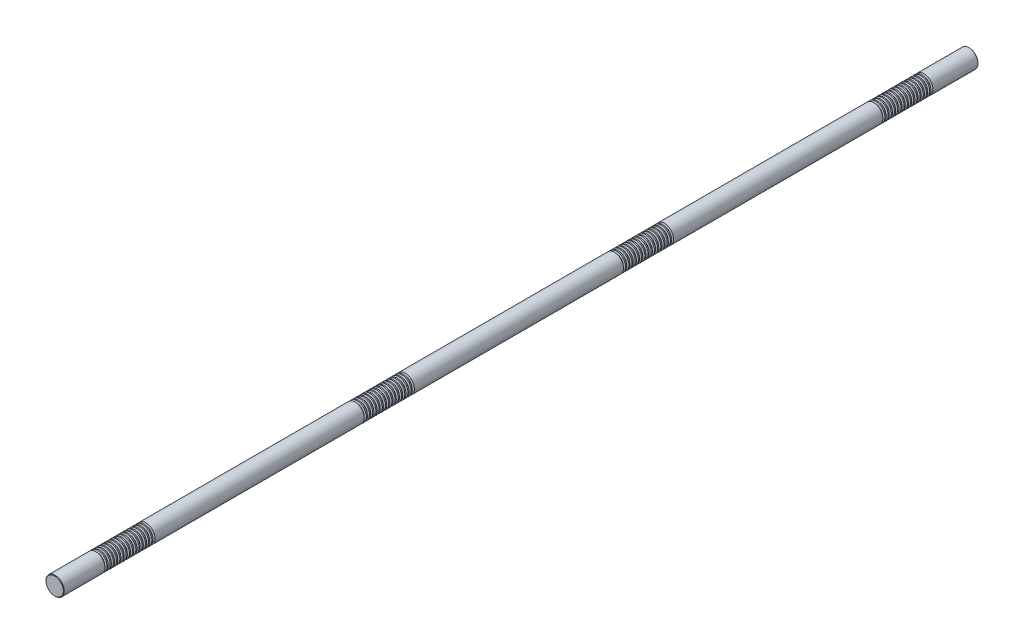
ISO-10303-21;
HEADER;
FILE_DESCRIPTION(('STEP AP214'),'2;1');
FILE_NAME('part.step','',(''),(''),'','','');
FILE_SCHEMA(('AUTOMOTIVE_DESIGN { 1 0 10303 214 1 1 1 1 }'));
ENDSEC;
DATA;
#1=APPLICATION_CONTEXT('core data for automotive mechanical design processes');
#2=APPLICATION_PROTOCOL_DEFINITION('international standard','automotive_design',2000,#1);
#3=PRODUCT_CONTEXT('',#1,'mechanical');
#4=PRODUCT('Part','Part','',(#3));
#5=PRODUCT_RELATED_PRODUCT_CATEGORY('part','',(#4));
#6=PRODUCT_DEFINITION_FORMATION('','',#4);
#7=PRODUCT_DEFINITION_CONTEXT('part definition',#1,'design');
#8=PRODUCT_DEFINITION('design','',#6,#7);
#9=PRODUCT_DEFINITION_SHAPE('','',#8);
#10=(LENGTH_UNIT() NAMED_UNIT(*) SI_UNIT(.MILLI.,.METRE.));
#11=(NAMED_UNIT(*) PLANE_ANGLE_UNIT() SI_UNIT($,.RADIAN.));
#12=(NAMED_UNIT(*) SI_UNIT($,.STERADIAN.) SOLID_ANGLE_UNIT());
#13=UNCERTAINTY_MEASURE_WITH_UNIT(LENGTH_MEASURE(1.E-05),#10,'distance_accuracy_value','');
#14=(GEOMETRIC_REPRESENTATION_CONTEXT(3) GLOBAL_UNCERTAINTY_ASSIGNED_CONTEXT((#13)) GLOBAL_UNIT_ASSIGNED_CONTEXT((#10,
#11,#12)) REPRESENTATION_CONTEXT('',''));
#15=CARTESIAN_POINT('',(0.,0.,0.));
#16=DIRECTION('',(0.,0.,1.));
#17=DIRECTION('',(1.,0.,0.));
#18=AXIS2_PLACEMENT_3D('',#15,#16,#17);
#19=CARTESIAN_POINT('',(0.,0.,1000.));
#20=DIRECTION('',(0.,0.,-1.));
#21=DIRECTION('',(-1.,0.,0.));
#22=AXIS2_PLACEMENT_3D('',#19,#20,#21);
#23=CYLINDRICAL_SURFACE('',#22,20.);
#24=CARTESIAN_POINT('',(0.,0.,903.035898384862));
#25=DIRECTION('',(0.,0.,1.));
#26=DIRECTION('',(1.,0.,0.));
#27=AXIS2_PLACEMENT_3D('',#24,#25,#26);
#28=CIRCLE('',#27,20.);
#29=CARTESIAN_POINT('',(20.,0.,903.035898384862));
#30=VERTEX_POINT('',#29);
#31=EDGE_CURVE('E1057',#30,#30,#28,.T.);
#32=ORIENTED_EDGE('',*,*,#31,.T.);
#33=EDGE_LOOP('',(#32));
#34=FACE_BOUND('',#33,.T.);
#35=CARTESIAN_POINT('',(0.,0.,905.464101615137));
#36=DIRECTION('',(0.,0.,1.));
#37=DIRECTION('',(1.,0.,0.));
#38=AXIS2_PLACEMENT_3D('',#35,#36,#37);
#39=CIRCLE('',#38,20.);
#40=CARTESIAN_POINT('',(20.,0.,905.464101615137));
#41=VERTEX_POINT('',#40);
#42=EDGE_CURVE('E1069',#41,#41,#39,.T.);
#43=ORIENTED_EDGE('',*,*,#42,.F.);
#44=EDGE_LOOP('',(#43));
#45=FACE_BOUND('',#44,.T.);
#46=ADVANCED_FACE('F37',(#34,#45),#23,.T.);
#47=CARTESIAN_POINT('',(0.,0.,896.035898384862));
#48=DIRECTION('',(0.,0.,1.));
#49=DIRECTION('',(1.,0.,0.));
#50=AXIS2_PLACEMENT_3D('',#47,#48,#49);
#51=CIRCLE('',#50,20.);
#52=CARTESIAN_POINT('',(20.,0.,896.035898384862));
#53=VERTEX_POINT('',#52);
#54=EDGE_CURVE('E1041',#53,#53,#51,.T.);
#55=ORIENTED_EDGE('',*,*,#54,.T.);
#56=EDGE_LOOP('',(#55));
#57=FACE_BOUND('',#56,.T.);
#58=CARTESIAN_POINT('',(0.,0.,898.464101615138));
#59=DIRECTION('',(0.,0.,1.));
#60=DIRECTION('',(1.,0.,0.));
#61=AXIS2_PLACEMENT_3D('',#58,#59,#60);
#62=CIRCLE('',#61,20.);
#63=CARTESIAN_POINT('',(20.,0.,898.464101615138));
#64=VERTEX_POINT('',#63);
#65=EDGE_CURVE('E1053',#64,#64,#62,.T.);
#66=ORIENTED_EDGE('',*,*,#65,.F.);
#67=EDGE_LOOP('',(#66));
#68=FACE_BOUND('',#67,.T.);
#69=ADVANCED_FACE('F1105',(#57,#68),#23,.T.);
#70=CARTESIAN_POINT('',(0.,0.,889.035898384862));
#71=DIRECTION('',(0.,0.,1.));
#72=DIRECTION('',(1.,0.,0.));
#73=AXIS2_PLACEMENT_3D('',#70,#71,#72);
#74=CIRCLE('',#73,20.);
#75=CARTESIAN_POINT('',(20.,0.,889.035898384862));
#76=VERTEX_POINT('',#75);
#77=EDGE_CURVE('E1026',#76,#76,#74,.T.);
#78=ORIENTED_EDGE('',*,*,#77,.T.);
#79=EDGE_LOOP('',(#78));
#80=FACE_BOUND('',#79,.T.);
#81=CARTESIAN_POINT('',(0.,0.,891.464101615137));
#82=DIRECTION('',(0.,0.,1.));
#83=DIRECTION('',(1.,0.,0.));
#84=AXIS2_PLACEMENT_3D('',#81,#82,#83);
#85=CIRCLE('',#84,20.);
#86=CARTESIAN_POINT('',(20.,0.,891.464101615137));
#87=VERTEX_POINT('',#86);
#88=EDGE_CURVE('E1037',#87,#87,#85,.T.);
#89=ORIENTED_EDGE('',*,*,#88,.F.);
#90=EDGE_LOOP('',(#89));
#91=FACE_BOUND('',#90,.T.);
#92=ADVANCED_FACE('F1113',(#80,#91),#23,.T.);
#93=CARTESIAN_POINT('',(0.,0.,882.035898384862));
#94=DIRECTION('',(0.,0.,1.));
#95=DIRECTION('',(1.,0.,0.));
#96=AXIS2_PLACEMENT_3D('',#93,#94,#95);
#97=CIRCLE('',#96,20.);
#98=CARTESIAN_POINT('',(20.,0.,882.035898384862));
#99=VERTEX_POINT('',#98);
#100=EDGE_CURVE('E1011',#99,#99,#97,.T.);
#101=ORIENTED_EDGE('',*,*,#100,.T.);
#102=EDGE_LOOP('',(#101));
#103=FACE_BOUND('',#102,.T.);
#104=CARTESIAN_POINT('',(0.,0.,884.464101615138));
#105=DIRECTION('',(0.,0.,1.));
#106=DIRECTION('',(1.,0.,0.));
#107=AXIS2_PLACEMENT_3D('',#104,#105,#106);
#108=CIRCLE('',#107,20.);
#109=CARTESIAN_POINT('',(20.,0.,884.464101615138));
#110=VERTEX_POINT('',#109);
#111=EDGE_CURVE('E1022',#110,#110,#108,.T.);
#112=ORIENTED_EDGE('',*,*,#111,.F.);
#113=EDGE_LOOP('',(#112));
#114=FACE_BOUND('',#113,.T.);
#115=ADVANCED_FACE('F2490',(#103,#114),#23,.T.);
#116=CARTESIAN_POINT('',(0.,0.,875.035898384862));
#117=DIRECTION('',(0.,0.,1.));
#118=DIRECTION('',(1.,0.,0.));
#119=AXIS2_PLACEMENT_3D('',#116,#117,#118);
#120=CIRCLE('',#119,20.);
#121=CARTESIAN_POINT('',(20.,0.,875.035898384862));
#122=VERTEX_POINT('',#121);
#123=EDGE_CURVE('E995',#122,#122,#120,.T.);
#124=ORIENTED_EDGE('',*,*,#123,.T.);
#125=EDGE_LOOP('',(#124));
#126=FACE_BOUND('',#125,.T.);
#127=CARTESIAN_POINT('',(0.,0.,877.464101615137));
#128=DIRECTION('',(0.,0.,1.));
#129=DIRECTION('',(1.,0.,0.));
#130=AXIS2_PLACEMENT_3D('',#127,#128,#129);
#131=CIRCLE('',#130,20.);
#132=CARTESIAN_POINT('',(20.,0.,877.464101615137));
#133=VERTEX_POINT('',#132);
#134=EDGE_CURVE('E1007',#133,#133,#131,.T.);
#135=ORIENTED_EDGE('',*,*,#134,.F.);
#136=EDGE_LOOP('',(#135));
#137=FACE_BOUND('',#136,.T.);
#138=ADVANCED_FACE('F2467',(#126,#137),#23,.T.);
#139=CARTESIAN_POINT('',(0.,0.,868.035898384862));
#140=DIRECTION('',(0.,0.,1.));
#141=DIRECTION('',(1.,0.,0.));
#142=AXIS2_PLACEMENT_3D('',#139,#140,#141);
#143=CIRCLE('',#142,20.);
#144=CARTESIAN_POINT('',(20.,0.,868.035898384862));
#145=VERTEX_POINT('',#144);
#146=EDGE_CURVE('E979',#145,#145,#143,.T.);
#147=ORIENTED_EDGE('',*,*,#146,.T.);
#148=EDGE_LOOP('',(#147));
#149=FACE_BOUND('',#148,.T.);
#150=CARTESIAN_POINT('',(0.,0.,870.464101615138));
#151=DIRECTION('',(0.,0.,1.));
#152=DIRECTION('',(1.,0.,0.));
#153=AXIS2_PLACEMENT_3D('',#150,#151,#152);
#154=CIRCLE('',#153,20.);
#155=CARTESIAN_POINT('',(20.,0.,870.464101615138));
#156=VERTEX_POINT('',#155);
#157=EDGE_CURVE('E991',#156,#156,#154,.T.);
#158=ORIENTED_EDGE('',*,*,#157,.F.);
#159=EDGE_LOOP('',(#158));
#160=FACE_BOUND('',#159,.T.);
#161=ADVANCED_FACE('F2444',(#149,#160),#23,.T.);
#162=CARTESIAN_POINT('',(0.,0.,861.035898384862));
#163=DIRECTION('',(0.,0.,1.));
#164=DIRECTION('',(1.,0.,0.));
#165=AXIS2_PLACEMENT_3D('',#162,#163,#164);
#166=CIRCLE('',#165,20.);
#167=CARTESIAN_POINT('',(20.,0.,861.035898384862));
#168=VERTEX_POINT('',#167);
#169=EDGE_CURVE('E963',#168,#168,#166,.T.);
#170=ORIENTED_EDGE('',*,*,#169,.T.);
#171=EDGE_LOOP('',(#170));
#172=FACE_BOUND('',#171,.T.);
#173=CARTESIAN_POINT('',(0.,0.,863.464101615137));
#174=DIRECTION('',(0.,0.,1.));
#175=DIRECTION('',(1.,0.,0.));
#176=AXIS2_PLACEMENT_3D('',#173,#174,#175);
#177=CIRCLE('',#176,20.);
#178=CARTESIAN_POINT('',(20.,0.,863.464101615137));
#179=VERTEX_POINT('',#178);
#180=EDGE_CURVE('E975',#179,#179,#177,.T.);
#181=ORIENTED_EDGE('',*,*,#180,.F.);
#182=EDGE_LOOP('',(#181));
#183=FACE_BOUND('',#182,.T.);
#184=ADVANCED_FACE('F2421',(#172,#183),#23,.T.);
#185=CARTESIAN_POINT('',(0.,0.,854.035898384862));
#186=DIRECTION('',(0.,0.,1.));
#187=DIRECTION('',(1.,0.,0.));
#188=AXIS2_PLACEMENT_3D('',#185,#186,#187);
#189=CIRCLE('',#188,20.);
#190=CARTESIAN_POINT('',(20.,0.,854.035898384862));
#191=VERTEX_POINT('',#190);
#192=EDGE_CURVE('E947',#191,#191,#189,.T.);
#193=ORIENTED_EDGE('',*,*,#192,.T.);
#194=EDGE_LOOP('',(#193));
#195=FACE_BOUND('',#194,.T.);
#196=CARTESIAN_POINT('',(0.,0.,856.464101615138));
#197=DIRECTION('',(0.,0.,1.));
#198=DIRECTION('',(1.,0.,0.));
#199=AXIS2_PLACEMENT_3D('',#196,#197,#198);
#200=CIRCLE('',#199,20.);
#201=CARTESIAN_POINT('',(20.,0.,856.464101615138));
#202=VERTEX_POINT('',#201);
#203=EDGE_CURVE('E959',#202,#202,#200,.T.);
#204=ORIENTED_EDGE('',*,*,#203,.F.);
#205=EDGE_LOOP('',(#204));
#206=FACE_BOUND('',#205,.T.);
#207=ADVANCED_FACE('F2398',(#195,#206),#23,.T.);
#208=CARTESIAN_POINT('',(0.,0.,847.035898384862));
#209=DIRECTION('',(0.,0.,1.));
#210=DIRECTION('',(1.,0.,0.));
#211=AXIS2_PLACEMENT_3D('',#208,#209,#210);
#212=CIRCLE('',#211,20.);
#213=CARTESIAN_POINT('',(20.,0.,847.035898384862));
#214=VERTEX_POINT('',#213);
#215=EDGE_CURVE('E931',#214,#214,#212,.T.);
#216=ORIENTED_EDGE('',*,*,#215,.T.);
#217=EDGE_LOOP('',(#216));
#218=FACE_BOUND('',#217,.T.);
#219=CARTESIAN_POINT('',(0.,0.,849.464101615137));
#220=DIRECTION('',(0.,0.,1.));
#221=DIRECTION('',(1.,0.,0.));
#222=AXIS2_PLACEMENT_3D('',#219,#220,#221);
#223=CIRCLE('',#222,20.);
#224=CARTESIAN_POINT('',(20.,0.,849.464101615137));
#225=VERTEX_POINT('',#224);
#226=EDGE_CURVE('E943',#225,#225,#223,.T.);
#227=ORIENTED_EDGE('',*,*,#226,.F.);
#228=EDGE_LOOP('',(#227));
#229=FACE_BOUND('',#228,.T.);
#230=ADVANCED_FACE('F2375',(#218,#229),#23,.T.);
#231=CARTESIAN_POINT('',(0.,0.,840.035898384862));
#232=DIRECTION('',(0.,0.,1.));
#233=DIRECTION('',(1.,0.,0.));
#234=AXIS2_PLACEMENT_3D('',#231,#232,#233);
#235=CIRCLE('',#234,20.);
#236=CARTESIAN_POINT('',(20.,0.,840.035898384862));
#237=VERTEX_POINT('',#236);
#238=EDGE_CURVE('E915',#237,#237,#235,.T.);
#239=ORIENTED_EDGE('',*,*,#238,.T.);
#240=EDGE_LOOP('',(#239));
#241=FACE_BOUND('',#240,.T.);
#242=CARTESIAN_POINT('',(0.,0.,842.464101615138));
#243=DIRECTION('',(0.,0.,1.));
#244=DIRECTION('',(1.,0.,0.));
#245=AXIS2_PLACEMENT_3D('',#242,#243,#244);
#246=CIRCLE('',#245,20.);
#247=CARTESIAN_POINT('',(20.,0.,842.464101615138));
#248=VERTEX_POINT('',#247);
#249=EDGE_CURVE('E927',#248,#248,#246,.T.);
#250=ORIENTED_EDGE('',*,*,#249,.F.);
#251=EDGE_LOOP('',(#250));
#252=FACE_BOUND('',#251,.T.);
#253=ADVANCED_FACE('F2352',(#241,#252),#23,.T.);
#254=CARTESIAN_POINT('',(0.,0.,833.035898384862));
#255=DIRECTION('',(0.,0.,1.));
#256=DIRECTION('',(1.,0.,0.));
#257=AXIS2_PLACEMENT_3D('',#254,#255,#256);
#258=CIRCLE('',#257,20.);
#259=CARTESIAN_POINT('',(20.,0.,833.035898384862));
#260=VERTEX_POINT('',#259);
#261=EDGE_CURVE('E899',#260,#260,#258,.T.);
#262=ORIENTED_EDGE('',*,*,#261,.T.);
#263=EDGE_LOOP('',(#262));
#264=FACE_BOUND('',#263,.T.);
#265=CARTESIAN_POINT('',(0.,0.,835.464101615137));
#266=DIRECTION('',(0.,0.,1.));
#267=DIRECTION('',(1.,0.,0.));
#268=AXIS2_PLACEMENT_3D('',#265,#266,#267);
#269=CIRCLE('',#268,20.);
#270=CARTESIAN_POINT('',(20.,0.,835.464101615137));
#271=VERTEX_POINT('',#270);
#272=EDGE_CURVE('E911',#271,#271,#269,.T.);
#273=ORIENTED_EDGE('',*,*,#272,.F.);
#274=EDGE_LOOP('',(#273));
#275=FACE_BOUND('',#274,.T.);
#276=ADVANCED_FACE('F2329',(#264,#275),#23,.T.);
#277=CARTESIAN_POINT('',(0.,0.,826.035898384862));
#278=DIRECTION('',(0.,0.,1.));
#279=DIRECTION('',(1.,0.,0.));
#280=AXIS2_PLACEMENT_3D('',#277,#278,#279);
#281=CIRCLE('',#280,20.);
#282=CARTESIAN_POINT('',(20.,0.,826.035898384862));
#283=VERTEX_POINT('',#282);
#284=EDGE_CURVE('E883',#283,#283,#281,.T.);
#285=ORIENTED_EDGE('',*,*,#284,.T.);
#286=EDGE_LOOP('',(#285));
#287=FACE_BOUND('',#286,.T.);
#288=CARTESIAN_POINT('',(0.,0.,828.464101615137));
#289=DIRECTION('',(0.,0.,1.));
#290=DIRECTION('',(1.,0.,0.));
#291=AXIS2_PLACEMENT_3D('',#288,#289,#290);
#292=CIRCLE('',#291,20.);
#293=CARTESIAN_POINT('',(20.,0.,828.464101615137));
#294=VERTEX_POINT('',#293);
#295=EDGE_CURVE('E895',#294,#294,#292,.T.);
#296=ORIENTED_EDGE('',*,*,#295,.F.);
#297=EDGE_LOOP('',(#296));
#298=FACE_BOUND('',#297,.T.);
#299=ADVANCED_FACE('F2306',(#287,#298),#23,.T.);
#300=CARTESIAN_POINT('',(0.,0.,819.035898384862));
#301=DIRECTION('',(0.,0.,1.));
#302=DIRECTION('',(1.,0.,0.));
#303=AXIS2_PLACEMENT_3D('',#300,#301,#302);
#304=CIRCLE('',#303,20.);
#305=CARTESIAN_POINT('',(20.,0.,819.035898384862));
#306=VERTEX_POINT('',#305);
#307=EDGE_CURVE('E867',#306,#306,#304,.T.);
#308=ORIENTED_EDGE('',*,*,#307,.T.);
#309=EDGE_LOOP('',(#308));
#310=FACE_BOUND('',#309,.T.);
#311=CARTESIAN_POINT('',(0.,0.,821.464101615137));
#312=DIRECTION('',(0.,0.,1.));
#313=DIRECTION('',(1.,0.,0.));
#314=AXIS2_PLACEMENT_3D('',#311,#312,#313);
#315=CIRCLE('',#314,20.);
#316=CARTESIAN_POINT('',(20.,0.,821.464101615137));
#317=VERTEX_POINT('',#316);
#318=EDGE_CURVE('E879',#317,#317,#315,.T.);
#319=ORIENTED_EDGE('',*,*,#318,.F.);
#320=EDGE_LOOP('',(#319));
#321=FACE_BOUND('',#320,.T.);
#322=ADVANCED_FACE('F2283',(#310,#321),#23,.T.);
#323=CARTESIAN_POINT('',(0.,0.,812.035898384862));
#324=DIRECTION('',(0.,0.,1.));
#325=DIRECTION('',(1.,0.,0.));
#326=AXIS2_PLACEMENT_3D('',#323,#324,#325);
#327=CIRCLE('',#326,20.);
#328=CARTESIAN_POINT('',(20.,0.,812.035898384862));
#329=VERTEX_POINT('',#328);
#330=EDGE_CURVE('E851',#329,#329,#327,.T.);
#331=ORIENTED_EDGE('',*,*,#330,.T.);
#332=EDGE_LOOP('',(#331));
#333=FACE_BOUND('',#332,.T.);
#334=CARTESIAN_POINT('',(0.,0.,814.464101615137));
#335=DIRECTION('',(0.,0.,1.));
#336=DIRECTION('',(1.,0.,0.));
#337=AXIS2_PLACEMENT_3D('',#334,#335,#336);
#338=CIRCLE('',#337,20.);
#339=CARTESIAN_POINT('',(20.,0.,814.464101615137));
#340=VERTEX_POINT('',#339);
#341=EDGE_CURVE('E863',#340,#340,#338,.T.);
#342=ORIENTED_EDGE('',*,*,#341,.F.);
#343=EDGE_LOOP('',(#342));
#344=FACE_BOUND('',#343,.T.);
#345=ADVANCED_FACE('F2264',(#333,#344),#23,.T.);
#346=CARTESIAN_POINT('',(0.,0.,805.035898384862));
#347=DIRECTION('',(0.,0.,1.));
#348=DIRECTION('',(1.,0.,0.));
#349=AXIS2_PLACEMENT_3D('',#346,#347,#348);
#350=CIRCLE('',#349,20.);
#351=CARTESIAN_POINT('',(20.,0.,805.035898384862));
#352=VERTEX_POINT('',#351);
#353=EDGE_CURVE('E355',#352,#352,#350,.T.);
#354=ORIENTED_EDGE('',*,*,#353,.T.);
#355=EDGE_LOOP('',(#354));
#356=FACE_BOUND('',#355,.T.);
#357=CARTESIAN_POINT('',(0.,0.,807.464101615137));
#358=DIRECTION('',(0.,0.,1.));
#359=DIRECTION('',(1.,0.,0.));
#360=AXIS2_PLACEMENT_3D('',#357,#358,#359);
#361=CIRCLE('',#360,20.);
#362=CARTESIAN_POINT('',(20.,0.,807.464101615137));
#363=VERTEX_POINT('',#362);
#364=EDGE_CURVE('E847',#363,#363,#361,.T.);
#365=ORIENTED_EDGE('',*,*,#364,.F.);
#366=EDGE_LOOP('',(#365));
#367=FACE_BOUND('',#366,.T.);
#368=ADVANCED_FACE('F2213',(#356,#367),#23,.T.);
#369=CARTESIAN_POINT('',(0.,0.,336.035898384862));
#370=DIRECTION('',(0.,0.,1.));
#371=DIRECTION('',(1.,0.,0.));
#372=AXIS2_PLACEMENT_3D('',#369,#370,#371);
#373=CIRCLE('',#372,20.);
#374=CARTESIAN_POINT('',(20.,0.,336.035898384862));
#375=VERTEX_POINT('',#374);
#376=EDGE_CURVE('E819',#375,#375,#373,.T.);
#377=ORIENTED_EDGE('',*,*,#376,.T.);
#378=EDGE_LOOP('',(#377));
#379=FACE_BOUND('',#378,.T.);
#380=CARTESIAN_POINT('',(0.,0.,338.464101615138));
#381=DIRECTION('',(0.,0.,1.));
#382=DIRECTION('',(1.,0.,0.));
#383=AXIS2_PLACEMENT_3D('',#380,#381,#382);
#384=CIRCLE('',#383,20.);
#385=CARTESIAN_POINT('',(20.,0.,338.464101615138));
#386=VERTEX_POINT('',#385);
#387=EDGE_CURVE('E831',#386,#386,#384,.T.);
#388=ORIENTED_EDGE('',*,*,#387,.F.);
#389=EDGE_LOOP('',(#388));
#390=FACE_BOUND('',#389,.T.);
#391=ADVANCED_FACE('F2189',(#379,#390),#23,.T.);
#392=CARTESIAN_POINT('',(0.,0.,329.035898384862));
#393=DIRECTION('',(0.,0.,1.));
#394=DIRECTION('',(1.,0.,0.));
#395=AXIS2_PLACEMENT_3D('',#392,#393,#394);
#396=CIRCLE('',#395,20.);
#397=CARTESIAN_POINT('',(20.,0.,329.035898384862));
#398=VERTEX_POINT('',#397);
#399=EDGE_CURVE('E803',#398,#398,#396,.T.);
#400=ORIENTED_EDGE('',*,*,#399,.T.);
#401=EDGE_LOOP('',(#400));
#402=FACE_BOUND('',#401,.T.);
#403=CARTESIAN_POINT('',(0.,0.,331.464101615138));
#404=DIRECTION('',(0.,0.,1.));
#405=DIRECTION('',(1.,0.,0.));
#406=AXIS2_PLACEMENT_3D('',#403,#404,#405);
#407=CIRCLE('',#406,20.);
#408=CARTESIAN_POINT('',(20.,0.,331.464101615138));
#409=VERTEX_POINT('',#408);
#410=EDGE_CURVE('E815',#409,#409,#407,.T.);
#411=ORIENTED_EDGE('',*,*,#410,.F.);
#412=EDGE_LOOP('',(#411));
#413=FACE_BOUND('',#412,.T.);
#414=ADVANCED_FACE('F2166',(#402,#413),#23,.T.);
#415=CARTESIAN_POINT('',(0.,0.,322.035898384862));
#416=DIRECTION('',(0.,0.,1.));
#417=DIRECTION('',(1.,0.,0.));
#418=AXIS2_PLACEMENT_3D('',#415,#416,#417);
#419=CIRCLE('',#418,20.);
#420=CARTESIAN_POINT('',(20.,0.,322.035898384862));
#421=VERTEX_POINT('',#420);
#422=EDGE_CURVE('E787',#421,#421,#419,.T.);
#423=ORIENTED_EDGE('',*,*,#422,.T.);
#424=EDGE_LOOP('',(#423));
#425=FACE_BOUND('',#424,.T.);
#426=CARTESIAN_POINT('',(0.,0.,324.464101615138));
#427=DIRECTION('',(0.,0.,1.));
#428=DIRECTION('',(1.,0.,0.));
#429=AXIS2_PLACEMENT_3D('',#426,#427,#428);
#430=CIRCLE('',#429,20.);
#431=CARTESIAN_POINT('',(20.,0.,324.464101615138));
#432=VERTEX_POINT('',#431);
#433=EDGE_CURVE('E799',#432,#432,#430,.T.);
#434=ORIENTED_EDGE('',*,*,#433,.F.);
#435=EDGE_LOOP('',(#434));
#436=FACE_BOUND('',#435,.T.);
#437=ADVANCED_FACE('F2143',(#425,#436),#23,.T.);
#438=CARTESIAN_POINT('',(0.,0.,315.035898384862));
#439=DIRECTION('',(0.,0.,1.));
#440=DIRECTION('',(1.,0.,0.));
#441=AXIS2_PLACEMENT_3D('',#438,#439,#440);
#442=CIRCLE('',#441,20.);
#443=CARTESIAN_POINT('',(20.,0.,315.035898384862));
#444=VERTEX_POINT('',#443);
#445=EDGE_CURVE('E771',#444,#444,#442,.T.);
#446=ORIENTED_EDGE('',*,*,#445,.T.);
#447=EDGE_LOOP('',(#446));
#448=FACE_BOUND('',#447,.T.);
#449=CARTESIAN_POINT('',(0.,0.,317.464101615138));
#450=DIRECTION('',(0.,0.,1.));
#451=DIRECTION('',(1.,0.,0.));
#452=AXIS2_PLACEMENT_3D('',#449,#450,#451);
#453=CIRCLE('',#452,20.);
#454=CARTESIAN_POINT('',(20.,0.,317.464101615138));
#455=VERTEX_POINT('',#454);
#456=EDGE_CURVE('E783',#455,#455,#453,.T.);
#457=ORIENTED_EDGE('',*,*,#456,.F.);
#458=EDGE_LOOP('',(#457));
#459=FACE_BOUND('',#458,.T.);
#460=ADVANCED_FACE('F2120',(#448,#459),#23,.T.);
#461=CARTESIAN_POINT('',(0.,0.,308.035898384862));
#462=DIRECTION('',(0.,0.,1.));
#463=DIRECTION('',(1.,0.,0.));
#464=AXIS2_PLACEMENT_3D('',#461,#462,#463);
#465=CIRCLE('',#464,20.);
#466=CARTESIAN_POINT('',(20.,0.,308.035898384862));
#467=VERTEX_POINT('',#466);
#468=EDGE_CURVE('E755',#467,#467,#465,.T.);
#469=ORIENTED_EDGE('',*,*,#468,.T.);
#470=EDGE_LOOP('',(#469));
#471=FACE_BOUND('',#470,.T.);
#472=CARTESIAN_POINT('',(0.,0.,310.464101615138));
#473=DIRECTION('',(0.,0.,1.));
#474=DIRECTION('',(1.,0.,0.));
#475=AXIS2_PLACEMENT_3D('',#472,#473,#474);
#476=CIRCLE('',#475,20.);
#477=CARTESIAN_POINT('',(20.,0.,310.464101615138));
#478=VERTEX_POINT('',#477);
#479=EDGE_CURVE('E767',#478,#478,#476,.T.);
#480=ORIENTED_EDGE('',*,*,#479,.F.);
#481=EDGE_LOOP('',(#480));
#482=FACE_BOUND('',#481,.T.);
#483=ADVANCED_FACE('F2097',(#471,#482),#23,.T.);
#484=CARTESIAN_POINT('',(0.,0.,301.035898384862));
#485=DIRECTION('',(0.,0.,1.));
#486=DIRECTION('',(1.,0.,0.));
#487=AXIS2_PLACEMENT_3D('',#484,#485,#486);
#488=CIRCLE('',#487,20.);
#489=CARTESIAN_POINT('',(20.,0.,301.035898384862));
#490=VERTEX_POINT('',#489);
#491=EDGE_CURVE('E739',#490,#490,#488,.T.);
#492=ORIENTED_EDGE('',*,*,#491,.T.);
#493=EDGE_LOOP('',(#492));
#494=FACE_BOUND('',#493,.T.);
#495=CARTESIAN_POINT('',(0.,0.,303.464101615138));
#496=DIRECTION('',(0.,0.,1.));
#497=DIRECTION('',(1.,0.,0.));
#498=AXIS2_PLACEMENT_3D('',#495,#496,#497);
#499=CIRCLE('',#498,20.);
#500=CARTESIAN_POINT('',(20.,0.,303.464101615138));
#501=VERTEX_POINT('',#500);
#502=EDGE_CURVE('E751',#501,#501,#499,.T.);
#503=ORIENTED_EDGE('',*,*,#502,.F.);
#504=EDGE_LOOP('',(#503));
#505=FACE_BOUND('',#504,.T.);
#506=ADVANCED_FACE('F2074',(#494,#505),#23,.T.);
#507=CARTESIAN_POINT('',(0.,0.,294.035898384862));
#508=DIRECTION('',(0.,0.,1.));
#509=DIRECTION('',(1.,0.,0.));
#510=AXIS2_PLACEMENT_3D('',#507,#508,#509);
#511=CIRCLE('',#510,20.);
#512=CARTESIAN_POINT('',(20.,0.,294.035898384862));
#513=VERTEX_POINT('',#512);
#514=EDGE_CURVE('E723',#513,#513,#511,.T.);
#515=ORIENTED_EDGE('',*,*,#514,.T.);
#516=EDGE_LOOP('',(#515));
#517=FACE_BOUND('',#516,.T.);
#518=CARTESIAN_POINT('',(0.,0.,296.464101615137));
#519=DIRECTION('',(0.,0.,1.));
#520=DIRECTION('',(1.,0.,0.));
#521=AXIS2_PLACEMENT_3D('',#518,#519,#520);
#522=CIRCLE('',#521,20.);
#523=CARTESIAN_POINT('',(20.,0.,296.464101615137));
#524=VERTEX_POINT('',#523);
#525=EDGE_CURVE('E735',#524,#524,#522,.T.);
#526=ORIENTED_EDGE('',*,*,#525,.F.);
#527=EDGE_LOOP('',(#526));
#528=FACE_BOUND('',#527,.T.);
#529=ADVANCED_FACE('F2051',(#517,#528),#23,.T.);
#530=CARTESIAN_POINT('',(0.,0.,287.035898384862));
#531=DIRECTION('',(0.,0.,1.));
#532=DIRECTION('',(1.,0.,0.));
#533=AXIS2_PLACEMENT_3D('',#530,#531,#532);
#534=CIRCLE('',#533,20.);
#535=CARTESIAN_POINT('',(20.,0.,287.035898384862));
#536=VERTEX_POINT('',#535);
#537=EDGE_CURVE('E707',#536,#536,#534,.T.);
#538=ORIENTED_EDGE('',*,*,#537,.T.);
#539=EDGE_LOOP('',(#538));
#540=FACE_BOUND('',#539,.T.);
#541=CARTESIAN_POINT('',(0.,0.,289.464101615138));
#542=DIRECTION('',(0.,0.,1.));
#543=DIRECTION('',(1.,0.,0.));
#544=AXIS2_PLACEMENT_3D('',#541,#542,#543);
#545=CIRCLE('',#544,20.);
#546=CARTESIAN_POINT('',(20.,0.,289.464101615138));
#547=VERTEX_POINT('',#546);
#548=EDGE_CURVE('E719',#547,#547,#545,.T.);
#549=ORIENTED_EDGE('',*,*,#548,.F.);
#550=EDGE_LOOP('',(#549));
#551=FACE_BOUND('',#550,.T.);
#552=ADVANCED_FACE('F2028',(#540,#551),#23,.T.);
#553=CARTESIAN_POINT('',(0.,0.,280.035898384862));
#554=DIRECTION('',(0.,0.,1.));
#555=DIRECTION('',(1.,0.,0.));
#556=AXIS2_PLACEMENT_3D('',#553,#554,#555);
#557=CIRCLE('',#556,20.);
#558=CARTESIAN_POINT('',(20.,0.,280.035898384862));
#559=VERTEX_POINT('',#558);
#560=EDGE_CURVE('E691',#559,#559,#557,.T.);
#561=ORIENTED_EDGE('',*,*,#560,.T.);
#562=EDGE_LOOP('',(#561));
#563=FACE_BOUND('',#562,.T.);
#564=CARTESIAN_POINT('',(0.,0.,282.464101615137));
#565=DIRECTION('',(0.,0.,1.));
#566=DIRECTION('',(1.,0.,0.));
#567=AXIS2_PLACEMENT_3D('',#564,#565,#566);
#568=CIRCLE('',#567,20.);
#569=CARTESIAN_POINT('',(20.,0.,282.464101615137));
#570=VERTEX_POINT('',#569);
#571=EDGE_CURVE('E703',#570,#570,#568,.T.);
#572=ORIENTED_EDGE('',*,*,#571,.F.);
#573=EDGE_LOOP('',(#572));
#574=FACE_BOUND('',#573,.T.);
#575=ADVANCED_FACE('F2005',(#563,#574),#23,.T.);
#576=CARTESIAN_POINT('',(0.,0.,273.035898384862));
#577=DIRECTION('',(0.,0.,1.));
#578=DIRECTION('',(1.,0.,0.));
#579=AXIS2_PLACEMENT_3D('',#576,#577,#578);
#580=CIRCLE('',#579,20.);
#581=CARTESIAN_POINT('',(20.,0.,273.035898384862));
#582=VERTEX_POINT('',#581);
#583=EDGE_CURVE('E675',#582,#582,#580,.T.);
#584=ORIENTED_EDGE('',*,*,#583,.T.);
#585=EDGE_LOOP('',(#584));
#586=FACE_BOUND('',#585,.T.);
#587=CARTESIAN_POINT('',(0.,0.,275.464101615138));
#588=DIRECTION('',(0.,0.,1.));
#589=DIRECTION('',(1.,0.,0.));
#590=AXIS2_PLACEMENT_3D('',#587,#588,#589);
#591=CIRCLE('',#590,20.);
#592=CARTESIAN_POINT('',(20.,0.,275.464101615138));
#593=VERTEX_POINT('',#592);
#594=EDGE_CURVE('E687',#593,#593,#591,.T.);
#595=ORIENTED_EDGE('',*,*,#594,.F.);
#596=EDGE_LOOP('',(#595));
#597=FACE_BOUND('',#596,.T.);
#598=ADVANCED_FACE('F1982',(#586,#597),#23,.T.);
#599=CARTESIAN_POINT('',(0.,0.,266.035898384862));
#600=DIRECTION('',(0.,0.,1.));
#601=DIRECTION('',(1.,0.,0.));
#602=AXIS2_PLACEMENT_3D('',#599,#600,#601);
#603=CIRCLE('',#602,20.);
#604=CARTESIAN_POINT('',(20.,0.,266.035898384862));
#605=VERTEX_POINT('',#604);
#606=EDGE_CURVE('E659',#605,#605,#603,.T.);
#607=ORIENTED_EDGE('',*,*,#606,.T.);
#608=EDGE_LOOP('',(#607));
#609=FACE_BOUND('',#608,.T.);
#610=CARTESIAN_POINT('',(0.,0.,268.464101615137));
#611=DIRECTION('',(0.,0.,1.));
#612=DIRECTION('',(1.,0.,0.));
#613=AXIS2_PLACEMENT_3D('',#610,#611,#612);
#614=CIRCLE('',#613,20.);
#615=CARTESIAN_POINT('',(20.,0.,268.464101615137));
#616=VERTEX_POINT('',#615);
#617=EDGE_CURVE('E671',#616,#616,#614,.T.);
#618=ORIENTED_EDGE('',*,*,#617,.F.);
#619=EDGE_LOOP('',(#618));
#620=FACE_BOUND('',#619,.T.);
#621=ADVANCED_FACE('F1959',(#609,#620),#23,.T.);
#622=CARTESIAN_POINT('',(0.,0.,259.035898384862));
#623=DIRECTION('',(0.,0.,1.));
#624=DIRECTION('',(1.,0.,0.));
#625=AXIS2_PLACEMENT_3D('',#622,#623,#624);
#626=CIRCLE('',#625,20.);
#627=CARTESIAN_POINT('',(20.,0.,259.035898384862));
#628=VERTEX_POINT('',#627);
#629=EDGE_CURVE('E643',#628,#628,#626,.T.);
#630=ORIENTED_EDGE('',*,*,#629,.T.);
#631=EDGE_LOOP('',(#630));
#632=FACE_BOUND('',#631,.T.);
#633=CARTESIAN_POINT('',(0.,0.,261.464101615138));
#634=DIRECTION('',(0.,0.,1.));
#635=DIRECTION('',(1.,0.,0.));
#636=AXIS2_PLACEMENT_3D('',#633,#634,#635);
#637=CIRCLE('',#636,20.);
#638=CARTESIAN_POINT('',(20.,0.,261.464101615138));
#639=VERTEX_POINT('',#638);
#640=EDGE_CURVE('E655',#639,#639,#637,.T.);
#641=ORIENTED_EDGE('',*,*,#640,.F.);
#642=EDGE_LOOP('',(#641));
#643=FACE_BOUND('',#642,.T.);
#644=ADVANCED_FACE('F1936',(#632,#643),#23,.T.);
#645=CARTESIAN_POINT('',(0.,0.,252.035898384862));
#646=DIRECTION('',(0.,0.,1.));
#647=DIRECTION('',(1.,0.,0.));
#648=AXIS2_PLACEMENT_3D('',#645,#646,#647);
#649=CIRCLE('',#648,20.);
#650=CARTESIAN_POINT('',(20.,0.,252.035898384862));
#651=VERTEX_POINT('',#650);
#652=EDGE_CURVE('E627',#651,#651,#649,.T.);
#653=ORIENTED_EDGE('',*,*,#652,.T.);
#654=EDGE_LOOP('',(#653));
#655=FACE_BOUND('',#654,.T.);
#656=CARTESIAN_POINT('',(0.,0.,254.464101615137));
#657=DIRECTION('',(0.,0.,1.));
#658=DIRECTION('',(1.,0.,0.));
#659=AXIS2_PLACEMENT_3D('',#656,#657,#658);
#660=CIRCLE('',#659,20.);
#661=CARTESIAN_POINT('',(20.,0.,254.464101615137));
#662=VERTEX_POINT('',#661);
#663=EDGE_CURVE('E639',#662,#662,#660,.T.);
#664=ORIENTED_EDGE('',*,*,#663,.F.);
#665=EDGE_LOOP('',(#664));
#666=FACE_BOUND('',#665,.T.);
#667=ADVANCED_FACE('F1913',(#655,#666),#23,.T.);
#668=CARTESIAN_POINT('',(0.,0.,245.035898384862));
#669=DIRECTION('',(0.,0.,1.));
#670=DIRECTION('',(1.,0.,0.));
#671=AXIS2_PLACEMENT_3D('',#668,#669,#670);
#672=CIRCLE('',#671,20.);
#673=CARTESIAN_POINT('',(20.,0.,245.035898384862));
#674=VERTEX_POINT('',#673);
#675=EDGE_CURVE('E611',#674,#674,#672,.T.);
#676=ORIENTED_EDGE('',*,*,#675,.T.);
#677=EDGE_LOOP('',(#676));
#678=FACE_BOUND('',#677,.T.);
#679=CARTESIAN_POINT('',(0.,0.,247.464101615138));
#680=DIRECTION('',(0.,0.,1.));
#681=DIRECTION('',(1.,0.,0.));
#682=AXIS2_PLACEMENT_3D('',#679,#680,#681);
#683=CIRCLE('',#682,20.);
#684=CARTESIAN_POINT('',(20.,0.,247.464101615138));
#685=VERTEX_POINT('',#684);
#686=EDGE_CURVE('E623',#685,#685,#683,.T.);
#687=ORIENTED_EDGE('',*,*,#686,.F.);
#688=EDGE_LOOP('',(#687));
#689=FACE_BOUND('',#688,.T.);
#690=ADVANCED_FACE('F1894',(#678,#689),#23,.T.);
#691=CARTESIAN_POINT('',(0.,0.,238.035898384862));
#692=DIRECTION('',(0.,0.,1.));
#693=DIRECTION('',(1.,0.,0.));
#694=AXIS2_PLACEMENT_3D('',#691,#692,#693);
#695=CIRCLE('',#694,20.);
#696=CARTESIAN_POINT('',(20.,0.,238.035898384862));
#697=VERTEX_POINT('',#696);
#698=EDGE_CURVE('E339',#697,#697,#695,.T.);
#699=ORIENTED_EDGE('',*,*,#698,.T.);
#700=EDGE_LOOP('',(#699));
#701=FACE_BOUND('',#700,.T.);
#702=CARTESIAN_POINT('',(0.,0.,240.464101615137));
#703=DIRECTION('',(0.,0.,1.));
#704=DIRECTION('',(1.,0.,0.));
#705=AXIS2_PLACEMENT_3D('',#702,#703,#704);
#706=CIRCLE('',#705,20.);
#707=CARTESIAN_POINT('',(20.,0.,240.464101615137));
#708=VERTEX_POINT('',#707);
#709=EDGE_CURVE('E607',#708,#708,#706,.T.);
#710=ORIENTED_EDGE('',*,*,#709,.F.);
#711=EDGE_LOOP('',(#710));
#712=FACE_BOUND('',#711,.T.);
#713=ADVANCED_FACE('F1843',(#701,#712),#23,.T.);
#714=CARTESIAN_POINT('',(0.,0.,-230.964101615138));
#715=DIRECTION('',(0.,0.,1.));
#716=DIRECTION('',(1.,0.,0.));
#717=AXIS2_PLACEMENT_3D('',#714,#715,#716);
#718=CIRCLE('',#717,20.);
#719=CARTESIAN_POINT('',(20.,0.,-230.964101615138));
#720=VERTEX_POINT('',#719);
#721=EDGE_CURVE('E579',#720,#720,#718,.T.);
#722=ORIENTED_EDGE('',*,*,#721,.T.);
#723=EDGE_LOOP('',(#722));
#724=FACE_BOUND('',#723,.T.);
#725=CARTESIAN_POINT('',(0.,0.,-228.535898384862));
#726=DIRECTION('',(0.,0.,1.));
#727=DIRECTION('',(1.,0.,0.));
#728=AXIS2_PLACEMENT_3D('',#725,#726,#727);
#729=CIRCLE('',#728,20.);
#730=CARTESIAN_POINT('',(20.,0.,-228.535898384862));
#731=VERTEX_POINT('',#730);
#732=EDGE_CURVE('E591',#731,#731,#729,.T.);
#733=ORIENTED_EDGE('',*,*,#732,.F.);
#734=EDGE_LOOP('',(#733));
#735=FACE_BOUND('',#734,.T.);
#736=ADVANCED_FACE('F1819',(#724,#735),#23,.T.);
#737=CARTESIAN_POINT('',(0.,0.,-237.964101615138));
#738=DIRECTION('',(0.,0.,1.));
#739=DIRECTION('',(1.,0.,0.));
#740=AXIS2_PLACEMENT_3D('',#737,#738,#739);
#741=CIRCLE('',#740,20.);
#742=CARTESIAN_POINT('',(20.,0.,-237.964101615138));
#743=VERTEX_POINT('',#742);
#744=EDGE_CURVE('E563',#743,#743,#741,.T.);
#745=ORIENTED_EDGE('',*,*,#744,.T.);
#746=EDGE_LOOP('',(#745));
#747=FACE_BOUND('',#746,.T.);
#748=CARTESIAN_POINT('',(0.,0.,-235.535898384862));
#749=DIRECTION('',(0.,0.,1.));
#750=DIRECTION('',(1.,0.,0.));
#751=AXIS2_PLACEMENT_3D('',#748,#749,#750);
#752=CIRCLE('',#751,20.);
#753=CARTESIAN_POINT('',(20.,0.,-235.535898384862));
#754=VERTEX_POINT('',#753);
#755=EDGE_CURVE('E575',#754,#754,#752,.T.);
#756=ORIENTED_EDGE('',*,*,#755,.F.);
#757=EDGE_LOOP('',(#756));
#758=FACE_BOUND('',#757,.T.);
#759=ADVANCED_FACE('F1796',(#747,#758),#23,.T.);
#760=CARTESIAN_POINT('',(0.,0.,-244.964101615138));
#761=DIRECTION('',(0.,0.,1.));
#762=DIRECTION('',(1.,0.,0.));
#763=AXIS2_PLACEMENT_3D('',#760,#761,#762);
#764=CIRCLE('',#763,20.);
#765=CARTESIAN_POINT('',(20.,0.,-244.964101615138));
#766=VERTEX_POINT('',#765);
#767=EDGE_CURVE('E547',#766,#766,#764,.T.);
#768=ORIENTED_EDGE('',*,*,#767,.T.);
#769=EDGE_LOOP('',(#768));
#770=FACE_BOUND('',#769,.T.);
#771=CARTESIAN_POINT('',(0.,0.,-242.535898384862));
#772=DIRECTION('',(0.,0.,1.));
#773=DIRECTION('',(1.,0.,0.));
#774=AXIS2_PLACEMENT_3D('',#771,#772,#773);
#775=CIRCLE('',#774,20.);
#776=CARTESIAN_POINT('',(20.,0.,-242.535898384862));
#777=VERTEX_POINT('',#776);
#778=EDGE_CURVE('E559',#777,#777,#775,.T.);
#779=ORIENTED_EDGE('',*,*,#778,.F.);
#780=EDGE_LOOP('',(#779));
#781=FACE_BOUND('',#780,.T.);
#782=ADVANCED_FACE('F1773',(#770,#781),#23,.T.);
#783=CARTESIAN_POINT('',(0.,0.,-251.964101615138));
#784=DIRECTION('',(0.,0.,1.));
#785=DIRECTION('',(1.,0.,0.));
#786=AXIS2_PLACEMENT_3D('',#783,#784,#785);
#787=CIRCLE('',#786,20.);
#788=CARTESIAN_POINT('',(20.,0.,-251.964101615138));
#789=VERTEX_POINT('',#788);
#790=EDGE_CURVE('E531',#789,#789,#787,.T.);
#791=ORIENTED_EDGE('',*,*,#790,.T.);
#792=EDGE_LOOP('',(#791));
#793=FACE_BOUND('',#792,.T.);
#794=CARTESIAN_POINT('',(0.,0.,-249.535898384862));
#795=DIRECTION('',(0.,0.,1.));
#796=DIRECTION('',(1.,0.,0.));
#797=AXIS2_PLACEMENT_3D('',#794,#795,#796);
#798=CIRCLE('',#797,20.);
#799=CARTESIAN_POINT('',(20.,0.,-249.535898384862));
#800=VERTEX_POINT('',#799);
#801=EDGE_CURVE('E543',#800,#800,#798,.T.);
#802=ORIENTED_EDGE('',*,*,#801,.F.);
#803=EDGE_LOOP('',(#802));
#804=FACE_BOUND('',#803,.T.);
#805=ADVANCED_FACE('F1750',(#793,#804),#23,.T.);
#806=CARTESIAN_POINT('',(0.,0.,-258.964101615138));
#807=DIRECTION('',(0.,0.,1.));
#808=DIRECTION('',(1.,0.,0.));
#809=AXIS2_PLACEMENT_3D('',#806,#807,#808);
#810=CIRCLE('',#809,20.);
#811=CARTESIAN_POINT('',(20.,0.,-258.964101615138));
#812=VERTEX_POINT('',#811);
#813=EDGE_CURVE('E515',#812,#812,#810,.T.);
#814=ORIENTED_EDGE('',*,*,#813,.T.);
#815=EDGE_LOOP('',(#814));
#816=FACE_BOUND('',#815,.T.);
#817=CARTESIAN_POINT('',(0.,0.,-256.535898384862));
#818=DIRECTION('',(0.,0.,1.));
#819=DIRECTION('',(1.,0.,0.));
#820=AXIS2_PLACEMENT_3D('',#817,#818,#819);
#821=CIRCLE('',#820,20.);
#822=CARTESIAN_POINT('',(20.,0.,-256.535898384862));
#823=VERTEX_POINT('',#822);
#824=EDGE_CURVE('E527',#823,#823,#821,.T.);
#825=ORIENTED_EDGE('',*,*,#824,.F.);
#826=EDGE_LOOP('',(#825));
#827=FACE_BOUND('',#826,.T.);
#828=ADVANCED_FACE('F1727',(#816,#827),#23,.T.);
#829=CARTESIAN_POINT('',(0.,0.,-265.964101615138));
#830=DIRECTION('',(0.,0.,1.));
#831=DIRECTION('',(1.,0.,0.));
#832=AXIS2_PLACEMENT_3D('',#829,#830,#831);
#833=CIRCLE('',#832,20.);
#834=CARTESIAN_POINT('',(20.,0.,-265.964101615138));
#835=VERTEX_POINT('',#834);
#836=EDGE_CURVE('E499',#835,#835,#833,.T.);
#837=ORIENTED_EDGE('',*,*,#836,.T.);
#838=EDGE_LOOP('',(#837));
#839=FACE_BOUND('',#838,.T.);
#840=CARTESIAN_POINT('',(0.,0.,-263.535898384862));
#841=DIRECTION('',(0.,0.,1.));
#842=DIRECTION('',(1.,0.,0.));
#843=AXIS2_PLACEMENT_3D('',#840,#841,#842);
#844=CIRCLE('',#843,20.);
#845=CARTESIAN_POINT('',(20.,0.,-263.535898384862));
#846=VERTEX_POINT('',#845);
#847=EDGE_CURVE('E511',#846,#846,#844,.T.);
#848=ORIENTED_EDGE('',*,*,#847,.F.);
#849=EDGE_LOOP('',(#848));
#850=FACE_BOUND('',#849,.T.);
#851=ADVANCED_FACE('F1704',(#839,#850),#23,.T.);
#852=CARTESIAN_POINT('',(0.,0.,-272.964101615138));
#853=DIRECTION('',(0.,0.,1.));
#854=DIRECTION('',(1.,0.,0.));
#855=AXIS2_PLACEMENT_3D('',#852,#853,#854);
#856=CIRCLE('',#855,20.);
#857=CARTESIAN_POINT('',(20.,0.,-272.964101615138));
#858=VERTEX_POINT('',#857);
#859=EDGE_CURVE('E483',#858,#858,#856,.T.);
#860=ORIENTED_EDGE('',*,*,#859,.T.);
#861=EDGE_LOOP('',(#860));
#862=FACE_BOUND('',#861,.T.);
#863=CARTESIAN_POINT('',(0.,0.,-270.535898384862));
#864=DIRECTION('',(0.,0.,1.));
#865=DIRECTION('',(1.,0.,0.));
#866=AXIS2_PLACEMENT_3D('',#863,#864,#865);
#867=CIRCLE('',#866,20.);
#868=CARTESIAN_POINT('',(20.,0.,-270.535898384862));
#869=VERTEX_POINT('',#868);
#870=EDGE_CURVE('E495',#869,#869,#867,.T.);
#871=ORIENTED_EDGE('',*,*,#870,.F.);
#872=EDGE_LOOP('',(#871));
#873=FACE_BOUND('',#872,.T.);
#874=ADVANCED_FACE('F1681',(#862,#873),#23,.T.);
#875=CARTESIAN_POINT('',(0.,0.,-279.964101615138));
#876=DIRECTION('',(0.,0.,1.));
#877=DIRECTION('',(1.,0.,0.));
#878=AXIS2_PLACEMENT_3D('',#875,#876,#877);
#879=CIRCLE('',#878,20.);
#880=CARTESIAN_POINT('',(20.,0.,-279.964101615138));
#881=VERTEX_POINT('',#880);
#882=EDGE_CURVE('E467',#881,#881,#879,.T.);
#883=ORIENTED_EDGE('',*,*,#882,.T.);
#884=EDGE_LOOP('',(#883));
#885=FACE_BOUND('',#884,.T.);
#886=CARTESIAN_POINT('',(0.,0.,-277.535898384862));
#887=DIRECTION('',(0.,0.,1.));
#888=DIRECTION('',(1.,0.,0.));
#889=AXIS2_PLACEMENT_3D('',#886,#887,#888);
#890=CIRCLE('',#889,20.);
#891=CARTESIAN_POINT('',(20.,0.,-277.535898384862));
#892=VERTEX_POINT('',#891);
#893=EDGE_CURVE('E479',#892,#892,#890,.T.);
#894=ORIENTED_EDGE('',*,*,#893,.F.);
#895=EDGE_LOOP('',(#894));
#896=FACE_BOUND('',#895,.T.);
#897=ADVANCED_FACE('F1658',(#885,#896),#23,.T.);
#898=CARTESIAN_POINT('',(0.,0.,-286.964101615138));
#899=DIRECTION('',(0.,0.,1.));
#900=DIRECTION('',(1.,0.,0.));
#901=AXIS2_PLACEMENT_3D('',#898,#899,#900);
#902=CIRCLE('',#901,20.);
#903=CARTESIAN_POINT('',(20.,0.,-286.964101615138));
#904=VERTEX_POINT('',#903);
#905=EDGE_CURVE('E451',#904,#904,#902,.T.);
#906=ORIENTED_EDGE('',*,*,#905,.T.);
#907=EDGE_LOOP('',(#906));
#908=FACE_BOUND('',#907,.T.);
#909=CARTESIAN_POINT('',(0.,0.,-284.535898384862));
#910=DIRECTION('',(0.,0.,1.));
#911=DIRECTION('',(1.,0.,0.));
#912=AXIS2_PLACEMENT_3D('',#909,#910,#911);
#913=CIRCLE('',#912,20.);
#914=CARTESIAN_POINT('',(20.,0.,-284.535898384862));
#915=VERTEX_POINT('',#914);
#916=EDGE_CURVE('E463',#915,#915,#913,.T.);
#917=ORIENTED_EDGE('',*,*,#916,.F.);
#918=EDGE_LOOP('',(#917));
#919=FACE_BOUND('',#918,.T.);
#920=ADVANCED_FACE('F1635',(#908,#919),#23,.T.);
#921=CARTESIAN_POINT('',(0.,0.,-293.964101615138));
#922=DIRECTION('',(0.,0.,1.));
#923=DIRECTION('',(1.,0.,0.));
#924=AXIS2_PLACEMENT_3D('',#921,#922,#923);
#925=CIRCLE('',#924,20.);
#926=CARTESIAN_POINT('',(20.,0.,-293.964101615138));
#927=VERTEX_POINT('',#926);
#928=EDGE_CURVE('E435',#927,#927,#925,.T.);
#929=ORIENTED_EDGE('',*,*,#928,.T.);
#930=EDGE_LOOP('',(#929));
#931=FACE_BOUND('',#930,.T.);
#932=CARTESIAN_POINT('',(0.,0.,-291.535898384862));
#933=DIRECTION('',(0.,0.,1.));
#934=DIRECTION('',(1.,0.,0.));
#935=AXIS2_PLACEMENT_3D('',#932,#933,#934);
#936=CIRCLE('',#935,20.);
#937=CARTESIAN_POINT('',(20.,0.,-291.535898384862));
#938=VERTEX_POINT('',#937);
#939=EDGE_CURVE('E447',#938,#938,#936,.T.);
#940=ORIENTED_EDGE('',*,*,#939,.F.);
#941=EDGE_LOOP('',(#940));
#942=FACE_BOUND('',#941,.T.);
#943=ADVANCED_FACE('F1612',(#931,#942),#23,.T.);
#944=CARTESIAN_POINT('',(0.,0.,-300.964101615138));
#945=DIRECTION('',(0.,0.,1.));
#946=DIRECTION('',(1.,0.,0.));
#947=AXIS2_PLACEMENT_3D('',#944,#945,#946);
#948=CIRCLE('',#947,20.);
#949=CARTESIAN_POINT('',(20.,0.,-300.964101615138));
#950=VERTEX_POINT('',#949);
#951=EDGE_CURVE('E419',#950,#950,#948,.T.);
#952=ORIENTED_EDGE('',*,*,#951,.T.);
#953=EDGE_LOOP('',(#952));
#954=FACE_BOUND('',#953,.T.);
#955=CARTESIAN_POINT('',(0.,0.,-298.535898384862));
#956=DIRECTION('',(0.,0.,1.));
#957=DIRECTION('',(1.,0.,0.));
#958=AXIS2_PLACEMENT_3D('',#955,#956,#957);
#959=CIRCLE('',#958,20.);
#960=CARTESIAN_POINT('',(20.,0.,-298.535898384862));
#961=VERTEX_POINT('',#960);
#962=EDGE_CURVE('E431',#961,#961,#959,.T.);
#963=ORIENTED_EDGE('',*,*,#962,.F.);
#964=EDGE_LOOP('',(#963));
#965=FACE_BOUND('',#964,.T.);
#966=ADVANCED_FACE('F1589',(#954,#965),#23,.T.);
#967=CARTESIAN_POINT('',(0.,0.,-307.964101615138));
#968=DIRECTION('',(0.,0.,1.));
#969=DIRECTION('',(1.,0.,0.));
#970=AXIS2_PLACEMENT_3D('',#967,#968,#969);
#971=CIRCLE('',#970,20.);
#972=CARTESIAN_POINT('',(20.,0.,-307.964101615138));
#973=VERTEX_POINT('',#972);
#974=EDGE_CURVE('E403',#973,#973,#971,.T.);
#975=ORIENTED_EDGE('',*,*,#974,.T.);
#976=EDGE_LOOP('',(#975));
#977=FACE_BOUND('',#976,.T.);
#978=CARTESIAN_POINT('',(0.,0.,-305.535898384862));
#979=DIRECTION('',(0.,0.,1.));
#980=DIRECTION('',(1.,0.,0.));
#981=AXIS2_PLACEMENT_3D('',#978,#979,#980);
#982=CIRCLE('',#981,20.);
#983=CARTESIAN_POINT('',(20.,0.,-305.535898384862));
#984=VERTEX_POINT('',#983);
#985=EDGE_CURVE('E415',#984,#984,#982,.T.);
#986=ORIENTED_EDGE('',*,*,#985,.F.);
#987=EDGE_LOOP('',(#986));
#988=FACE_BOUND('',#987,.T.);
#989=ADVANCED_FACE('F1566',(#977,#988),#23,.T.);
#990=CARTESIAN_POINT('',(0.,0.,-314.964101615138));
#991=DIRECTION('',(0.,0.,1.));
#992=DIRECTION('',(1.,0.,0.));
#993=AXIS2_PLACEMENT_3D('',#990,#991,#992);
#994=CIRCLE('',#993,20.);
#995=CARTESIAN_POINT('',(20.,0.,-314.964101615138));
#996=VERTEX_POINT('',#995);
#997=EDGE_CURVE('E387',#996,#996,#994,.T.);
#998=ORIENTED_EDGE('',*,*,#997,.T.);
#999=EDGE_LOOP('',(#998));
#1000=FACE_BOUND('',#999,.T.);
#1001=CARTESIAN_POINT('',(0.,0.,-312.535898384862));
#1002=DIRECTION('',(0.,0.,1.));
#1003=DIRECTION('',(1.,0.,0.));
#1004=AXIS2_PLACEMENT_3D('',#1001,#1002,#1003);
#1005=CIRCLE('',#1004,20.);
#1006=CARTESIAN_POINT('',(20.,0.,-312.535898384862));
#1007=VERTEX_POINT('',#1006);
#1008=EDGE_CURVE('E399',#1007,#1007,#1005,.T.);
#1009=ORIENTED_EDGE('',*,*,#1008,.F.);
#1010=EDGE_LOOP('',(#1009));
#1011=FACE_BOUND('',#1010,.T.);
#1012=ADVANCED_FACE('F1543',(#1000,#1011),#23,.T.);
#1013=CARTESIAN_POINT('',(0.,0.,-321.964101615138));
#1014=DIRECTION('',(0.,0.,1.));
#1015=DIRECTION('',(1.,0.,0.));
#1016=AXIS2_PLACEMENT_3D('',#1013,#1014,#1015);
#1017=CIRCLE('',#1016,20.);
#1018=CARTESIAN_POINT('',(20.,0.,-321.964101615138));
#1019=VERTEX_POINT('',#1018);
#1020=EDGE_CURVE('E371',#1019,#1019,#1017,.T.);
#1021=ORIENTED_EDGE('',*,*,#1020,.T.);
#1022=EDGE_LOOP('',(#1021));
#1023=FACE_BOUND('',#1022,.T.);
#1024=CARTESIAN_POINT('',(0.,0.,-319.535898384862));
#1025=DIRECTION('',(0.,0.,1.));
#1026=DIRECTION('',(1.,0.,0.));
#1027=AXIS2_PLACEMENT_3D('',#1024,#1025,#1026);
#1028=CIRCLE('',#1027,20.);
#1029=CARTESIAN_POINT('',(20.,0.,-319.535898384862));
#1030=VERTEX_POINT('',#1029);
#1031=EDGE_CURVE('E383',#1030,#1030,#1028,.T.);
#1032=ORIENTED_EDGE('',*,*,#1031,.F.);
#1033=EDGE_LOOP('',(#1032));
#1034=FACE_BOUND('',#1033,.T.);
#1035=ADVANCED_FACE('F1520',(#1023,#1034),#23,.T.);
#1036=CARTESIAN_POINT('',(0.,0.,-328.964101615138));
#1037=DIRECTION('',(0.,0.,1.));
#1038=DIRECTION('',(1.,0.,0.));
#1039=AXIS2_PLACEMENT_3D('',#1036,#1037,#1038);
#1040=CIRCLE('',#1039,20.);
#1041=CARTESIAN_POINT('',(20.,0.,-328.964101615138));
#1042=VERTEX_POINT('',#1041);
#1043=EDGE_CURVE('E323',#1042,#1042,#1040,.T.);
#1044=ORIENTED_EDGE('',*,*,#1043,.T.);
#1045=EDGE_LOOP('',(#1044));
#1046=FACE_BOUND('',#1045,.T.);
#1047=CARTESIAN_POINT('',(0.,0.,-326.535898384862));
#1048=DIRECTION('',(0.,0.,1.));
#1049=DIRECTION('',(1.,0.,0.));
#1050=AXIS2_PLACEMENT_3D('',#1047,#1048,#1049);
#1051=CIRCLE('',#1050,20.);
#1052=CARTESIAN_POINT('',(20.,0.,-326.535898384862));
#1053=VERTEX_POINT('',#1052);
#1054=EDGE_CURVE('E367',#1053,#1053,#1051,.T.);
#1055=ORIENTED_EDGE('',*,*,#1054,.F.);
#1056=EDGE_LOOP('',(#1055));
#1057=FACE_BOUND('',#1056,.T.);
#1058=ADVANCED_FACE('F1497',(#1046,#1057),#23,.T.);
#1059=CARTESIAN_POINT('',(0.,0.,-790.964101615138));
#1060=DIRECTION('',(0.,0.,1.));
#1061=DIRECTION('',(1.,0.,0.));
#1062=AXIS2_PLACEMENT_3D('',#1059,#1060,#1061);
#1063=CIRCLE('',#1062,20.);
#1064=CARTESIAN_POINT('',(20.,0.,-790.964101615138));
#1065=VERTEX_POINT('',#1064);
#1066=EDGE_CURVE('E307',#1065,#1065,#1063,.T.);
#1067=ORIENTED_EDGE('',*,*,#1066,.T.);
#1068=EDGE_LOOP('',(#1067));
#1069=FACE_BOUND('',#1068,.T.);
#1070=CARTESIAN_POINT('',(0.,0.,-333.535898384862));
#1071=DIRECTION('',(0.,0.,1.));
#1072=DIRECTION('',(1.,0.,0.));
#1073=AXIS2_PLACEMENT_3D('',#1070,#1071,#1072);
#1074=CIRCLE('',#1073,20.);
#1075=CARTESIAN_POINT('',(20.,0.,-333.535898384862));
#1076=VERTEX_POINT('',#1075);
#1077=EDGE_CURVE('E319',#1076,#1076,#1074,.T.);
#1078=ORIENTED_EDGE('',*,*,#1077,.F.);
#1079=EDGE_LOOP('',(#1078));
#1080=FACE_BOUND('',#1079,.T.);
#1081=ADVANCED_FACE('F1474',(#1069,#1080),#23,.T.);
#1082=CARTESIAN_POINT('',(0.,0.,-797.964101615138));
#1083=DIRECTION('',(0.,0.,1.));
#1084=DIRECTION('',(1.,0.,0.));
#1085=AXIS2_PLACEMENT_3D('',#1082,#1083,#1084);
#1086=CIRCLE('',#1085,20.);
#1087=CARTESIAN_POINT('',(20.,0.,-797.964101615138));
#1088=VERTEX_POINT('',#1087);
#1089=EDGE_CURVE('E292',#1088,#1088,#1086,.T.);
#1090=ORIENTED_EDGE('',*,*,#1089,.T.);
#1091=EDGE_LOOP('',(#1090));
#1092=FACE_BOUND('',#1091,.T.);
#1093=CARTESIAN_POINT('',(0.,0.,-795.535898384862));
#1094=DIRECTION('',(0.,0.,1.));
#1095=DIRECTION('',(1.,0.,0.));
#1096=AXIS2_PLACEMENT_3D('',#1093,#1094,#1095);
#1097=CIRCLE('',#1096,20.);
#1098=CARTESIAN_POINT('',(20.,0.,-795.535898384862));
#1099=VERTEX_POINT('',#1098);
#1100=EDGE_CURVE('E304',#1099,#1099,#1097,.T.);
#1101=ORIENTED_EDGE('',*,*,#1100,.F.);
#1102=EDGE_LOOP('',(#1101));
#1103=FACE_BOUND('',#1102,.T.);
#1104=ADVANCED_FACE('F1451',(#1092,#1103),#23,.T.);
#1105=CARTESIAN_POINT('',(0.,0.,-804.964101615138));
#1106=DIRECTION('',(0.,0.,1.));
#1107=DIRECTION('',(1.,0.,0.));
#1108=AXIS2_PLACEMENT_3D('',#1105,#1106,#1107);
#1109=CIRCLE('',#1108,20.);
#1110=CARTESIAN_POINT('',(20.,0.,-804.964101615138));
#1111=VERTEX_POINT('',#1110);
#1112=EDGE_CURVE('E276',#1111,#1111,#1109,.T.);
#1113=ORIENTED_EDGE('',*,*,#1112,.T.);
#1114=EDGE_LOOP('',(#1113));
#1115=FACE_BOUND('',#1114,.T.);
#1116=CARTESIAN_POINT('',(0.,0.,-802.535898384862));
#1117=DIRECTION('',(0.,0.,1.));
#1118=DIRECTION('',(1.,0.,0.));
#1119=AXIS2_PLACEMENT_3D('',#1116,#1117,#1118);
#1120=CIRCLE('',#1119,20.);
#1121=CARTESIAN_POINT('',(20.,0.,-802.535898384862));
#1122=VERTEX_POINT('',#1121);
#1123=EDGE_CURVE('E288',#1122,#1122,#1120,.T.);
#1124=ORIENTED_EDGE('',*,*,#1123,.F.);
#1125=EDGE_LOOP('',(#1124));
#1126=FACE_BOUND('',#1125,.T.);
#1127=ADVANCED_FACE('F1428',(#1115,#1126),#23,.T.);
#1128=CARTESIAN_POINT('',(0.,0.,-811.964101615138));
#1129=DIRECTION('',(0.,0.,1.));
#1130=DIRECTION('',(1.,0.,0.));
#1131=AXIS2_PLACEMENT_3D('',#1128,#1129,#1130);
#1132=CIRCLE('',#1131,20.);
#1133=CARTESIAN_POINT('',(20.,0.,-811.964101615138));
#1134=VERTEX_POINT('',#1133);
#1135=EDGE_CURVE('E260',#1134,#1134,#1132,.T.);
#1136=ORIENTED_EDGE('',*,*,#1135,.T.);
#1137=EDGE_LOOP('',(#1136));
#1138=FACE_BOUND('',#1137,.T.);
#1139=CARTESIAN_POINT('',(0.,0.,-809.535898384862));
#1140=DIRECTION('',(0.,0.,1.));
#1141=DIRECTION('',(1.,0.,0.));
#1142=AXIS2_PLACEMENT_3D('',#1139,#1140,#1141);
#1143=CIRCLE('',#1142,20.);
#1144=CARTESIAN_POINT('',(20.,0.,-809.535898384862));
#1145=VERTEX_POINT('',#1144);
#1146=EDGE_CURVE('E272',#1145,#1145,#1143,.T.);
#1147=ORIENTED_EDGE('',*,*,#1146,.F.);
#1148=EDGE_LOOP('',(#1147));
#1149=FACE_BOUND('',#1148,.T.);
#1150=ADVANCED_FACE('F1405',(#1138,#1149),#23,.T.);
#1151=CARTESIAN_POINT('',(0.,0.,-818.964101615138));
#1152=DIRECTION('',(0.,0.,1.));
#1153=DIRECTION('',(1.,0.,0.));
#1154=AXIS2_PLACEMENT_3D('',#1151,#1152,#1153);
#1155=CIRCLE('',#1154,20.);
#1156=CARTESIAN_POINT('',(20.,0.,-818.964101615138));
#1157=VERTEX_POINT('',#1156);
#1158=EDGE_CURVE('E244',#1157,#1157,#1155,.T.);
#1159=ORIENTED_EDGE('',*,*,#1158,.T.);
#1160=EDGE_LOOP('',(#1159));
#1161=FACE_BOUND('',#1160,.T.);
#1162=CARTESIAN_POINT('',(0.,0.,-816.535898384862));
#1163=DIRECTION('',(0.,0.,1.));
#1164=DIRECTION('',(1.,0.,0.));
#1165=AXIS2_PLACEMENT_3D('',#1162,#1163,#1164);
#1166=CIRCLE('',#1165,20.);
#1167=CARTESIAN_POINT('',(20.,0.,-816.535898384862));
#1168=VERTEX_POINT('',#1167);
#1169=EDGE_CURVE('E256',#1168,#1168,#1166,.T.);
#1170=ORIENTED_EDGE('',*,*,#1169,.F.);
#1171=EDGE_LOOP('',(#1170));
#1172=FACE_BOUND('',#1171,.T.);
#1173=ADVANCED_FACE('F1382',(#1161,#1172),#23,.T.);
#1174=CARTESIAN_POINT('',(0.,0.,-825.964101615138));
#1175=DIRECTION('',(0.,0.,1.));
#1176=DIRECTION('',(1.,0.,0.));
#1177=AXIS2_PLACEMENT_3D('',#1174,#1175,#1176);
#1178=CIRCLE('',#1177,20.);
#1179=CARTESIAN_POINT('',(20.,0.,-825.964101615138));
#1180=VERTEX_POINT('',#1179);
#1181=EDGE_CURVE('E228',#1180,#1180,#1178,.T.);
#1182=ORIENTED_EDGE('',*,*,#1181,.T.);
#1183=EDGE_LOOP('',(#1182));
#1184=FACE_BOUND('',#1183,.T.);
#1185=CARTESIAN_POINT('',(0.,0.,-823.535898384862));
#1186=DIRECTION('',(0.,0.,1.));
#1187=DIRECTION('',(1.,0.,0.));
#1188=AXIS2_PLACEMENT_3D('',#1185,#1186,#1187);
#1189=CIRCLE('',#1188,20.);
#1190=CARTESIAN_POINT('',(20.,0.,-823.535898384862));
#1191=VERTEX_POINT('',#1190);
#1192=EDGE_CURVE('E240',#1191,#1191,#1189,.T.);
#1193=ORIENTED_EDGE('',*,*,#1192,.F.);
#1194=EDGE_LOOP('',(#1193));
#1195=FACE_BOUND('',#1194,.T.);
#1196=ADVANCED_FACE('F1359',(#1184,#1195),#23,.T.);
#1197=CARTESIAN_POINT('',(0.,0.,-832.964101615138));
#1198=DIRECTION('',(0.,0.,1.));
#1199=DIRECTION('',(1.,0.,0.));
#1200=AXIS2_PLACEMENT_3D('',#1197,#1198,#1199);
#1201=CIRCLE('',#1200,20.);
#1202=CARTESIAN_POINT('',(20.,0.,-832.964101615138));
#1203=VERTEX_POINT('',#1202);
#1204=EDGE_CURVE('E212',#1203,#1203,#1201,.T.);
#1205=ORIENTED_EDGE('',*,*,#1204,.T.);
#1206=EDGE_LOOP('',(#1205));
#1207=FACE_BOUND('',#1206,.T.);
#1208=CARTESIAN_POINT('',(0.,0.,-830.535898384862));
#1209=DIRECTION('',(0.,0.,1.));
#1210=DIRECTION('',(1.,0.,0.));
#1211=AXIS2_PLACEMENT_3D('',#1208,#1209,#1210);
#1212=CIRCLE('',#1211,20.);
#1213=CARTESIAN_POINT('',(20.,0.,-830.535898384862));
#1214=VERTEX_POINT('',#1213);
#1215=EDGE_CURVE('E224',#1214,#1214,#1212,.T.);
#1216=ORIENTED_EDGE('',*,*,#1215,.F.);
#1217=EDGE_LOOP('',(#1216));
#1218=FACE_BOUND('',#1217,.T.);
#1219=ADVANCED_FACE('F1336',(#1207,#1218),#23,.T.);
#1220=CARTESIAN_POINT('',(0.,0.,-839.964101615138));
#1221=DIRECTION('',(0.,0.,1.));
#1222=DIRECTION('',(1.,0.,0.));
#1223=AXIS2_PLACEMENT_3D('',#1220,#1221,#1222);
#1224=CIRCLE('',#1223,20.);
#1225=CARTESIAN_POINT('',(20.,0.,-839.964101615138));
#1226=VERTEX_POINT('',#1225);
#1227=EDGE_CURVE('E196',#1226,#1226,#1224,.T.);
#1228=ORIENTED_EDGE('',*,*,#1227,.T.);
#1229=EDGE_LOOP('',(#1228));
#1230=FACE_BOUND('',#1229,.T.);
#1231=CARTESIAN_POINT('',(0.,0.,-837.535898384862));
#1232=DIRECTION('',(0.,0.,1.));
#1233=DIRECTION('',(1.,0.,0.));
#1234=AXIS2_PLACEMENT_3D('',#1231,#1232,#1233);
#1235=CIRCLE('',#1234,20.);
#1236=CARTESIAN_POINT('',(20.,0.,-837.535898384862));
#1237=VERTEX_POINT('',#1236);
#1238=EDGE_CURVE('E208',#1237,#1237,#1235,.T.);
#1239=ORIENTED_EDGE('',*,*,#1238,.F.);
#1240=EDGE_LOOP('',(#1239));
#1241=FACE_BOUND('',#1240,.T.);
#1242=ADVANCED_FACE('F1313',(#1230,#1241),#23,.T.);
#1243=CARTESIAN_POINT('',(0.,0.,-846.964101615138));
#1244=DIRECTION('',(0.,0.,1.));
#1245=DIRECTION('',(1.,0.,0.));
#1246=AXIS2_PLACEMENT_3D('',#1243,#1244,#1245);
#1247=CIRCLE('',#1246,20.);
#1248=CARTESIAN_POINT('',(20.,0.,-846.964101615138));
#1249=VERTEX_POINT('',#1248);
#1250=EDGE_CURVE('E180',#1249,#1249,#1247,.T.);
#1251=ORIENTED_EDGE('',*,*,#1250,.T.);
#1252=EDGE_LOOP('',(#1251));
#1253=FACE_BOUND('',#1252,.T.);
#1254=CARTESIAN_POINT('',(0.,0.,-844.535898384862));
#1255=DIRECTION('',(0.,0.,1.));
#1256=DIRECTION('',(1.,0.,0.));
#1257=AXIS2_PLACEMENT_3D('',#1254,#1255,#1256);
#1258=CIRCLE('',#1257,20.);
#1259=CARTESIAN_POINT('',(20.,0.,-844.535898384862));
#1260=VERTEX_POINT('',#1259);
#1261=EDGE_CURVE('E192',#1260,#1260,#1258,.T.);
#1262=ORIENTED_EDGE('',*,*,#1261,.F.);
#1263=EDGE_LOOP('',(#1262));
#1264=FACE_BOUND('',#1263,.T.);
#1265=ADVANCED_FACE('F1290',(#1253,#1264),#23,.T.);
#1266=CARTESIAN_POINT('',(0.,0.,-853.964101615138));
#1267=DIRECTION('',(0.,0.,1.));
#1268=DIRECTION('',(1.,0.,0.));
#1269=AXIS2_PLACEMENT_3D('',#1266,#1267,#1268);
#1270=CIRCLE('',#1269,20.);
#1271=CARTESIAN_POINT('',(20.,0.,-853.964101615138));
#1272=VERTEX_POINT('',#1271);
#1273=EDGE_CURVE('E164',#1272,#1272,#1270,.T.);
#1274=ORIENTED_EDGE('',*,*,#1273,.T.);
#1275=EDGE_LOOP('',(#1274));
#1276=FACE_BOUND('',#1275,.T.);
#1277=CARTESIAN_POINT('',(0.,0.,-851.535898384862));
#1278=DIRECTION('',(0.,0.,1.));
#1279=DIRECTION('',(1.,0.,0.));
#1280=AXIS2_PLACEMENT_3D('',#1277,#1278,#1279);
#1281=CIRCLE('',#1280,20.);
#1282=CARTESIAN_POINT('',(20.,0.,-851.535898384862));
#1283=VERTEX_POINT('',#1282);
#1284=EDGE_CURVE('E176',#1283,#1283,#1281,.T.);
#1285=ORIENTED_EDGE('',*,*,#1284,.F.);
#1286=EDGE_LOOP('',(#1285));
#1287=FACE_BOUND('',#1286,.T.);
#1288=ADVANCED_FACE('F1267',(#1276,#1287),#23,.T.);
#1289=CARTESIAN_POINT('',(0.,0.,-860.964101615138));
#1290=DIRECTION('',(0.,0.,1.));
#1291=DIRECTION('',(1.,0.,0.));
#1292=AXIS2_PLACEMENT_3D('',#1289,#1290,#1291);
#1293=CIRCLE('',#1292,20.);
#1294=CARTESIAN_POINT('',(20.,0.,-860.964101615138));
#1295=VERTEX_POINT('',#1294);
#1296=EDGE_CURVE('E148',#1295,#1295,#1293,.T.);
#1297=ORIENTED_EDGE('',*,*,#1296,.T.);
#1298=EDGE_LOOP('',(#1297));
#1299=FACE_BOUND('',#1298,.T.);
#1300=CARTESIAN_POINT('',(0.,0.,-858.535898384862));
#1301=DIRECTION('',(0.,0.,1.));
#1302=DIRECTION('',(1.,0.,0.));
#1303=AXIS2_PLACEMENT_3D('',#1300,#1301,#1302);
#1304=CIRCLE('',#1303,20.);
#1305=CARTESIAN_POINT('',(20.,0.,-858.535898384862));
#1306=VERTEX_POINT('',#1305);
#1307=EDGE_CURVE('E160',#1306,#1306,#1304,.T.);
#1308=ORIENTED_EDGE('',*,*,#1307,.F.);
#1309=EDGE_LOOP('',(#1308));
#1310=FACE_BOUND('',#1309,.T.);
#1311=ADVANCED_FACE('F1244',(#1299,#1310),#23,.T.);
#1312=CARTESIAN_POINT('',(0.,0.,-867.964101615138));
#1313=DIRECTION('',(0.,0.,1.));
#1314=DIRECTION('',(1.,0.,0.));
#1315=AXIS2_PLACEMENT_3D('',#1312,#1313,#1314);
#1316=CIRCLE('',#1315,20.);
#1317=CARTESIAN_POINT('',(20.,0.,-867.964101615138));
#1318=VERTEX_POINT('',#1317);
#1319=EDGE_CURVE('E132',#1318,#1318,#1316,.T.);
#1320=ORIENTED_EDGE('',*,*,#1319,.T.);
#1321=EDGE_LOOP('',(#1320));
#1322=FACE_BOUND('',#1321,.T.);
#1323=CARTESIAN_POINT('',(0.,0.,-865.535898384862));
#1324=DIRECTION('',(0.,0.,1.));
#1325=DIRECTION('',(1.,0.,0.));
#1326=AXIS2_PLACEMENT_3D('',#1323,#1324,#1325);
#1327=CIRCLE('',#1326,20.);
#1328=CARTESIAN_POINT('',(20.,0.,-865.535898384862));
#1329=VERTEX_POINT('',#1328);
#1330=EDGE_CURVE('E144',#1329,#1329,#1327,.T.);
#1331=ORIENTED_EDGE('',*,*,#1330,.F.);
#1332=EDGE_LOOP('',(#1331));
#1333=FACE_BOUND('',#1332,.T.);
#1334=ADVANCED_FACE('F1221',(#1322,#1333),#23,.T.);
#1335=CARTESIAN_POINT('',(0.,0.,-874.964101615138));
#1336=DIRECTION('',(0.,0.,1.));
#1337=DIRECTION('',(1.,0.,0.));
#1338=AXIS2_PLACEMENT_3D('',#1335,#1336,#1337);
#1339=CIRCLE('',#1338,20.);
#1340=CARTESIAN_POINT('',(20.,0.,-874.964101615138));
#1341=VERTEX_POINT('',#1340);
#1342=EDGE_CURVE('E117',#1341,#1341,#1339,.T.);
#1343=ORIENTED_EDGE('',*,*,#1342,.T.);
#1344=EDGE_LOOP('',(#1343));
#1345=FACE_BOUND('',#1344,.T.);
#1346=CARTESIAN_POINT('',(0.,0.,-872.535898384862));
#1347=DIRECTION('',(0.,0.,1.));
#1348=DIRECTION('',(1.,0.,0.));
#1349=AXIS2_PLACEMENT_3D('',#1346,#1347,#1348);
#1350=CIRCLE('',#1349,20.);
#1351=CARTESIAN_POINT('',(20.,0.,-872.535898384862));
#1352=VERTEX_POINT('',#1351);
#1353=EDGE_CURVE('E128',#1352,#1352,#1350,.T.);
#1354=ORIENTED_EDGE('',*,*,#1353,.F.);
#1355=EDGE_LOOP('',(#1354));
#1356=FACE_BOUND('',#1355,.T.);
#1357=ADVANCED_FACE('F1198',(#1345,#1356),#23,.T.);
#1358=CARTESIAN_POINT('',(0.,0.,-881.964101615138));
#1359=DIRECTION('',(0.,0.,1.));
#1360=DIRECTION('',(1.,0.,0.));
#1361=AXIS2_PLACEMENT_3D('',#1358,#1359,#1360);
#1362=CIRCLE('',#1361,20.);
#1363=CARTESIAN_POINT('',(20.,0.,-881.964101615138));
#1364=VERTEX_POINT('',#1363);
#1365=EDGE_CURVE('E101',#1364,#1364,#1362,.T.);
#1366=ORIENTED_EDGE('',*,*,#1365,.T.);
#1367=EDGE_LOOP('',(#1366));
#1368=FACE_BOUND('',#1367,.T.);
#1369=CARTESIAN_POINT('',(0.,0.,-879.535898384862));
#1370=DIRECTION('',(0.,0.,1.));
#1371=DIRECTION('',(1.,0.,0.));
#1372=AXIS2_PLACEMENT_3D('',#1369,#1370,#1371);
#1373=CIRCLE('',#1372,20.);
#1374=CARTESIAN_POINT('',(20.,0.,-879.535898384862));
#1375=VERTEX_POINT('',#1374);
#1376=EDGE_CURVE('E113',#1375,#1375,#1373,.T.);
#1377=ORIENTED_EDGE('',*,*,#1376,.F.);
#1378=EDGE_LOOP('',(#1377));
#1379=FACE_BOUND('',#1378,.T.);
#1380=ADVANCED_FACE('F1175',(#1368,#1379),#23,.T.);
#1381=CARTESIAN_POINT('',(0.,0.,-888.964101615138));
#1382=DIRECTION('',(0.,0.,1.));
#1383=DIRECTION('',(1.,0.,0.));
#1384=AXIS2_PLACEMENT_3D('',#1381,#1382,#1383);
#1385=CIRCLE('',#1384,20.);
#1386=CARTESIAN_POINT('',(20.,0.,-888.964101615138));
#1387=VERTEX_POINT('',#1386);
#1388=EDGE_CURVE('E85',#1387,#1387,#1385,.T.);
#1389=ORIENTED_EDGE('',*,*,#1388,.T.);
#1390=EDGE_LOOP('',(#1389));
#1391=FACE_BOUND('',#1390,.T.);
#1392=CARTESIAN_POINT('',(0.,0.,-886.535898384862));
#1393=DIRECTION('',(0.,0.,1.));
#1394=DIRECTION('',(1.,0.,0.));
#1395=AXIS2_PLACEMENT_3D('',#1392,#1393,#1394);
#1396=CIRCLE('',#1395,20.);
#1397=CARTESIAN_POINT('',(20.,0.,-886.535898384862));
#1398=VERTEX_POINT('',#1397);
#1399=EDGE_CURVE('E97',#1398,#1398,#1396,.T.);
#1400=ORIENTED_EDGE('',*,*,#1399,.F.);
#1401=EDGE_LOOP('',(#1400));
#1402=FACE_BOUND('',#1401,.T.);
#1403=ADVANCED_FACE('F1128',(#1391,#1402),#23,.T.);
#1404=CARTESIAN_POINT('',(0.,0.,-895.964101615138));
#1405=DIRECTION('',(0.,0.,1.));
#1406=DIRECTION('',(1.,0.,0.));
#1407=AXIS2_PLACEMENT_3D('',#1404,#1405,#1406);
#1408=CIRCLE('',#1407,20.);
#1409=CARTESIAN_POINT('',(20.,0.,-895.964101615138));
#1410=VERTEX_POINT('',#1409);
#1411=EDGE_CURVE('E69',#1410,#1410,#1408,.T.);
#1412=ORIENTED_EDGE('',*,*,#1411,.T.);
#1413=EDGE_LOOP('',(#1412));
#1414=FACE_BOUND('',#1413,.T.);
#1415=CARTESIAN_POINT('',(0.,0.,-893.535898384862));
#1416=DIRECTION('',(0.,0.,1.));
#1417=DIRECTION('',(1.,0.,0.));
#1418=AXIS2_PLACEMENT_3D('',#1415,#1416,#1417);
#1419=CIRCLE('',#1418,20.);
#1420=CARTESIAN_POINT('',(20.,0.,-893.535898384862));
#1421=VERTEX_POINT('',#1420);
#1422=EDGE_CURVE('E81',#1421,#1421,#1419,.T.);
#1423=ORIENTED_EDGE('',*,*,#1422,.F.);
#1424=EDGE_LOOP('',(#1423));
#1425=FACE_BOUND('',#1424,.T.);
#1426=ADVANCED_FACE('F1121',(#1414,#1425),#23,.T.);
#1427=CARTESIAN_POINT('',(0.,0.,-999.));
#1428=DIRECTION('',(0.,0.,1.));
#1429=DIRECTION('',(1.,0.,0.));
#1430=AXIS2_PLACEMENT_3D('',#1427,#1428,#1429);
#1431=CIRCLE('',#1430,20.);
#1432=CARTESIAN_POINT('',(20.,0.,-999.));
#1433=VERTEX_POINT('',#1432);
#1434=EDGE_CURVE('E52',#1433,#1433,#1431,.T.);
#1435=ORIENTED_EDGE('',*,*,#1434,.T.);
#1436=EDGE_LOOP('',(#1435));
#1437=FACE_BOUND('',#1436,.T.);
#1438=CARTESIAN_POINT('',(0.,0.,-900.535898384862));
#1439=DIRECTION('',(0.,0.,1.));
#1440=DIRECTION('',(1.,0.,0.));
#1441=AXIS2_PLACEMENT_3D('',#1438,#1439,#1440);
#1442=CIRCLE('',#1441,20.);
#1443=CARTESIAN_POINT('',(20.,0.,-900.535898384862));
#1444=VERTEX_POINT('',#1443);
#1445=EDGE_CURVE('E65',#1444,#1444,#1442,.T.);
#1446=ORIENTED_EDGE('',*,*,#1445,.F.);
#1447=EDGE_LOOP('',(#1446));
#1448=FACE_BOUND('',#1447,.T.);
#1449=ADVANCED_FACE('F1109',(#1437,#1448),#23,.T.);
#1450=CARTESIAN_POINT('',(0.,0.,-1000.));
#1451=DIRECTION('',(0.,0.,1.));
#1452=DIRECTION('',(1.,0.,0.));
#1453=AXIS2_PLACEMENT_3D('',#1450,#1451,#1452);
#1454=PLANE('',#1453);
#1455=CARTESIAN_POINT('',(0.,0.,-1000.));
#1456=DIRECTION('',(0.,0.,1.));
#1457=DIRECTION('',(1.,0.,0.));
#1458=AXIS2_PLACEMENT_3D('',#1455,#1456,#1457);
#1459=CIRCLE('',#1458,18.9999999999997);
#1460=CARTESIAN_POINT('',(18.9999999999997,0.,-1000.));
#1461=VERTEX_POINT('',#1460);
#1462=EDGE_CURVE('E45',#1461,#1461,#1459,.F.);
#1463=ORIENTED_EDGE('',*,*,#1462,.T.);
#1464=EDGE_LOOP('',(#1463));
#1465=FACE_BOUND('',#1464,.T.);
#1466=ADVANCED_FACE('F1120',(#1465),#1454,.F.);
#1467=CARTESIAN_POINT('',(0.,0.,-999.));
#1468=DIRECTION('',(0.,0.,1.));
#1469=DIRECTION('',(1.,0.,0.));
#1470=AXIS2_PLACEMENT_3D('',#1467,#1468,#1469);
#1471=CONICAL_SURFACE('',#1470,20.,0.785398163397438);
#1472=ORIENTED_EDGE('',*,*,#1462,.F.);
#1473=EDGE_LOOP('',(#1472));
#1474=FACE_BOUND('',#1473,.T.);
#1475=ORIENTED_EDGE('',*,*,#1434,.F.);
#1476=EDGE_LOOP('',(#1475));
#1477=FACE_BOUND('',#1476,.T.);
#1478=ADVANCED_FACE('F1127',(#1474,#1477),#1471,.T.);
#1479=CARTESIAN_POINT('',(0.,0.,-899.464101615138));
#1480=DIRECTION('',(0.,0.,-1.));
#1481=DIRECTION('',(-1.,0.,0.));
#1482=AXIS2_PLACEMENT_3D('',#1479,#1480,#1481);
#1483=CONICAL_SURFACE('',#1482,16.,1.30899693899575);
#1484=ORIENTED_EDGE('',*,*,#1445,.T.);
#1485=EDGE_LOOP('',(#1484));
#1486=FACE_BOUND('',#1485,.T.);
#1487=CARTESIAN_POINT('',(0.,0.,-899.464101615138));
#1488=DIRECTION('',(0.,0.,1.));
#1489=DIRECTION('',(1.,0.,0.));
#1490=AXIS2_PLACEMENT_3D('',#1487,#1488,#1489);
#1491=CIRCLE('',#1490,16.);
#1492=CARTESIAN_POINT('',(16.,0.,-899.464101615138));
#1493=VERTEX_POINT('',#1492);
#1494=EDGE_CURVE('E77',#1493,#1493,#1491,.T.);
#1495=ORIENTED_EDGE('',*,*,#1494,.F.);
#1496=EDGE_LOOP('',(#1495));
#1497=FACE_BOUND('',#1496,.T.);
#1498=ADVANCED_FACE('F1134',(#1486,#1497),#1483,.T.);
#1499=CARTESIAN_POINT('',(0.,0.,-895.964101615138));
#1500=DIRECTION('',(0.,0.,1.));
#1501=DIRECTION('',(1.,0.,0.));
#1502=AXIS2_PLACEMENT_3D('',#1499,#1500,#1501);
#1503=CONICAL_SURFACE('',#1502,20.,1.30899693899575);
#1504=CARTESIAN_POINT('',(0.,0.,-897.035898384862));
#1505=DIRECTION('',(0.,0.,1.));
#1506=DIRECTION('',(1.,0.,0.));
#1507=AXIS2_PLACEMENT_3D('',#1504,#1505,#1506);
#1508=CIRCLE('',#1507,16.);
#1509=CARTESIAN_POINT('',(16.,0.,-897.035898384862));
#1510=VERTEX_POINT('',#1509);
#1511=EDGE_CURVE('E73',#1510,#1510,#1508,.T.);
#1512=ORIENTED_EDGE('',*,*,#1511,.T.);
#1513=EDGE_LOOP('',(#1512));
#1514=FACE_BOUND('',#1513,.T.);
#1515=ORIENTED_EDGE('',*,*,#1411,.F.);
#1516=EDGE_LOOP('',(#1515));
#1517=FACE_BOUND('',#1516,.T.);
#1518=ADVANCED_FACE('F1137',(#1514,#1517),#1503,.T.);
#1519=CARTESIAN_POINT('',(0.,0.,999.));
#1520=DIRECTION('',(0.,0.,1.));
#1521=DIRECTION('',(1.,0.,0.));
#1522=AXIS2_PLACEMENT_3D('',#1519,#1520,#1521);
#1523=CYLINDRICAL_SURFACE('',#1522,16.);
#1524=ORIENTED_EDGE('',*,*,#1494,.T.);
#1525=EDGE_LOOP('',(#1524));
#1526=FACE_BOUND('',#1525,.T.);
#1527=ORIENTED_EDGE('',*,*,#1511,.F.);
#1528=EDGE_LOOP('',(#1527));
#1529=FACE_BOUND('',#1528,.T.);
#1530=ADVANCED_FACE('F1141',(#1526,#1529),#1523,.T.);
#1531=CARTESIAN_POINT('',(0.,0.,-892.464101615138));
#1532=DIRECTION('',(0.,0.,-1.));
#1533=DIRECTION('',(-1.,0.,0.));
#1534=AXIS2_PLACEMENT_3D('',#1531,#1532,#1533);
#1535=CONICAL_SURFACE('',#1534,16.,1.30899693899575);
#1536=ORIENTED_EDGE('',*,*,#1422,.T.);
#1537=EDGE_LOOP('',(#1536));
#1538=FACE_BOUND('',#1537,.T.);
#1539=CARTESIAN_POINT('',(0.,0.,-892.464101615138));
#1540=DIRECTION('',(0.,0.,1.));
#1541=DIRECTION('',(1.,0.,0.));
#1542=AXIS2_PLACEMENT_3D('',#1539,#1540,#1541);
#1543=CIRCLE('',#1542,16.);
#1544=CARTESIAN_POINT('',(16.,0.,-892.464101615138));
#1545=VERTEX_POINT('',#1544);
#1546=EDGE_CURVE('E93',#1545,#1545,#1543,.T.);
#1547=ORIENTED_EDGE('',*,*,#1546,.F.);
#1548=EDGE_LOOP('',(#1547));
#1549=FACE_BOUND('',#1548,.T.);
#1550=ADVANCED_FACE('F1144',(#1538,#1549),#1535,.T.);
#1551=CARTESIAN_POINT('',(0.,0.,-888.964101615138));
#1552=DIRECTION('',(0.,0.,1.));
#1553=DIRECTION('',(1.,0.,0.));
#1554=AXIS2_PLACEMENT_3D('',#1551,#1552,#1553);
#1555=CONICAL_SURFACE('',#1554,20.,1.30899693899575);
#1556=CARTESIAN_POINT('',(0.,0.,-890.035898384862));
#1557=DIRECTION('',(0.,0.,1.));
#1558=DIRECTION('',(1.,0.,0.));
#1559=AXIS2_PLACEMENT_3D('',#1556,#1557,#1558);
#1560=CIRCLE('',#1559,16.);
#1561=CARTESIAN_POINT('',(16.,0.,-890.035898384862));
#1562=VERTEX_POINT('',#1561);
#1563=EDGE_CURVE('E89',#1562,#1562,#1560,.T.);
#1564=ORIENTED_EDGE('',*,*,#1563,.T.);
#1565=EDGE_LOOP('',(#1564));
#1566=FACE_BOUND('',#1565,.T.);
#1567=ORIENTED_EDGE('',*,*,#1388,.F.);
#1568=EDGE_LOOP('',(#1567));
#1569=FACE_BOUND('',#1568,.T.);
#1570=ADVANCED_FACE('F1157',(#1566,#1569),#1555,.T.);
#1571=CARTESIAN_POINT('',(0.,0.,-893.535898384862));
#1572=DIRECTION('',(0.,0.,1.));
#1573=DIRECTION('',(1.,0.,0.));
#1574=AXIS2_PLACEMENT_3D('',#1571,#1572,#1573);
#1575=CYLINDRICAL_SURFACE('',#1574,16.);
#1576=ORIENTED_EDGE('',*,*,#1546,.T.);
#1577=EDGE_LOOP('',(#1576));
#1578=FACE_BOUND('',#1577,.T.);
#1579=ORIENTED_EDGE('',*,*,#1563,.F.);
#1580=EDGE_LOOP('',(#1579));
#1581=FACE_BOUND('',#1580,.T.);
#1582=ADVANCED_FACE('F1161',(#1578,#1581),#1575,.T.);
#1583=CARTESIAN_POINT('',(0.,0.,-885.464101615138));
#1584=DIRECTION('',(0.,0.,-1.));
#1585=DIRECTION('',(-1.,0.,0.));
#1586=AXIS2_PLACEMENT_3D('',#1583,#1584,#1585);
#1587=CONICAL_SURFACE('',#1586,16.,1.30899693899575);
#1588=ORIENTED_EDGE('',*,*,#1399,.T.);
#1589=EDGE_LOOP('',(#1588));
#1590=FACE_BOUND('',#1589,.T.);
#1591=CARTESIAN_POINT('',(0.,0.,-885.464101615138));
#1592=DIRECTION('',(0.,0.,1.));
#1593=DIRECTION('',(1.,0.,0.));
#1594=AXIS2_PLACEMENT_3D('',#1591,#1592,#1593);
#1595=CIRCLE('',#1594,16.);
#1596=CARTESIAN_POINT('',(16.,0.,-885.464101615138));
#1597=VERTEX_POINT('',#1596);
#1598=EDGE_CURVE('E109',#1597,#1597,#1595,.T.);
#1599=ORIENTED_EDGE('',*,*,#1598,.F.);
#1600=EDGE_LOOP('',(#1599));
#1601=FACE_BOUND('',#1600,.T.);
#1602=ADVANCED_FACE('F1164',(#1590,#1601),#1587,.T.);
#1603=CARTESIAN_POINT('',(0.,0.,-881.964101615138));
#1604=DIRECTION('',(0.,0.,1.));
#1605=DIRECTION('',(1.,0.,0.));
#1606=AXIS2_PLACEMENT_3D('',#1603,#1604,#1605);
#1607=CONICAL_SURFACE('',#1606,20.,1.30899693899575);
#1608=CARTESIAN_POINT('',(0.,0.,-883.035898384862));
#1609=DIRECTION('',(0.,0.,1.));
#1610=DIRECTION('',(1.,0.,0.));
#1611=AXIS2_PLACEMENT_3D('',#1608,#1609,#1610);
#1612=CIRCLE('',#1611,16.);
#1613=CARTESIAN_POINT('',(16.,0.,-883.035898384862));
#1614=VERTEX_POINT('',#1613);
#1615=EDGE_CURVE('E105',#1614,#1614,#1612,.T.);
#1616=ORIENTED_EDGE('',*,*,#1615,.T.);
#1617=EDGE_LOOP('',(#1616));
#1618=FACE_BOUND('',#1617,.T.);
#1619=ORIENTED_EDGE('',*,*,#1365,.F.);
#1620=EDGE_LOOP('',(#1619));
#1621=FACE_BOUND('',#1620,.T.);
#1622=ADVANCED_FACE('F1180',(#1618,#1621),#1607,.T.);
#1623=CARTESIAN_POINT('',(0.,0.,-886.535898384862));
#1624=DIRECTION('',(0.,0.,1.));
#1625=DIRECTION('',(1.,0.,0.));
#1626=AXIS2_PLACEMENT_3D('',#1623,#1624,#1625);
#1627=CYLINDRICAL_SURFACE('',#1626,16.);
#1628=ORIENTED_EDGE('',*,*,#1598,.T.);
#1629=EDGE_LOOP('',(#1628));
#1630=FACE_BOUND('',#1629,.T.);
#1631=ORIENTED_EDGE('',*,*,#1615,.F.);
#1632=EDGE_LOOP('',(#1631));
#1633=FACE_BOUND('',#1632,.T.);
#1634=ADVANCED_FACE('F1184',(#1630,#1633),#1627,.T.);
#1635=CARTESIAN_POINT('',(0.,0.,-878.464101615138));
#1636=DIRECTION('',(0.,0.,-1.));
#1637=DIRECTION('',(-1.,0.,0.));
#1638=AXIS2_PLACEMENT_3D('',#1635,#1636,#1637);
#1639=CONICAL_SURFACE('',#1638,16.,1.30899693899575);
#1640=ORIENTED_EDGE('',*,*,#1376,.T.);
#1641=EDGE_LOOP('',(#1640));
#1642=FACE_BOUND('',#1641,.T.);
#1643=CARTESIAN_POINT('',(0.,0.,-878.464101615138));
#1644=DIRECTION('',(0.,0.,1.));
#1645=DIRECTION('',(1.,0.,0.));
#1646=AXIS2_PLACEMENT_3D('',#1643,#1644,#1645);
#1647=CIRCLE('',#1646,16.);
#1648=CARTESIAN_POINT('',(16.,0.,-878.464101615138));
#1649=VERTEX_POINT('',#1648);
#1650=EDGE_CURVE('E124',#1649,#1649,#1647,.T.);
#1651=ORIENTED_EDGE('',*,*,#1650,.F.);
#1652=EDGE_LOOP('',(#1651));
#1653=FACE_BOUND('',#1652,.T.);
#1654=ADVANCED_FACE('F1187',(#1642,#1653),#1639,.T.);
#1655=CARTESIAN_POINT('',(0.,0.,-874.964101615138));
#1656=DIRECTION('',(0.,0.,1.));
#1657=DIRECTION('',(1.,0.,0.));
#1658=AXIS2_PLACEMENT_3D('',#1655,#1656,#1657);
#1659=CONICAL_SURFACE('',#1658,20.,1.30899693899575);
#1660=CARTESIAN_POINT('',(0.,0.,-876.035898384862));
#1661=DIRECTION('',(0.,0.,1.));
#1662=DIRECTION('',(1.,0.,0.));
#1663=AXIS2_PLACEMENT_3D('',#1660,#1661,#1662);
#1664=CIRCLE('',#1663,16.);
#1665=CARTESIAN_POINT('',(16.,0.,-876.035898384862));
#1666=VERTEX_POINT('',#1665);
#1667=EDGE_CURVE('E121',#1666,#1666,#1664,.T.);
#1668=ORIENTED_EDGE('',*,*,#1667,.T.);
#1669=EDGE_LOOP('',(#1668));
#1670=FACE_BOUND('',#1669,.T.);
#1671=ORIENTED_EDGE('',*,*,#1342,.F.);
#1672=EDGE_LOOP('',(#1671));
#1673=FACE_BOUND('',#1672,.T.);
#1674=ADVANCED_FACE('F1203',(#1670,#1673),#1659,.T.);
#1675=CARTESIAN_POINT('',(0.,0.,-879.535898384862));
#1676=DIRECTION('',(0.,0.,1.));
#1677=DIRECTION('',(1.,0.,0.));
#1678=AXIS2_PLACEMENT_3D('',#1675,#1676,#1677);
#1679=CYLINDRICAL_SURFACE('',#1678,16.);
#1680=ORIENTED_EDGE('',*,*,#1650,.T.);
#1681=EDGE_LOOP('',(#1680));
#1682=FACE_BOUND('',#1681,.T.);
#1683=ORIENTED_EDGE('',*,*,#1667,.F.);
#1684=EDGE_LOOP('',(#1683));
#1685=FACE_BOUND('',#1684,.T.);
#1686=ADVANCED_FACE('F1207',(#1682,#1685),#1679,.T.);
#1687=CARTESIAN_POINT('',(0.,0.,-871.464101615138));
#1688=DIRECTION('',(0.,0.,-1.));
#1689=DIRECTION('',(-1.,0.,0.));
#1690=AXIS2_PLACEMENT_3D('',#1687,#1688,#1689);
#1691=CONICAL_SURFACE('',#1690,16.,1.30899693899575);
#1692=ORIENTED_EDGE('',*,*,#1353,.T.);
#1693=EDGE_LOOP('',(#1692));
#1694=FACE_BOUND('',#1693,.T.);
#1695=CARTESIAN_POINT('',(0.,0.,-871.464101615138));
#1696=DIRECTION('',(0.,0.,1.));
#1697=DIRECTION('',(1.,0.,0.));
#1698=AXIS2_PLACEMENT_3D('',#1695,#1696,#1697);
#1699=CIRCLE('',#1698,16.);
#1700=CARTESIAN_POINT('',(16.,0.,-871.464101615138));
#1701=VERTEX_POINT('',#1700);
#1702=EDGE_CURVE('E140',#1701,#1701,#1699,.T.);
#1703=ORIENTED_EDGE('',*,*,#1702,.F.);
#1704=EDGE_LOOP('',(#1703));
#1705=FACE_BOUND('',#1704,.T.);
#1706=ADVANCED_FACE('F1210',(#1694,#1705),#1691,.T.);
#1707=CARTESIAN_POINT('',(0.,0.,-867.964101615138));
#1708=DIRECTION('',(0.,0.,1.));
#1709=DIRECTION('',(1.,0.,0.));
#1710=AXIS2_PLACEMENT_3D('',#1707,#1708,#1709);
#1711=CONICAL_SURFACE('',#1710,20.,1.30899693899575);
#1712=CARTESIAN_POINT('',(0.,0.,-869.035898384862));
#1713=DIRECTION('',(0.,0.,1.));
#1714=DIRECTION('',(1.,0.,0.));
#1715=AXIS2_PLACEMENT_3D('',#1712,#1713,#1714);
#1716=CIRCLE('',#1715,16.);
#1717=CARTESIAN_POINT('',(16.,0.,-869.035898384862));
#1718=VERTEX_POINT('',#1717);
#1719=EDGE_CURVE('E136',#1718,#1718,#1716,.T.);
#1720=ORIENTED_EDGE('',*,*,#1719,.T.);
#1721=EDGE_LOOP('',(#1720));
#1722=FACE_BOUND('',#1721,.T.);
#1723=ORIENTED_EDGE('',*,*,#1319,.F.);
#1724=EDGE_LOOP('',(#1723));
#1725=FACE_BOUND('',#1724,.T.);
#1726=ADVANCED_FACE('F1226',(#1722,#1725),#1711,.T.);
#1727=CARTESIAN_POINT('',(0.,0.,-872.535898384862));
#1728=DIRECTION('',(0.,0.,1.));
#1729=DIRECTION('',(1.,0.,0.));
#1730=AXIS2_PLACEMENT_3D('',#1727,#1728,#1729);
#1731=CYLINDRICAL_SURFACE('',#1730,16.);
#1732=ORIENTED_EDGE('',*,*,#1702,.T.);
#1733=EDGE_LOOP('',(#1732));
#1734=FACE_BOUND('',#1733,.T.);
#1735=ORIENTED_EDGE('',*,*,#1719,.F.);
#1736=EDGE_LOOP('',(#1735));
#1737=FACE_BOUND('',#1736,.T.);
#1738=ADVANCED_FACE('F1230',(#1734,#1737),#1731,.T.);
#1739=CARTESIAN_POINT('',(0.,0.,-864.464101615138));
#1740=DIRECTION('',(0.,0.,-1.));
#1741=DIRECTION('',(-1.,0.,0.));
#1742=AXIS2_PLACEMENT_3D('',#1739,#1740,#1741);
#1743=CONICAL_SURFACE('',#1742,16.,1.30899693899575);
#1744=ORIENTED_EDGE('',*,*,#1330,.T.);
#1745=EDGE_LOOP('',(#1744));
#1746=FACE_BOUND('',#1745,.T.);
#1747=CARTESIAN_POINT('',(0.,0.,-864.464101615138));
#1748=DIRECTION('',(0.,0.,1.));
#1749=DIRECTION('',(1.,0.,0.));
#1750=AXIS2_PLACEMENT_3D('',#1747,#1748,#1749);
#1751=CIRCLE('',#1750,16.);
#1752=CARTESIAN_POINT('',(16.,0.,-864.464101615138));
#1753=VERTEX_POINT('',#1752);
#1754=EDGE_CURVE('E156',#1753,#1753,#1751,.T.);
#1755=ORIENTED_EDGE('',*,*,#1754,.F.);
#1756=EDGE_LOOP('',(#1755));
#1757=FACE_BOUND('',#1756,.T.);
#1758=ADVANCED_FACE('F1233',(#1746,#1757),#1743,.T.);
#1759=CARTESIAN_POINT('',(0.,0.,-860.964101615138));
#1760=DIRECTION('',(0.,0.,1.));
#1761=DIRECTION('',(1.,0.,0.));
#1762=AXIS2_PLACEMENT_3D('',#1759,#1760,#1761);
#1763=CONICAL_SURFACE('',#1762,20.,1.30899693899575);
#1764=CARTESIAN_POINT('',(0.,0.,-862.035898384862));
#1765=DIRECTION('',(0.,0.,1.));
#1766=DIRECTION('',(1.,0.,0.));
#1767=AXIS2_PLACEMENT_3D('',#1764,#1765,#1766);
#1768=CIRCLE('',#1767,16.);
#1769=CARTESIAN_POINT('',(16.,0.,-862.035898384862));
#1770=VERTEX_POINT('',#1769);
#1771=EDGE_CURVE('E152',#1770,#1770,#1768,.T.);
#1772=ORIENTED_EDGE('',*,*,#1771,.T.);
#1773=EDGE_LOOP('',(#1772));
#1774=FACE_BOUND('',#1773,.T.);
#1775=ORIENTED_EDGE('',*,*,#1296,.F.);
#1776=EDGE_LOOP('',(#1775));
#1777=FACE_BOUND('',#1776,.T.);
#1778=ADVANCED_FACE('F1249',(#1774,#1777),#1763,.T.);
#1779=CARTESIAN_POINT('',(0.,0.,-865.535898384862));
#1780=DIRECTION('',(0.,0.,1.));
#1781=DIRECTION('',(1.,0.,0.));
#1782=AXIS2_PLACEMENT_3D('',#1779,#1780,#1781);
#1783=CYLINDRICAL_SURFACE('',#1782,16.);
#1784=ORIENTED_EDGE('',*,*,#1754,.T.);
#1785=EDGE_LOOP('',(#1784));
#1786=FACE_BOUND('',#1785,.T.);
#1787=ORIENTED_EDGE('',*,*,#1771,.F.);
#1788=EDGE_LOOP('',(#1787));
#1789=FACE_BOUND('',#1788,.T.);
#1790=ADVANCED_FACE('F1253',(#1786,#1789),#1783,.T.);
#1791=CARTESIAN_POINT('',(0.,0.,-857.464101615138));
#1792=DIRECTION('',(0.,0.,-1.));
#1793=DIRECTION('',(-1.,0.,0.));
#1794=AXIS2_PLACEMENT_3D('',#1791,#1792,#1793);
#1795=CONICAL_SURFACE('',#1794,16.,1.30899693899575);
#1796=ORIENTED_EDGE('',*,*,#1307,.T.);
#1797=EDGE_LOOP('',(#1796));
#1798=FACE_BOUND('',#1797,.T.);
#1799=CARTESIAN_POINT('',(0.,0.,-857.464101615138));
#1800=DIRECTION('',(0.,0.,1.));
#1801=DIRECTION('',(1.,0.,0.));
#1802=AXIS2_PLACEMENT_3D('',#1799,#1800,#1801);
#1803=CIRCLE('',#1802,16.);
#1804=CARTESIAN_POINT('',(16.,0.,-857.464101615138));
#1805=VERTEX_POINT('',#1804);
#1806=EDGE_CURVE('E172',#1805,#1805,#1803,.T.);
#1807=ORIENTED_EDGE('',*,*,#1806,.F.);
#1808=EDGE_LOOP('',(#1807));
#1809=FACE_BOUND('',#1808,.T.);
#1810=ADVANCED_FACE('F1256',(#1798,#1809),#1795,.T.);
#1811=CARTESIAN_POINT('',(0.,0.,-853.964101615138));
#1812=DIRECTION('',(0.,0.,1.));
#1813=DIRECTION('',(1.,0.,0.));
#1814=AXIS2_PLACEMENT_3D('',#1811,#1812,#1813);
#1815=CONICAL_SURFACE('',#1814,20.,1.30899693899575);
#1816=CARTESIAN_POINT('',(0.,0.,-855.035898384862));
#1817=DIRECTION('',(0.,0.,1.));
#1818=DIRECTION('',(1.,0.,0.));
#1819=AXIS2_PLACEMENT_3D('',#1816,#1817,#1818);
#1820=CIRCLE('',#1819,16.);
#1821=CARTESIAN_POINT('',(16.,0.,-855.035898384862));
#1822=VERTEX_POINT('',#1821);
#1823=EDGE_CURVE('E168',#1822,#1822,#1820,.T.);
#1824=ORIENTED_EDGE('',*,*,#1823,.T.);
#1825=EDGE_LOOP('',(#1824));
#1826=FACE_BOUND('',#1825,.T.);
#1827=ORIENTED_EDGE('',*,*,#1273,.F.);
#1828=EDGE_LOOP('',(#1827));
#1829=FACE_BOUND('',#1828,.T.);
#1830=ADVANCED_FACE('F1272',(#1826,#1829),#1815,.T.);
#1831=CARTESIAN_POINT('',(0.,0.,-858.535898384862));
#1832=DIRECTION('',(0.,0.,1.));
#1833=DIRECTION('',(1.,0.,0.));
#1834=AXIS2_PLACEMENT_3D('',#1831,#1832,#1833);
#1835=CYLINDRICAL_SURFACE('',#1834,16.);
#1836=ORIENTED_EDGE('',*,*,#1806,.T.);
#1837=EDGE_LOOP('',(#1836));
#1838=FACE_BOUND('',#1837,.T.);
#1839=ORIENTED_EDGE('',*,*,#1823,.F.);
#1840=EDGE_LOOP('',(#1839));
#1841=FACE_BOUND('',#1840,.T.);
#1842=ADVANCED_FACE('F1276',(#1838,#1841),#1835,.T.);
#1843=CARTESIAN_POINT('',(0.,0.,-850.464101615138));
#1844=DIRECTION('',(0.,0.,-1.));
#1845=DIRECTION('',(-1.,0.,0.));
#1846=AXIS2_PLACEMENT_3D('',#1843,#1844,#1845);
#1847=CONICAL_SURFACE('',#1846,16.,1.30899693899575);
#1848=ORIENTED_EDGE('',*,*,#1284,.T.);
#1849=EDGE_LOOP('',(#1848));
#1850=FACE_BOUND('',#1849,.T.);
#1851=CARTESIAN_POINT('',(0.,0.,-850.464101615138));
#1852=DIRECTION('',(0.,0.,1.));
#1853=DIRECTION('',(1.,0.,0.));
#1854=AXIS2_PLACEMENT_3D('',#1851,#1852,#1853);
#1855=CIRCLE('',#1854,16.);
#1856=CARTESIAN_POINT('',(16.,0.,-850.464101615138));
#1857=VERTEX_POINT('',#1856);
#1858=EDGE_CURVE('E188',#1857,#1857,#1855,.T.);
#1859=ORIENTED_EDGE('',*,*,#1858,.F.);
#1860=EDGE_LOOP('',(#1859));
#1861=FACE_BOUND('',#1860,.T.);
#1862=ADVANCED_FACE('F1279',(#1850,#1861),#1847,.T.);
#1863=CARTESIAN_POINT('',(0.,0.,-846.964101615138));
#1864=DIRECTION('',(0.,0.,1.));
#1865=DIRECTION('',(1.,0.,0.));
#1866=AXIS2_PLACEMENT_3D('',#1863,#1864,#1865);
#1867=CONICAL_SURFACE('',#1866,20.,1.30899693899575);
#1868=CARTESIAN_POINT('',(0.,0.,-848.035898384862));
#1869=DIRECTION('',(0.,0.,1.));
#1870=DIRECTION('',(1.,0.,0.));
#1871=AXIS2_PLACEMENT_3D('',#1868,#1869,#1870);
#1872=CIRCLE('',#1871,16.);
#1873=CARTESIAN_POINT('',(16.,0.,-848.035898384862));
#1874=VERTEX_POINT('',#1873);
#1875=EDGE_CURVE('E184',#1874,#1874,#1872,.T.);
#1876=ORIENTED_EDGE('',*,*,#1875,.T.);
#1877=EDGE_LOOP('',(#1876));
#1878=FACE_BOUND('',#1877,.T.);
#1879=ORIENTED_EDGE('',*,*,#1250,.F.);
#1880=EDGE_LOOP('',(#1879));
#1881=FACE_BOUND('',#1880,.T.);
#1882=ADVANCED_FACE('F1295',(#1878,#1881),#1867,.T.);
#1883=CARTESIAN_POINT('',(0.,0.,-851.535898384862));
#1884=DIRECTION('',(0.,0.,1.));
#1885=DIRECTION('',(1.,0.,0.));
#1886=AXIS2_PLACEMENT_3D('',#1883,#1884,#1885);
#1887=CYLINDRICAL_SURFACE('',#1886,16.);
#1888=ORIENTED_EDGE('',*,*,#1858,.T.);
#1889=EDGE_LOOP('',(#1888));
#1890=FACE_BOUND('',#1889,.T.);
#1891=ORIENTED_EDGE('',*,*,#1875,.F.);
#1892=EDGE_LOOP('',(#1891));
#1893=FACE_BOUND('',#1892,.T.);
#1894=ADVANCED_FACE('F1299',(#1890,#1893),#1887,.T.);
#1895=CARTESIAN_POINT('',(0.,0.,-843.464101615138));
#1896=DIRECTION('',(0.,0.,-1.));
#1897=DIRECTION('',(-1.,0.,0.));
#1898=AXIS2_PLACEMENT_3D('',#1895,#1896,#1897);
#1899=CONICAL_SURFACE('',#1898,16.,1.30899693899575);
#1900=ORIENTED_EDGE('',*,*,#1261,.T.);
#1901=EDGE_LOOP('',(#1900));
#1902=FACE_BOUND('',#1901,.T.);
#1903=CARTESIAN_POINT('',(0.,0.,-843.464101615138));
#1904=DIRECTION('',(0.,0.,1.));
#1905=DIRECTION('',(1.,0.,0.));
#1906=AXIS2_PLACEMENT_3D('',#1903,#1904,#1905);
#1907=CIRCLE('',#1906,16.);
#1908=CARTESIAN_POINT('',(16.,0.,-843.464101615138));
#1909=VERTEX_POINT('',#1908);
#1910=EDGE_CURVE('E204',#1909,#1909,#1907,.T.);
#1911=ORIENTED_EDGE('',*,*,#1910,.F.);
#1912=EDGE_LOOP('',(#1911));
#1913=FACE_BOUND('',#1912,.T.);
#1914=ADVANCED_FACE('F1302',(#1902,#1913),#1899,.T.);
#1915=CARTESIAN_POINT('',(0.,0.,-839.964101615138));
#1916=DIRECTION('',(0.,0.,1.));
#1917=DIRECTION('',(1.,0.,0.));
#1918=AXIS2_PLACEMENT_3D('',#1915,#1916,#1917);
#1919=CONICAL_SURFACE('',#1918,20.,1.30899693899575);
#1920=CARTESIAN_POINT('',(0.,0.,-841.035898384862));
#1921=DIRECTION('',(0.,0.,1.));
#1922=DIRECTION('',(1.,0.,0.));
#1923=AXIS2_PLACEMENT_3D('',#1920,#1921,#1922);
#1924=CIRCLE('',#1923,16.);
#1925=CARTESIAN_POINT('',(16.,0.,-841.035898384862));
#1926=VERTEX_POINT('',#1925);
#1927=EDGE_CURVE('E200',#1926,#1926,#1924,.T.);
#1928=ORIENTED_EDGE('',*,*,#1927,.T.);
#1929=EDGE_LOOP('',(#1928));
#1930=FACE_BOUND('',#1929,.T.);
#1931=ORIENTED_EDGE('',*,*,#1227,.F.);
#1932=EDGE_LOOP('',(#1931));
#1933=FACE_BOUND('',#1932,.T.);
#1934=ADVANCED_FACE('F1318',(#1930,#1933),#1919,.T.);
#1935=CARTESIAN_POINT('',(0.,0.,-844.535898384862));
#1936=DIRECTION('',(0.,0.,1.));
#1937=DIRECTION('',(1.,0.,0.));
#1938=AXIS2_PLACEMENT_3D('',#1935,#1936,#1937);
#1939=CYLINDRICAL_SURFACE('',#1938,16.);
#1940=ORIENTED_EDGE('',*,*,#1910,.T.);
#1941=EDGE_LOOP('',(#1940));
#1942=FACE_BOUND('',#1941,.T.);
#1943=ORIENTED_EDGE('',*,*,#1927,.F.);
#1944=EDGE_LOOP('',(#1943));
#1945=FACE_BOUND('',#1944,.T.);
#1946=ADVANCED_FACE('F1322',(#1942,#1945),#1939,.T.);
#1947=CARTESIAN_POINT('',(0.,0.,-836.464101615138));
#1948=DIRECTION('',(0.,0.,-1.));
#1949=DIRECTION('',(-1.,0.,0.));
#1950=AXIS2_PLACEMENT_3D('',#1947,#1948,#1949);
#1951=CONICAL_SURFACE('',#1950,16.,1.30899693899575);
#1952=ORIENTED_EDGE('',*,*,#1238,.T.);
#1953=EDGE_LOOP('',(#1952));
#1954=FACE_BOUND('',#1953,.T.);
#1955=CARTESIAN_POINT('',(0.,0.,-836.464101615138));
#1956=DIRECTION('',(0.,0.,1.));
#1957=DIRECTION('',(1.,0.,0.));
#1958=AXIS2_PLACEMENT_3D('',#1955,#1956,#1957);
#1959=CIRCLE('',#1958,16.);
#1960=CARTESIAN_POINT('',(16.,0.,-836.464101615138));
#1961=VERTEX_POINT('',#1960);
#1962=EDGE_CURVE('E220',#1961,#1961,#1959,.T.);
#1963=ORIENTED_EDGE('',*,*,#1962,.F.);
#1964=EDGE_LOOP('',(#1963));
#1965=FACE_BOUND('',#1964,.T.);
#1966=ADVANCED_FACE('F1325',(#1954,#1965),#1951,.T.);
#1967=CARTESIAN_POINT('',(0.,0.,-832.964101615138));
#1968=DIRECTION('',(0.,0.,1.));
#1969=DIRECTION('',(1.,0.,0.));
#1970=AXIS2_PLACEMENT_3D('',#1967,#1968,#1969);
#1971=CONICAL_SURFACE('',#1970,20.,1.30899693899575);
#1972=CARTESIAN_POINT('',(0.,0.,-834.035898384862));
#1973=DIRECTION('',(0.,0.,1.));
#1974=DIRECTION('',(1.,0.,0.));
#1975=AXIS2_PLACEMENT_3D('',#1972,#1973,#1974);
#1976=CIRCLE('',#1975,16.);
#1977=CARTESIAN_POINT('',(16.,0.,-834.035898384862));
#1978=VERTEX_POINT('',#1977);
#1979=EDGE_CURVE('E216',#1978,#1978,#1976,.T.);
#1980=ORIENTED_EDGE('',*,*,#1979,.T.);
#1981=EDGE_LOOP('',(#1980));
#1982=FACE_BOUND('',#1981,.T.);
#1983=ORIENTED_EDGE('',*,*,#1204,.F.);
#1984=EDGE_LOOP('',(#1983));
#1985=FACE_BOUND('',#1984,.T.);
#1986=ADVANCED_FACE('F1341',(#1982,#1985),#1971,.T.);
#1987=CARTESIAN_POINT('',(0.,0.,-837.535898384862));
#1988=DIRECTION('',(0.,0.,1.));
#1989=DIRECTION('',(1.,0.,0.));
#1990=AXIS2_PLACEMENT_3D('',#1987,#1988,#1989);
#1991=CYLINDRICAL_SURFACE('',#1990,16.);
#1992=ORIENTED_EDGE('',*,*,#1962,.T.);
#1993=EDGE_LOOP('',(#1992));
#1994=FACE_BOUND('',#1993,.T.);
#1995=ORIENTED_EDGE('',*,*,#1979,.F.);
#1996=EDGE_LOOP('',(#1995));
#1997=FACE_BOUND('',#1996,.T.);
#1998=ADVANCED_FACE('F1345',(#1994,#1997),#1991,.T.);
#1999=CARTESIAN_POINT('',(0.,0.,-829.464101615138));
#2000=DIRECTION('',(0.,0.,-1.));
#2001=DIRECTION('',(-1.,0.,0.));
#2002=AXIS2_PLACEMENT_3D('',#1999,#2000,#2001);
#2003=CONICAL_SURFACE('',#2002,16.,1.30899693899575);
#2004=ORIENTED_EDGE('',*,*,#1215,.T.);
#2005=EDGE_LOOP('',(#2004));
#2006=FACE_BOUND('',#2005,.T.);
#2007=CARTESIAN_POINT('',(0.,0.,-829.464101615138));
#2008=DIRECTION('',(0.,0.,1.));
#2009=DIRECTION('',(1.,0.,0.));
#2010=AXIS2_PLACEMENT_3D('',#2007,#2008,#2009);
#2011=CIRCLE('',#2010,16.);
#2012=CARTESIAN_POINT('',(16.,0.,-829.464101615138));
#2013=VERTEX_POINT('',#2012);
#2014=EDGE_CURVE('E236',#2013,#2013,#2011,.T.);
#2015=ORIENTED_EDGE('',*,*,#2014,.F.);
#2016=EDGE_LOOP('',(#2015));
#2017=FACE_BOUND('',#2016,.T.);
#2018=ADVANCED_FACE('F1348',(#2006,#2017),#2003,.T.);
#2019=CARTESIAN_POINT('',(0.,0.,-825.964101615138));
#2020=DIRECTION('',(0.,0.,1.));
#2021=DIRECTION('',(1.,0.,0.));
#2022=AXIS2_PLACEMENT_3D('',#2019,#2020,#2021);
#2023=CONICAL_SURFACE('',#2022,20.,1.30899693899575);
#2024=CARTESIAN_POINT('',(0.,0.,-827.035898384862));
#2025=DIRECTION('',(0.,0.,1.));
#2026=DIRECTION('',(1.,0.,0.));
#2027=AXIS2_PLACEMENT_3D('',#2024,#2025,#2026);
#2028=CIRCLE('',#2027,16.);
#2029=CARTESIAN_POINT('',(16.,0.,-827.035898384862));
#2030=VERTEX_POINT('',#2029);
#2031=EDGE_CURVE('E232',#2030,#2030,#2028,.T.);
#2032=ORIENTED_EDGE('',*,*,#2031,.T.);
#2033=EDGE_LOOP('',(#2032));
#2034=FACE_BOUND('',#2033,.T.);
#2035=ORIENTED_EDGE('',*,*,#1181,.F.);
#2036=EDGE_LOOP('',(#2035));
#2037=FACE_BOUND('',#2036,.T.);
#2038=ADVANCED_FACE('F1364',(#2034,#2037),#2023,.T.);
#2039=CARTESIAN_POINT('',(0.,0.,-830.535898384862));
#2040=DIRECTION('',(0.,0.,1.));
#2041=DIRECTION('',(1.,0.,0.));
#2042=AXIS2_PLACEMENT_3D('',#2039,#2040,#2041);
#2043=CYLINDRICAL_SURFACE('',#2042,16.);
#2044=ORIENTED_EDGE('',*,*,#2014,.T.);
#2045=EDGE_LOOP('',(#2044));
#2046=FACE_BOUND('',#2045,.T.);
#2047=ORIENTED_EDGE('',*,*,#2031,.F.);
#2048=EDGE_LOOP('',(#2047));
#2049=FACE_BOUND('',#2048,.T.);
#2050=ADVANCED_FACE('F1368',(#2046,#2049),#2043,.T.);
#2051=CARTESIAN_POINT('',(0.,0.,-822.464101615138));
#2052=DIRECTION('',(0.,0.,-1.));
#2053=DIRECTION('',(-1.,0.,0.));
#2054=AXIS2_PLACEMENT_3D('',#2051,#2052,#2053);
#2055=CONICAL_SURFACE('',#2054,16.,1.30899693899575);
#2056=ORIENTED_EDGE('',*,*,#1192,.T.);
#2057=EDGE_LOOP('',(#2056));
#2058=FACE_BOUND('',#2057,.T.);
#2059=CARTESIAN_POINT('',(0.,0.,-822.464101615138));
#2060=DIRECTION('',(0.,0.,1.));
#2061=DIRECTION('',(1.,0.,0.));
#2062=AXIS2_PLACEMENT_3D('',#2059,#2060,#2061);
#2063=CIRCLE('',#2062,16.);
#2064=CARTESIAN_POINT('',(16.,0.,-822.464101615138));
#2065=VERTEX_POINT('',#2064);
#2066=EDGE_CURVE('E252',#2065,#2065,#2063,.T.);
#2067=ORIENTED_EDGE('',*,*,#2066,.F.);
#2068=EDGE_LOOP('',(#2067));
#2069=FACE_BOUND('',#2068,.T.);
#2070=ADVANCED_FACE('F1371',(#2058,#2069),#2055,.T.);
#2071=CARTESIAN_POINT('',(0.,0.,-818.964101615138));
#2072=DIRECTION('',(0.,0.,1.));
#2073=DIRECTION('',(1.,0.,0.));
#2074=AXIS2_PLACEMENT_3D('',#2071,#2072,#2073);
#2075=CONICAL_SURFACE('',#2074,20.,1.30899693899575);
#2076=CARTESIAN_POINT('',(0.,0.,-820.035898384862));
#2077=DIRECTION('',(0.,0.,1.));
#2078=DIRECTION('',(1.,0.,0.));
#2079=AXIS2_PLACEMENT_3D('',#2076,#2077,#2078);
#2080=CIRCLE('',#2079,16.);
#2081=CARTESIAN_POINT('',(16.,0.,-820.035898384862));
#2082=VERTEX_POINT('',#2081);
#2083=EDGE_CURVE('E248',#2082,#2082,#2080,.T.);
#2084=ORIENTED_EDGE('',*,*,#2083,.T.);
#2085=EDGE_LOOP('',(#2084));
#2086=FACE_BOUND('',#2085,.T.);
#2087=ORIENTED_EDGE('',*,*,#1158,.F.);
#2088=EDGE_LOOP('',(#2087));
#2089=FACE_BOUND('',#2088,.T.);
#2090=ADVANCED_FACE('F1387',(#2086,#2089),#2075,.T.);
#2091=CARTESIAN_POINT('',(0.,0.,-823.535898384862));
#2092=DIRECTION('',(0.,0.,1.));
#2093=DIRECTION('',(1.,0.,0.));
#2094=AXIS2_PLACEMENT_3D('',#2091,#2092,#2093);
#2095=CYLINDRICAL_SURFACE('',#2094,16.);
#2096=ORIENTED_EDGE('',*,*,#2066,.T.);
#2097=EDGE_LOOP('',(#2096));
#2098=FACE_BOUND('',#2097,.T.);
#2099=ORIENTED_EDGE('',*,*,#2083,.F.);
#2100=EDGE_LOOP('',(#2099));
#2101=FACE_BOUND('',#2100,.T.);
#2102=ADVANCED_FACE('F1391',(#2098,#2101),#2095,.T.);
#2103=CARTESIAN_POINT('',(0.,0.,-815.464101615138));
#2104=DIRECTION('',(0.,0.,-1.));
#2105=DIRECTION('',(-1.,0.,0.));
#2106=AXIS2_PLACEMENT_3D('',#2103,#2104,#2105);
#2107=CONICAL_SURFACE('',#2106,16.,1.30899693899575);
#2108=ORIENTED_EDGE('',*,*,#1169,.T.);
#2109=EDGE_LOOP('',(#2108));
#2110=FACE_BOUND('',#2109,.T.);
#2111=CARTESIAN_POINT('',(0.,0.,-815.464101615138));
#2112=DIRECTION('',(0.,0.,1.));
#2113=DIRECTION('',(1.,0.,0.));
#2114=AXIS2_PLACEMENT_3D('',#2111,#2112,#2113);
#2115=CIRCLE('',#2114,16.);
#2116=CARTESIAN_POINT('',(16.,0.,-815.464101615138));
#2117=VERTEX_POINT('',#2116);
#2118=EDGE_CURVE('E268',#2117,#2117,#2115,.T.);
#2119=ORIENTED_EDGE('',*,*,#2118,.F.);
#2120=EDGE_LOOP('',(#2119));
#2121=FACE_BOUND('',#2120,.T.);
#2122=ADVANCED_FACE('F1394',(#2110,#2121),#2107,.T.);
#2123=CARTESIAN_POINT('',(0.,0.,-811.964101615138));
#2124=DIRECTION('',(0.,0.,1.));
#2125=DIRECTION('',(1.,0.,0.));
#2126=AXIS2_PLACEMENT_3D('',#2123,#2124,#2125);
#2127=CONICAL_SURFACE('',#2126,20.,1.30899693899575);
#2128=CARTESIAN_POINT('',(0.,0.,-813.035898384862));
#2129=DIRECTION('',(0.,0.,1.));
#2130=DIRECTION('',(1.,0.,0.));
#2131=AXIS2_PLACEMENT_3D('',#2128,#2129,#2130);
#2132=CIRCLE('',#2131,16.);
#2133=CARTESIAN_POINT('',(16.,0.,-813.035898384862));
#2134=VERTEX_POINT('',#2133);
#2135=EDGE_CURVE('E264',#2134,#2134,#2132,.T.);
#2136=ORIENTED_EDGE('',*,*,#2135,.T.);
#2137=EDGE_LOOP('',(#2136));
#2138=FACE_BOUND('',#2137,.T.);
#2139=ORIENTED_EDGE('',*,*,#1135,.F.);
#2140=EDGE_LOOP('',(#2139));
#2141=FACE_BOUND('',#2140,.T.);
#2142=ADVANCED_FACE('F1410',(#2138,#2141),#2127,.T.);
#2143=CARTESIAN_POINT('',(0.,0.,-816.535898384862));
#2144=DIRECTION('',(0.,0.,1.));
#2145=DIRECTION('',(1.,0.,0.));
#2146=AXIS2_PLACEMENT_3D('',#2143,#2144,#2145);
#2147=CYLINDRICAL_SURFACE('',#2146,16.);
#2148=ORIENTED_EDGE('',*,*,#2118,.T.);
#2149=EDGE_LOOP('',(#2148));
#2150=FACE_BOUND('',#2149,.T.);
#2151=ORIENTED_EDGE('',*,*,#2135,.F.);
#2152=EDGE_LOOP('',(#2151));
#2153=FACE_BOUND('',#2152,.T.);
#2154=ADVANCED_FACE('F1414',(#2150,#2153),#2147,.T.);
#2155=CARTESIAN_POINT('',(0.,0.,-808.464101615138));
#2156=DIRECTION('',(0.,0.,-1.));
#2157=DIRECTION('',(-1.,0.,0.));
#2158=AXIS2_PLACEMENT_3D('',#2155,#2156,#2157);
#2159=CONICAL_SURFACE('',#2158,16.,1.30899693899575);
#2160=ORIENTED_EDGE('',*,*,#1146,.T.);
#2161=EDGE_LOOP('',(#2160));
#2162=FACE_BOUND('',#2161,.T.);
#2163=CARTESIAN_POINT('',(0.,0.,-808.464101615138));
#2164=DIRECTION('',(0.,0.,1.));
#2165=DIRECTION('',(1.,0.,0.));
#2166=AXIS2_PLACEMENT_3D('',#2163,#2164,#2165);
#2167=CIRCLE('',#2166,16.);
#2168=CARTESIAN_POINT('',(16.,0.,-808.464101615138));
#2169=VERTEX_POINT('',#2168);
#2170=EDGE_CURVE('E284',#2169,#2169,#2167,.T.);
#2171=ORIENTED_EDGE('',*,*,#2170,.F.);
#2172=EDGE_LOOP('',(#2171));
#2173=FACE_BOUND('',#2172,.T.);
#2174=ADVANCED_FACE('F1417',(#2162,#2173),#2159,.T.);
#2175=CARTESIAN_POINT('',(0.,0.,-804.964101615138));
#2176=DIRECTION('',(0.,0.,1.));
#2177=DIRECTION('',(1.,0.,0.));
#2178=AXIS2_PLACEMENT_3D('',#2175,#2176,#2177);
#2179=CONICAL_SURFACE('',#2178,20.,1.30899693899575);
#2180=CARTESIAN_POINT('',(0.,0.,-806.035898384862));
#2181=DIRECTION('',(0.,0.,1.));
#2182=DIRECTION('',(1.,0.,0.));
#2183=AXIS2_PLACEMENT_3D('',#2180,#2181,#2182);
#2184=CIRCLE('',#2183,16.);
#2185=CARTESIAN_POINT('',(16.,0.,-806.035898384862));
#2186=VERTEX_POINT('',#2185);
#2187=EDGE_CURVE('E280',#2186,#2186,#2184,.T.);
#2188=ORIENTED_EDGE('',*,*,#2187,.T.);
#2189=EDGE_LOOP('',(#2188));
#2190=FACE_BOUND('',#2189,.T.);
#2191=ORIENTED_EDGE('',*,*,#1112,.F.);
#2192=EDGE_LOOP('',(#2191));
#2193=FACE_BOUND('',#2192,.T.);
#2194=ADVANCED_FACE('F1433',(#2190,#2193),#2179,.T.);
#2195=CARTESIAN_POINT('',(0.,0.,-809.535898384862));
#2196=DIRECTION('',(0.,0.,1.));
#2197=DIRECTION('',(1.,0.,0.));
#2198=AXIS2_PLACEMENT_3D('',#2195,#2196,#2197);
#2199=CYLINDRICAL_SURFACE('',#2198,16.);
#2200=ORIENTED_EDGE('',*,*,#2170,.T.);
#2201=EDGE_LOOP('',(#2200));
#2202=FACE_BOUND('',#2201,.T.);
#2203=ORIENTED_EDGE('',*,*,#2187,.F.);
#2204=EDGE_LOOP('',(#2203));
#2205=FACE_BOUND('',#2204,.T.);
#2206=ADVANCED_FACE('F1437',(#2202,#2205),#2199,.T.);
#2207=CARTESIAN_POINT('',(0.,0.,-801.464101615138));
#2208=DIRECTION('',(0.,0.,-1.));
#2209=DIRECTION('',(-1.,0.,0.));
#2210=AXIS2_PLACEMENT_3D('',#2207,#2208,#2209);
#2211=CONICAL_SURFACE('',#2210,16.,1.30899693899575);
#2212=ORIENTED_EDGE('',*,*,#1123,.T.);
#2213=EDGE_LOOP('',(#2212));
#2214=FACE_BOUND('',#2213,.T.);
#2215=CARTESIAN_POINT('',(0.,0.,-801.464101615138));
#2216=DIRECTION('',(0.,0.,1.));
#2217=DIRECTION('',(1.,0.,0.));
#2218=AXIS2_PLACEMENT_3D('',#2215,#2216,#2217);
#2219=CIRCLE('',#2218,16.);
#2220=CARTESIAN_POINT('',(16.,0.,-801.464101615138));
#2221=VERTEX_POINT('',#2220);
#2222=EDGE_CURVE('E300',#2221,#2221,#2219,.T.);
#2223=ORIENTED_EDGE('',*,*,#2222,.F.);
#2224=EDGE_LOOP('',(#2223));
#2225=FACE_BOUND('',#2224,.T.);
#2226=ADVANCED_FACE('F1440',(#2214,#2225),#2211,.T.);
#2227=CARTESIAN_POINT('',(0.,0.,-797.964101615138));
#2228=DIRECTION('',(0.,0.,1.));
#2229=DIRECTION('',(1.,0.,0.));
#2230=AXIS2_PLACEMENT_3D('',#2227,#2228,#2229);
#2231=CONICAL_SURFACE('',#2230,20.,1.30899693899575);
#2232=CARTESIAN_POINT('',(0.,0.,-799.035898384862));
#2233=DIRECTION('',(0.,0.,1.));
#2234=DIRECTION('',(1.,0.,0.));
#2235=AXIS2_PLACEMENT_3D('',#2232,#2233,#2234);
#2236=CIRCLE('',#2235,16.);
#2237=CARTESIAN_POINT('',(16.,0.,-799.035898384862));
#2238=VERTEX_POINT('',#2237);
#2239=EDGE_CURVE('E296',#2238,#2238,#2236,.T.);
#2240=ORIENTED_EDGE('',*,*,#2239,.T.);
#2241=EDGE_LOOP('',(#2240));
#2242=FACE_BOUND('',#2241,.T.);
#2243=ORIENTED_EDGE('',*,*,#1089,.F.);
#2244=EDGE_LOOP('',(#2243));
#2245=FACE_BOUND('',#2244,.T.);
#2246=ADVANCED_FACE('F1456',(#2242,#2245),#2231,.T.);
#2247=CARTESIAN_POINT('',(0.,0.,-802.535898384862));
#2248=DIRECTION('',(0.,0.,1.));
#2249=DIRECTION('',(1.,0.,0.));
#2250=AXIS2_PLACEMENT_3D('',#2247,#2248,#2249);
#2251=CYLINDRICAL_SURFACE('',#2250,16.);
#2252=ORIENTED_EDGE('',*,*,#2222,.T.);
#2253=EDGE_LOOP('',(#2252));
#2254=FACE_BOUND('',#2253,.T.);
#2255=ORIENTED_EDGE('',*,*,#2239,.F.);
#2256=EDGE_LOOP('',(#2255));
#2257=FACE_BOUND('',#2256,.T.);
#2258=ADVANCED_FACE('F1460',(#2254,#2257),#2251,.T.);
#2259=CARTESIAN_POINT('',(0.,0.,-794.464101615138));
#2260=DIRECTION('',(0.,0.,-1.));
#2261=DIRECTION('',(-1.,0.,0.));
#2262=AXIS2_PLACEMENT_3D('',#2259,#2260,#2261);
#2263=CONICAL_SURFACE('',#2262,16.,1.30899693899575);
#2264=ORIENTED_EDGE('',*,*,#1100,.T.);
#2265=EDGE_LOOP('',(#2264));
#2266=FACE_BOUND('',#2265,.T.);
#2267=CARTESIAN_POINT('',(0.,0.,-794.464101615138));
#2268=DIRECTION('',(0.,0.,1.));
#2269=DIRECTION('',(1.,0.,0.));
#2270=AXIS2_PLACEMENT_3D('',#2267,#2268,#2269);
#2271=CIRCLE('',#2270,16.);
#2272=CARTESIAN_POINT('',(16.,0.,-794.464101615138));
#2273=VERTEX_POINT('',#2272);
#2274=EDGE_CURVE('E315',#2273,#2273,#2271,.T.);
#2275=ORIENTED_EDGE('',*,*,#2274,.F.);
#2276=EDGE_LOOP('',(#2275));
#2277=FACE_BOUND('',#2276,.T.);
#2278=ADVANCED_FACE('F1463',(#2266,#2277),#2263,.T.);
#2279=CARTESIAN_POINT('',(0.,0.,-790.964101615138));
#2280=DIRECTION('',(0.,0.,1.));
#2281=DIRECTION('',(1.,0.,0.));
#2282=AXIS2_PLACEMENT_3D('',#2279,#2280,#2281);
#2283=CONICAL_SURFACE('',#2282,20.,1.30899693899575);
#2284=CARTESIAN_POINT('',(0.,0.,-792.035898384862));
#2285=DIRECTION('',(0.,0.,1.));
#2286=DIRECTION('',(1.,0.,0.));
#2287=AXIS2_PLACEMENT_3D('',#2284,#2285,#2286);
#2288=CIRCLE('',#2287,16.);
#2289=CARTESIAN_POINT('',(16.,0.,-792.035898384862));
#2290=VERTEX_POINT('',#2289);
#2291=EDGE_CURVE('E311',#2290,#2290,#2288,.T.);
#2292=ORIENTED_EDGE('',*,*,#2291,.T.);
#2293=EDGE_LOOP('',(#2292));
#2294=FACE_BOUND('',#2293,.T.);
#2295=ORIENTED_EDGE('',*,*,#1066,.F.);
#2296=EDGE_LOOP('',(#2295));
#2297=FACE_BOUND('',#2296,.T.);
#2298=ADVANCED_FACE('F1479',(#2294,#2297),#2283,.T.);
#2299=CARTESIAN_POINT('',(0.,0.,-795.535898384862));
#2300=DIRECTION('',(0.,0.,1.));
#2301=DIRECTION('',(1.,0.,0.));
#2302=AXIS2_PLACEMENT_3D('',#2299,#2300,#2301);
#2303=CYLINDRICAL_SURFACE('',#2302,16.);
#2304=ORIENTED_EDGE('',*,*,#2274,.T.);
#2305=EDGE_LOOP('',(#2304));
#2306=FACE_BOUND('',#2305,.T.);
#2307=ORIENTED_EDGE('',*,*,#2291,.F.);
#2308=EDGE_LOOP('',(#2307));
#2309=FACE_BOUND('',#2308,.T.);
#2310=ADVANCED_FACE('F1483',(#2306,#2309),#2303,.T.);
#2311=CARTESIAN_POINT('',(0.,0.,-332.464101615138));
#2312=DIRECTION('',(0.,0.,-1.));
#2313=DIRECTION('',(-1.,0.,0.));
#2314=AXIS2_PLACEMENT_3D('',#2311,#2312,#2313);
#2315=CONICAL_SURFACE('',#2314,16.,1.30899693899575);
#2316=ORIENTED_EDGE('',*,*,#1077,.T.);
#2317=EDGE_LOOP('',(#2316));
#2318=FACE_BOUND('',#2317,.T.);
#2319=CARTESIAN_POINT('',(0.,0.,-332.464101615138));
#2320=DIRECTION('',(0.,0.,1.));
#2321=DIRECTION('',(1.,0.,0.));
#2322=AXIS2_PLACEMENT_3D('',#2319,#2320,#2321);
#2323=CIRCLE('',#2322,16.);
#2324=CARTESIAN_POINT('',(16.,0.,-332.464101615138));
#2325=VERTEX_POINT('',#2324);
#2326=EDGE_CURVE('E331',#2325,#2325,#2323,.T.);
#2327=ORIENTED_EDGE('',*,*,#2326,.F.);
#2328=EDGE_LOOP('',(#2327));
#2329=FACE_BOUND('',#2328,.T.);
#2330=ADVANCED_FACE('F1486',(#2318,#2329),#2315,.T.);
#2331=CARTESIAN_POINT('',(0.,0.,-328.964101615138));
#2332=DIRECTION('',(0.,0.,1.));
#2333=DIRECTION('',(1.,0.,0.));
#2334=AXIS2_PLACEMENT_3D('',#2331,#2332,#2333);
#2335=CONICAL_SURFACE('',#2334,20.,1.30899693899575);
#2336=CARTESIAN_POINT('',(0.,0.,-330.035898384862));
#2337=DIRECTION('',(0.,0.,1.));
#2338=DIRECTION('',(1.,0.,0.));
#2339=AXIS2_PLACEMENT_3D('',#2336,#2337,#2338);
#2340=CIRCLE('',#2339,16.);
#2341=CARTESIAN_POINT('',(16.,0.,-330.035898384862));
#2342=VERTEX_POINT('',#2341);
#2343=EDGE_CURVE('E327',#2342,#2342,#2340,.T.);
#2344=ORIENTED_EDGE('',*,*,#2343,.T.);
#2345=EDGE_LOOP('',(#2344));
#2346=FACE_BOUND('',#2345,.T.);
#2347=ORIENTED_EDGE('',*,*,#1043,.F.);
#2348=EDGE_LOOP('',(#2347));
#2349=FACE_BOUND('',#2348,.T.);
#2350=ADVANCED_FACE('F1502',(#2346,#2349),#2335,.T.);
#2351=CARTESIAN_POINT('',(0.,0.,-333.535898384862));
#2352=DIRECTION('',(0.,0.,1.));
#2353=DIRECTION('',(1.,0.,0.));
#2354=AXIS2_PLACEMENT_3D('',#2351,#2352,#2353);
#2355=CYLINDRICAL_SURFACE('',#2354,16.);
#2356=ORIENTED_EDGE('',*,*,#2326,.T.);
#2357=EDGE_LOOP('',(#2356));
#2358=FACE_BOUND('',#2357,.T.);
#2359=ORIENTED_EDGE('',*,*,#2343,.F.);
#2360=EDGE_LOOP('',(#2359));
#2361=FACE_BOUND('',#2360,.T.);
#2362=ADVANCED_FACE('F1506',(#2358,#2361),#2355,.T.);
#2363=CARTESIAN_POINT('',(0.,0.,-325.464101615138));
#2364=DIRECTION('',(0.,0.,-1.));
#2365=DIRECTION('',(-1.,0.,0.));
#2366=AXIS2_PLACEMENT_3D('',#2363,#2364,#2365);
#2367=CONICAL_SURFACE('',#2366,16.,1.30899693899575);
#2368=ORIENTED_EDGE('',*,*,#1054,.T.);
#2369=EDGE_LOOP('',(#2368));
#2370=FACE_BOUND('',#2369,.T.);
#2371=CARTESIAN_POINT('',(0.,0.,-325.464101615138));
#2372=DIRECTION('',(0.,0.,1.));
#2373=DIRECTION('',(1.,0.,0.));
#2374=AXIS2_PLACEMENT_3D('',#2371,#2372,#2373);
#2375=CIRCLE('',#2374,16.);
#2376=CARTESIAN_POINT('',(16.,0.,-325.464101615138));
#2377=VERTEX_POINT('',#2376);
#2378=EDGE_CURVE('E379',#2377,#2377,#2375,.T.);
#2379=ORIENTED_EDGE('',*,*,#2378,.F.);
#2380=EDGE_LOOP('',(#2379));
#2381=FACE_BOUND('',#2380,.T.);
#2382=ADVANCED_FACE('F1509',(#2370,#2381),#2367,.T.);
#2383=CARTESIAN_POINT('',(0.,0.,-321.964101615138));
#2384=DIRECTION('',(0.,0.,1.));
#2385=DIRECTION('',(1.,0.,0.));
#2386=AXIS2_PLACEMENT_3D('',#2383,#2384,#2385);
#2387=CONICAL_SURFACE('',#2386,20.,1.30899693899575);
#2388=CARTESIAN_POINT('',(0.,0.,-323.035898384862));
#2389=DIRECTION('',(0.,0.,1.));
#2390=DIRECTION('',(1.,0.,0.));
#2391=AXIS2_PLACEMENT_3D('',#2388,#2389,#2390);
#2392=CIRCLE('',#2391,16.);
#2393=CARTESIAN_POINT('',(16.,0.,-323.035898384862));
#2394=VERTEX_POINT('',#2393);
#2395=EDGE_CURVE('E375',#2394,#2394,#2392,.T.);
#2396=ORIENTED_EDGE('',*,*,#2395,.T.);
#2397=EDGE_LOOP('',(#2396));
#2398=FACE_BOUND('',#2397,.T.);
#2399=ORIENTED_EDGE('',*,*,#1020,.F.);
#2400=EDGE_LOOP('',(#2399));
#2401=FACE_BOUND('',#2400,.T.);
#2402=ADVANCED_FACE('F1525',(#2398,#2401),#2387,.T.);
#2403=CARTESIAN_POINT('',(0.,0.,-326.535898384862));
#2404=DIRECTION('',(0.,0.,1.));
#2405=DIRECTION('',(1.,0.,0.));
#2406=AXIS2_PLACEMENT_3D('',#2403,#2404,#2405);
#2407=CYLINDRICAL_SURFACE('',#2406,16.);
#2408=ORIENTED_EDGE('',*,*,#2378,.T.);
#2409=EDGE_LOOP('',(#2408));
#2410=FACE_BOUND('',#2409,.T.);
#2411=ORIENTED_EDGE('',*,*,#2395,.F.);
#2412=EDGE_LOOP('',(#2411));
#2413=FACE_BOUND('',#2412,.T.);
#2414=ADVANCED_FACE('F1529',(#2410,#2413),#2407,.T.);
#2415=CARTESIAN_POINT('',(0.,0.,-318.464101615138));
#2416=DIRECTION('',(0.,0.,-1.));
#2417=DIRECTION('',(-1.,0.,0.));
#2418=AXIS2_PLACEMENT_3D('',#2415,#2416,#2417);
#2419=CONICAL_SURFACE('',#2418,16.,1.30899693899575);
#2420=ORIENTED_EDGE('',*,*,#1031,.T.);
#2421=EDGE_LOOP('',(#2420));
#2422=FACE_BOUND('',#2421,.T.);
#2423=CARTESIAN_POINT('',(0.,0.,-318.464101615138));
#2424=DIRECTION('',(0.,0.,1.));
#2425=DIRECTION('',(1.,0.,0.));
#2426=AXIS2_PLACEMENT_3D('',#2423,#2424,#2425);
#2427=CIRCLE('',#2426,16.);
#2428=CARTESIAN_POINT('',(16.,0.,-318.464101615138));
#2429=VERTEX_POINT('',#2428);
#2430=EDGE_CURVE('E395',#2429,#2429,#2427,.T.);
#2431=ORIENTED_EDGE('',*,*,#2430,.F.);
#2432=EDGE_LOOP('',(#2431));
#2433=FACE_BOUND('',#2432,.T.);
#2434=ADVANCED_FACE('F1532',(#2422,#2433),#2419,.T.);
#2435=CARTESIAN_POINT('',(0.,0.,-314.964101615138));
#2436=DIRECTION('',(0.,0.,1.));
#2437=DIRECTION('',(1.,0.,0.));
#2438=AXIS2_PLACEMENT_3D('',#2435,#2436,#2437);
#2439=CONICAL_SURFACE('',#2438,20.,1.30899693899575);
#2440=CARTESIAN_POINT('',(0.,0.,-316.035898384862));
#2441=DIRECTION('',(0.,0.,1.));
#2442=DIRECTION('',(1.,0.,0.));
#2443=AXIS2_PLACEMENT_3D('',#2440,#2441,#2442);
#2444=CIRCLE('',#2443,16.);
#2445=CARTESIAN_POINT('',(16.,0.,-316.035898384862));
#2446=VERTEX_POINT('',#2445);
#2447=EDGE_CURVE('E391',#2446,#2446,#2444,.T.);
#2448=ORIENTED_EDGE('',*,*,#2447,.T.);
#2449=EDGE_LOOP('',(#2448));
#2450=FACE_BOUND('',#2449,.T.);
#2451=ORIENTED_EDGE('',*,*,#997,.F.);
#2452=EDGE_LOOP('',(#2451));
#2453=FACE_BOUND('',#2452,.T.);
#2454=ADVANCED_FACE('F1548',(#2450,#2453),#2439,.T.);
#2455=CARTESIAN_POINT('',(0.,0.,-319.535898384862));
#2456=DIRECTION('',(0.,0.,1.));
#2457=DIRECTION('',(1.,0.,0.));
#2458=AXIS2_PLACEMENT_3D('',#2455,#2456,#2457);
#2459=CYLINDRICAL_SURFACE('',#2458,16.);
#2460=ORIENTED_EDGE('',*,*,#2430,.T.);
#2461=EDGE_LOOP('',(#2460));
#2462=FACE_BOUND('',#2461,.T.);
#2463=ORIENTED_EDGE('',*,*,#2447,.F.);
#2464=EDGE_LOOP('',(#2463));
#2465=FACE_BOUND('',#2464,.T.);
#2466=ADVANCED_FACE('F1552',(#2462,#2465),#2459,.T.);
#2467=CARTESIAN_POINT('',(0.,0.,-311.464101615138));
#2468=DIRECTION('',(0.,0.,-1.));
#2469=DIRECTION('',(-1.,0.,0.));
#2470=AXIS2_PLACEMENT_3D('',#2467,#2468,#2469);
#2471=CONICAL_SURFACE('',#2470,16.,1.30899693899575);
#2472=ORIENTED_EDGE('',*,*,#1008,.T.);
#2473=EDGE_LOOP('',(#2472));
#2474=FACE_BOUND('',#2473,.T.);
#2475=CARTESIAN_POINT('',(0.,0.,-311.464101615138));
#2476=DIRECTION('',(0.,0.,1.));
#2477=DIRECTION('',(1.,0.,0.));
#2478=AXIS2_PLACEMENT_3D('',#2475,#2476,#2477);
#2479=CIRCLE('',#2478,16.);
#2480=CARTESIAN_POINT('',(16.,0.,-311.464101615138));
#2481=VERTEX_POINT('',#2480);
#2482=EDGE_CURVE('E411',#2481,#2481,#2479,.T.);
#2483=ORIENTED_EDGE('',*,*,#2482,.F.);
#2484=EDGE_LOOP('',(#2483));
#2485=FACE_BOUND('',#2484,.T.);
#2486=ADVANCED_FACE('F1555',(#2474,#2485),#2471,.T.);
#2487=CARTESIAN_POINT('',(0.,0.,-307.964101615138));
#2488=DIRECTION('',(0.,0.,1.));
#2489=DIRECTION('',(1.,0.,0.));
#2490=AXIS2_PLACEMENT_3D('',#2487,#2488,#2489);
#2491=CONICAL_SURFACE('',#2490,20.,1.30899693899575);
#2492=CARTESIAN_POINT('',(0.,0.,-309.035898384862));
#2493=DIRECTION('',(0.,0.,1.));
#2494=DIRECTION('',(1.,0.,0.));
#2495=AXIS2_PLACEMENT_3D('',#2492,#2493,#2494);
#2496=CIRCLE('',#2495,16.);
#2497=CARTESIAN_POINT('',(16.,0.,-309.035898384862));
#2498=VERTEX_POINT('',#2497);
#2499=EDGE_CURVE('E407',#2498,#2498,#2496,.T.);
#2500=ORIENTED_EDGE('',*,*,#2499,.T.);
#2501=EDGE_LOOP('',(#2500));
#2502=FACE_BOUND('',#2501,.T.);
#2503=ORIENTED_EDGE('',*,*,#974,.F.);
#2504=EDGE_LOOP('',(#2503));
#2505=FACE_BOUND('',#2504,.T.);
#2506=ADVANCED_FACE('F1571',(#2502,#2505),#2491,.T.);
#2507=CARTESIAN_POINT('',(0.,0.,-312.535898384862));
#2508=DIRECTION('',(0.,0.,1.));
#2509=DIRECTION('',(1.,0.,0.));
#2510=AXIS2_PLACEMENT_3D('',#2507,#2508,#2509);
#2511=CYLINDRICAL_SURFACE('',#2510,16.);
#2512=ORIENTED_EDGE('',*,*,#2482,.T.);
#2513=EDGE_LOOP('',(#2512));
#2514=FACE_BOUND('',#2513,.T.);
#2515=ORIENTED_EDGE('',*,*,#2499,.F.);
#2516=EDGE_LOOP('',(#2515));
#2517=FACE_BOUND('',#2516,.T.);
#2518=ADVANCED_FACE('F1575',(#2514,#2517),#2511,.T.);
#2519=CARTESIAN_POINT('',(0.,0.,-304.464101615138));
#2520=DIRECTION('',(0.,0.,-1.));
#2521=DIRECTION('',(-1.,0.,0.));
#2522=AXIS2_PLACEMENT_3D('',#2519,#2520,#2521);
#2523=CONICAL_SURFACE('',#2522,16.,1.30899693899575);
#2524=ORIENTED_EDGE('',*,*,#985,.T.);
#2525=EDGE_LOOP('',(#2524));
#2526=FACE_BOUND('',#2525,.T.);
#2527=CARTESIAN_POINT('',(0.,0.,-304.464101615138));
#2528=DIRECTION('',(0.,0.,1.));
#2529=DIRECTION('',(1.,0.,0.));
#2530=AXIS2_PLACEMENT_3D('',#2527,#2528,#2529);
#2531=CIRCLE('',#2530,16.);
#2532=CARTESIAN_POINT('',(16.,0.,-304.464101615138));
#2533=VERTEX_POINT('',#2532);
#2534=EDGE_CURVE('E427',#2533,#2533,#2531,.T.);
#2535=ORIENTED_EDGE('',*,*,#2534,.F.);
#2536=EDGE_LOOP('',(#2535));
#2537=FACE_BOUND('',#2536,.T.);
#2538=ADVANCED_FACE('F1578',(#2526,#2537),#2523,.T.);
#2539=CARTESIAN_POINT('',(0.,0.,-300.964101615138));
#2540=DIRECTION('',(0.,0.,1.));
#2541=DIRECTION('',(1.,0.,0.));
#2542=AXIS2_PLACEMENT_3D('',#2539,#2540,#2541);
#2543=CONICAL_SURFACE('',#2542,20.,1.30899693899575);
#2544=CARTESIAN_POINT('',(0.,0.,-302.035898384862));
#2545=DIRECTION('',(0.,0.,1.));
#2546=DIRECTION('',(1.,0.,0.));
#2547=AXIS2_PLACEMENT_3D('',#2544,#2545,#2546);
#2548=CIRCLE('',#2547,16.);
#2549=CARTESIAN_POINT('',(16.,0.,-302.035898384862));
#2550=VERTEX_POINT('',#2549);
#2551=EDGE_CURVE('E423',#2550,#2550,#2548,.T.);
#2552=ORIENTED_EDGE('',*,*,#2551,.T.);
#2553=EDGE_LOOP('',(#2552));
#2554=FACE_BOUND('',#2553,.T.);
#2555=ORIENTED_EDGE('',*,*,#951,.F.);
#2556=EDGE_LOOP('',(#2555));
#2557=FACE_BOUND('',#2556,.T.);
#2558=ADVANCED_FACE('F1594',(#2554,#2557),#2543,.T.);
#2559=CARTESIAN_POINT('',(0.,0.,-305.535898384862));
#2560=DIRECTION('',(0.,0.,1.));
#2561=DIRECTION('',(1.,0.,0.));
#2562=AXIS2_PLACEMENT_3D('',#2559,#2560,#2561);
#2563=CYLINDRICAL_SURFACE('',#2562,16.);
#2564=ORIENTED_EDGE('',*,*,#2534,.T.);
#2565=EDGE_LOOP('',(#2564));
#2566=FACE_BOUND('',#2565,.T.);
#2567=ORIENTED_EDGE('',*,*,#2551,.F.);
#2568=EDGE_LOOP('',(#2567));
#2569=FACE_BOUND('',#2568,.T.);
#2570=ADVANCED_FACE('F1598',(#2566,#2569),#2563,.T.);
#2571=CARTESIAN_POINT('',(0.,0.,-297.464101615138));
#2572=DIRECTION('',(0.,0.,-1.));
#2573=DIRECTION('',(-1.,0.,0.));
#2574=AXIS2_PLACEMENT_3D('',#2571,#2572,#2573);
#2575=CONICAL_SURFACE('',#2574,16.,1.30899693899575);
#2576=ORIENTED_EDGE('',*,*,#962,.T.);
#2577=EDGE_LOOP('',(#2576));
#2578=FACE_BOUND('',#2577,.T.);
#2579=CARTESIAN_POINT('',(0.,0.,-297.464101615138));
#2580=DIRECTION('',(0.,0.,1.));
#2581=DIRECTION('',(1.,0.,0.));
#2582=AXIS2_PLACEMENT_3D('',#2579,#2580,#2581);
#2583=CIRCLE('',#2582,16.);
#2584=CARTESIAN_POINT('',(16.,0.,-297.464101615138));
#2585=VERTEX_POINT('',#2584);
#2586=EDGE_CURVE('E443',#2585,#2585,#2583,.T.);
#2587=ORIENTED_EDGE('',*,*,#2586,.F.);
#2588=EDGE_LOOP('',(#2587));
#2589=FACE_BOUND('',#2588,.T.);
#2590=ADVANCED_FACE('F1601',(#2578,#2589),#2575,.T.);
#2591=CARTESIAN_POINT('',(0.,0.,-293.964101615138));
#2592=DIRECTION('',(0.,0.,1.));
#2593=DIRECTION('',(1.,0.,0.));
#2594=AXIS2_PLACEMENT_3D('',#2591,#2592,#2593);
#2595=CONICAL_SURFACE('',#2594,20.,1.30899693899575);
#2596=CARTESIAN_POINT('',(0.,0.,-295.035898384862));
#2597=DIRECTION('',(0.,0.,1.));
#2598=DIRECTION('',(1.,0.,0.));
#2599=AXIS2_PLACEMENT_3D('',#2596,#2597,#2598);
#2600=CIRCLE('',#2599,16.);
#2601=CARTESIAN_POINT('',(16.,0.,-295.035898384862));
#2602=VERTEX_POINT('',#2601);
#2603=EDGE_CURVE('E439',#2602,#2602,#2600,.T.);
#2604=ORIENTED_EDGE('',*,*,#2603,.T.);
#2605=EDGE_LOOP('',(#2604));
#2606=FACE_BOUND('',#2605,.T.);
#2607=ORIENTED_EDGE('',*,*,#928,.F.);
#2608=EDGE_LOOP('',(#2607));
#2609=FACE_BOUND('',#2608,.T.);
#2610=ADVANCED_FACE('F1617',(#2606,#2609),#2595,.T.);
#2611=CARTESIAN_POINT('',(0.,0.,-298.535898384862));
#2612=DIRECTION('',(0.,0.,1.));
#2613=DIRECTION('',(1.,0.,0.));
#2614=AXIS2_PLACEMENT_3D('',#2611,#2612,#2613);
#2615=CYLINDRICAL_SURFACE('',#2614,16.);
#2616=ORIENTED_EDGE('',*,*,#2586,.T.);
#2617=EDGE_LOOP('',(#2616));
#2618=FACE_BOUND('',#2617,.T.);
#2619=ORIENTED_EDGE('',*,*,#2603,.F.);
#2620=EDGE_LOOP('',(#2619));
#2621=FACE_BOUND('',#2620,.T.);
#2622=ADVANCED_FACE('F1621',(#2618,#2621),#2615,.T.);
#2623=CARTESIAN_POINT('',(0.,0.,-290.464101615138));
#2624=DIRECTION('',(0.,0.,-1.));
#2625=DIRECTION('',(-1.,0.,0.));
#2626=AXIS2_PLACEMENT_3D('',#2623,#2624,#2625);
#2627=CONICAL_SURFACE('',#2626,16.,1.30899693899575);
#2628=ORIENTED_EDGE('',*,*,#939,.T.);
#2629=EDGE_LOOP('',(#2628));
#2630=FACE_BOUND('',#2629,.T.);
#2631=CARTESIAN_POINT('',(0.,0.,-290.464101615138));
#2632=DIRECTION('',(0.,0.,1.));
#2633=DIRECTION('',(1.,0.,0.));
#2634=AXIS2_PLACEMENT_3D('',#2631,#2632,#2633);
#2635=CIRCLE('',#2634,16.);
#2636=CARTESIAN_POINT('',(16.,0.,-290.464101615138));
#2637=VERTEX_POINT('',#2636);
#2638=EDGE_CURVE('E459',#2637,#2637,#2635,.T.);
#2639=ORIENTED_EDGE('',*,*,#2638,.F.);
#2640=EDGE_LOOP('',(#2639));
#2641=FACE_BOUND('',#2640,.T.);
#2642=ADVANCED_FACE('F1624',(#2630,#2641),#2627,.T.);
#2643=CARTESIAN_POINT('',(0.,0.,-286.964101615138));
#2644=DIRECTION('',(0.,0.,1.));
#2645=DIRECTION('',(1.,0.,0.));
#2646=AXIS2_PLACEMENT_3D('',#2643,#2644,#2645);
#2647=CONICAL_SURFACE('',#2646,20.,1.30899693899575);
#2648=CARTESIAN_POINT('',(0.,0.,-288.035898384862));
#2649=DIRECTION('',(0.,0.,1.));
#2650=DIRECTION('',(1.,0.,0.));
#2651=AXIS2_PLACEMENT_3D('',#2648,#2649,#2650);
#2652=CIRCLE('',#2651,16.);
#2653=CARTESIAN_POINT('',(16.,0.,-288.035898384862));
#2654=VERTEX_POINT('',#2653);
#2655=EDGE_CURVE('E455',#2654,#2654,#2652,.T.);
#2656=ORIENTED_EDGE('',*,*,#2655,.T.);
#2657=EDGE_LOOP('',(#2656));
#2658=FACE_BOUND('',#2657,.T.);
#2659=ORIENTED_EDGE('',*,*,#905,.F.);
#2660=EDGE_LOOP('',(#2659));
#2661=FACE_BOUND('',#2660,.T.);
#2662=ADVANCED_FACE('F1640',(#2658,#2661),#2647,.T.);
#2663=CARTESIAN_POINT('',(0.,0.,-291.535898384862));
#2664=DIRECTION('',(0.,0.,1.));
#2665=DIRECTION('',(1.,0.,0.));
#2666=AXIS2_PLACEMENT_3D('',#2663,#2664,#2665);
#2667=CYLINDRICAL_SURFACE('',#2666,16.);
#2668=ORIENTED_EDGE('',*,*,#2638,.T.);
#2669=EDGE_LOOP('',(#2668));
#2670=FACE_BOUND('',#2669,.T.);
#2671=ORIENTED_EDGE('',*,*,#2655,.F.);
#2672=EDGE_LOOP('',(#2671));
#2673=FACE_BOUND('',#2672,.T.);
#2674=ADVANCED_FACE('F1644',(#2670,#2673),#2667,.T.);
#2675=CARTESIAN_POINT('',(0.,0.,-283.464101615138));
#2676=DIRECTION('',(0.,0.,-1.));
#2677=DIRECTION('',(-1.,0.,0.));
#2678=AXIS2_PLACEMENT_3D('',#2675,#2676,#2677);
#2679=CONICAL_SURFACE('',#2678,16.,1.30899693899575);
#2680=ORIENTED_EDGE('',*,*,#916,.T.);
#2681=EDGE_LOOP('',(#2680));
#2682=FACE_BOUND('',#2681,.T.);
#2683=CARTESIAN_POINT('',(0.,0.,-283.464101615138));
#2684=DIRECTION('',(0.,0.,1.));
#2685=DIRECTION('',(1.,0.,0.));
#2686=AXIS2_PLACEMENT_3D('',#2683,#2684,#2685);
#2687=CIRCLE('',#2686,16.);
#2688=CARTESIAN_POINT('',(16.,0.,-283.464101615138));
#2689=VERTEX_POINT('',#2688);
#2690=EDGE_CURVE('E475',#2689,#2689,#2687,.T.);
#2691=ORIENTED_EDGE('',*,*,#2690,.F.);
#2692=EDGE_LOOP('',(#2691));
#2693=FACE_BOUND('',#2692,.T.);
#2694=ADVANCED_FACE('F1647',(#2682,#2693),#2679,.T.);
#2695=CARTESIAN_POINT('',(0.,0.,-279.964101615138));
#2696=DIRECTION('',(0.,0.,1.));
#2697=DIRECTION('',(1.,0.,0.));
#2698=AXIS2_PLACEMENT_3D('',#2695,#2696,#2697);
#2699=CONICAL_SURFACE('',#2698,20.,1.30899693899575);
#2700=CARTESIAN_POINT('',(0.,0.,-281.035898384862));
#2701=DIRECTION('',(0.,0.,1.));
#2702=DIRECTION('',(1.,0.,0.));
#2703=AXIS2_PLACEMENT_3D('',#2700,#2701,#2702);
#2704=CIRCLE('',#2703,16.);
#2705=CARTESIAN_POINT('',(16.,0.,-281.035898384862));
#2706=VERTEX_POINT('',#2705);
#2707=EDGE_CURVE('E471',#2706,#2706,#2704,.T.);
#2708=ORIENTED_EDGE('',*,*,#2707,.T.);
#2709=EDGE_LOOP('',(#2708));
#2710=FACE_BOUND('',#2709,.T.);
#2711=ORIENTED_EDGE('',*,*,#882,.F.);
#2712=EDGE_LOOP('',(#2711));
#2713=FACE_BOUND('',#2712,.T.);
#2714=ADVANCED_FACE('F1663',(#2710,#2713),#2699,.T.);
#2715=CARTESIAN_POINT('',(0.,0.,-284.535898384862));
#2716=DIRECTION('',(0.,0.,1.));
#2717=DIRECTION('',(1.,0.,0.));
#2718=AXIS2_PLACEMENT_3D('',#2715,#2716,#2717);
#2719=CYLINDRICAL_SURFACE('',#2718,16.);
#2720=ORIENTED_EDGE('',*,*,#2690,.T.);
#2721=EDGE_LOOP('',(#2720));
#2722=FACE_BOUND('',#2721,.T.);
#2723=ORIENTED_EDGE('',*,*,#2707,.F.);
#2724=EDGE_LOOP('',(#2723));
#2725=FACE_BOUND('',#2724,.T.);
#2726=ADVANCED_FACE('F1667',(#2722,#2725),#2719,.T.);
#2727=CARTESIAN_POINT('',(0.,0.,-276.464101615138));
#2728=DIRECTION('',(0.,0.,-1.));
#2729=DIRECTION('',(-1.,0.,0.));
#2730=AXIS2_PLACEMENT_3D('',#2727,#2728,#2729);
#2731=CONICAL_SURFACE('',#2730,16.,1.30899693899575);
#2732=ORIENTED_EDGE('',*,*,#893,.T.);
#2733=EDGE_LOOP('',(#2732));
#2734=FACE_BOUND('',#2733,.T.);
#2735=CARTESIAN_POINT('',(0.,0.,-276.464101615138));
#2736=DIRECTION('',(0.,0.,1.));
#2737=DIRECTION('',(1.,0.,0.));
#2738=AXIS2_PLACEMENT_3D('',#2735,#2736,#2737);
#2739=CIRCLE('',#2738,16.);
#2740=CARTESIAN_POINT('',(16.,0.,-276.464101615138));
#2741=VERTEX_POINT('',#2740);
#2742=EDGE_CURVE('E491',#2741,#2741,#2739,.T.);
#2743=ORIENTED_EDGE('',*,*,#2742,.F.);
#2744=EDGE_LOOP('',(#2743));
#2745=FACE_BOUND('',#2744,.T.);
#2746=ADVANCED_FACE('F1670',(#2734,#2745),#2731,.T.);
#2747=CARTESIAN_POINT('',(0.,0.,-272.964101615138));
#2748=DIRECTION('',(0.,0.,1.));
#2749=DIRECTION('',(1.,0.,0.));
#2750=AXIS2_PLACEMENT_3D('',#2747,#2748,#2749);
#2751=CONICAL_SURFACE('',#2750,20.,1.30899693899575);
#2752=CARTESIAN_POINT('',(0.,0.,-274.035898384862));
#2753=DIRECTION('',(0.,0.,1.));
#2754=DIRECTION('',(1.,0.,0.));
#2755=AXIS2_PLACEMENT_3D('',#2752,#2753,#2754);
#2756=CIRCLE('',#2755,16.);
#2757=CARTESIAN_POINT('',(16.,0.,-274.035898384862));
#2758=VERTEX_POINT('',#2757);
#2759=EDGE_CURVE('E487',#2758,#2758,#2756,.T.);
#2760=ORIENTED_EDGE('',*,*,#2759,.T.);
#2761=EDGE_LOOP('',(#2760));
#2762=FACE_BOUND('',#2761,.T.);
#2763=ORIENTED_EDGE('',*,*,#859,.F.);
#2764=EDGE_LOOP('',(#2763));
#2765=FACE_BOUND('',#2764,.T.);
#2766=ADVANCED_FACE('F1686',(#2762,#2765),#2751,.T.);
#2767=CARTESIAN_POINT('',(0.,0.,-277.535898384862));
#2768=DIRECTION('',(0.,0.,1.));
#2769=DIRECTION('',(1.,0.,0.));
#2770=AXIS2_PLACEMENT_3D('',#2767,#2768,#2769);
#2771=CYLINDRICAL_SURFACE('',#2770,16.);
#2772=ORIENTED_EDGE('',*,*,#2742,.T.);
#2773=EDGE_LOOP('',(#2772));
#2774=FACE_BOUND('',#2773,.T.);
#2775=ORIENTED_EDGE('',*,*,#2759,.F.);
#2776=EDGE_LOOP('',(#2775));
#2777=FACE_BOUND('',#2776,.T.);
#2778=ADVANCED_FACE('F1690',(#2774,#2777),#2771,.T.);
#2779=CARTESIAN_POINT('',(0.,0.,-269.464101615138));
#2780=DIRECTION('',(0.,0.,-1.));
#2781=DIRECTION('',(-1.,0.,0.));
#2782=AXIS2_PLACEMENT_3D('',#2779,#2780,#2781);
#2783=CONICAL_SURFACE('',#2782,16.,1.30899693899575);
#2784=ORIENTED_EDGE('',*,*,#870,.T.);
#2785=EDGE_LOOP('',(#2784));
#2786=FACE_BOUND('',#2785,.T.);
#2787=CARTESIAN_POINT('',(0.,0.,-269.464101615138));
#2788=DIRECTION('',(0.,0.,1.));
#2789=DIRECTION('',(1.,0.,0.));
#2790=AXIS2_PLACEMENT_3D('',#2787,#2788,#2789);
#2791=CIRCLE('',#2790,16.);
#2792=CARTESIAN_POINT('',(16.,0.,-269.464101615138));
#2793=VERTEX_POINT('',#2792);
#2794=EDGE_CURVE('E507',#2793,#2793,#2791,.T.);
#2795=ORIENTED_EDGE('',*,*,#2794,.F.);
#2796=EDGE_LOOP('',(#2795));
#2797=FACE_BOUND('',#2796,.T.);
#2798=ADVANCED_FACE('F1693',(#2786,#2797),#2783,.T.);
#2799=CARTESIAN_POINT('',(0.,0.,-265.964101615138));
#2800=DIRECTION('',(0.,0.,1.));
#2801=DIRECTION('',(1.,0.,0.));
#2802=AXIS2_PLACEMENT_3D('',#2799,#2800,#2801);
#2803=CONICAL_SURFACE('',#2802,20.,1.30899693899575);
#2804=CARTESIAN_POINT('',(0.,0.,-267.035898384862));
#2805=DIRECTION('',(0.,0.,1.));
#2806=DIRECTION('',(1.,0.,0.));
#2807=AXIS2_PLACEMENT_3D('',#2804,#2805,#2806);
#2808=CIRCLE('',#2807,16.);
#2809=CARTESIAN_POINT('',(16.,0.,-267.035898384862));
#2810=VERTEX_POINT('',#2809);
#2811=EDGE_CURVE('E503',#2810,#2810,#2808,.T.);
#2812=ORIENTED_EDGE('',*,*,#2811,.T.);
#2813=EDGE_LOOP('',(#2812));
#2814=FACE_BOUND('',#2813,.T.);
#2815=ORIENTED_EDGE('',*,*,#836,.F.);
#2816=EDGE_LOOP('',(#2815));
#2817=FACE_BOUND('',#2816,.T.);
#2818=ADVANCED_FACE('F1709',(#2814,#2817),#2803,.T.);
#2819=CARTESIAN_POINT('',(0.,0.,-270.535898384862));
#2820=DIRECTION('',(0.,0.,1.));
#2821=DIRECTION('',(1.,0.,0.));
#2822=AXIS2_PLACEMENT_3D('',#2819,#2820,#2821);
#2823=CYLINDRICAL_SURFACE('',#2822,16.);
#2824=ORIENTED_EDGE('',*,*,#2794,.T.);
#2825=EDGE_LOOP('',(#2824));
#2826=FACE_BOUND('',#2825,.T.);
#2827=ORIENTED_EDGE('',*,*,#2811,.F.);
#2828=EDGE_LOOP('',(#2827));
#2829=FACE_BOUND('',#2828,.T.);
#2830=ADVANCED_FACE('F1713',(#2826,#2829),#2823,.T.);
#2831=CARTESIAN_POINT('',(0.,0.,-262.464101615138));
#2832=DIRECTION('',(0.,0.,-1.));
#2833=DIRECTION('',(-1.,0.,0.));
#2834=AXIS2_PLACEMENT_3D('',#2831,#2832,#2833);
#2835=CONICAL_SURFACE('',#2834,16.,1.30899693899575);
#2836=ORIENTED_EDGE('',*,*,#847,.T.);
#2837=EDGE_LOOP('',(#2836));
#2838=FACE_BOUND('',#2837,.T.);
#2839=CARTESIAN_POINT('',(0.,0.,-262.464101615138));
#2840=DIRECTION('',(0.,0.,1.));
#2841=DIRECTION('',(1.,0.,0.));
#2842=AXIS2_PLACEMENT_3D('',#2839,#2840,#2841);
#2843=CIRCLE('',#2842,16.);
#2844=CARTESIAN_POINT('',(16.,0.,-262.464101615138));
#2845=VERTEX_POINT('',#2844);
#2846=EDGE_CURVE('E523',#2845,#2845,#2843,.T.);
#2847=ORIENTED_EDGE('',*,*,#2846,.F.);
#2848=EDGE_LOOP('',(#2847));
#2849=FACE_BOUND('',#2848,.T.);
#2850=ADVANCED_FACE('F1716',(#2838,#2849),#2835,.T.);
#2851=CARTESIAN_POINT('',(0.,0.,-258.964101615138));
#2852=DIRECTION('',(0.,0.,1.));
#2853=DIRECTION('',(1.,0.,0.));
#2854=AXIS2_PLACEMENT_3D('',#2851,#2852,#2853);
#2855=CONICAL_SURFACE('',#2854,20.,1.30899693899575);
#2856=CARTESIAN_POINT('',(0.,0.,-260.035898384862));
#2857=DIRECTION('',(0.,0.,1.));
#2858=DIRECTION('',(1.,0.,0.));
#2859=AXIS2_PLACEMENT_3D('',#2856,#2857,#2858);
#2860=CIRCLE('',#2859,16.);
#2861=CARTESIAN_POINT('',(16.,0.,-260.035898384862));
#2862=VERTEX_POINT('',#2861);
#2863=EDGE_CURVE('E519',#2862,#2862,#2860,.T.);
#2864=ORIENTED_EDGE('',*,*,#2863,.T.);
#2865=EDGE_LOOP('',(#2864));
#2866=FACE_BOUND('',#2865,.T.);
#2867=ORIENTED_EDGE('',*,*,#813,.F.);
#2868=EDGE_LOOP('',(#2867));
#2869=FACE_BOUND('',#2868,.T.);
#2870=ADVANCED_FACE('F1732',(#2866,#2869),#2855,.T.);
#2871=CARTESIAN_POINT('',(0.,0.,-263.535898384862));
#2872=DIRECTION('',(0.,0.,1.));
#2873=DIRECTION('',(1.,0.,0.));
#2874=AXIS2_PLACEMENT_3D('',#2871,#2872,#2873);
#2875=CYLINDRICAL_SURFACE('',#2874,16.);
#2876=ORIENTED_EDGE('',*,*,#2846,.T.);
#2877=EDGE_LOOP('',(#2876));
#2878=FACE_BOUND('',#2877,.T.);
#2879=ORIENTED_EDGE('',*,*,#2863,.F.);
#2880=EDGE_LOOP('',(#2879));
#2881=FACE_BOUND('',#2880,.T.);
#2882=ADVANCED_FACE('F1736',(#2878,#2881),#2875,.T.);
#2883=CARTESIAN_POINT('',(0.,0.,-255.464101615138));
#2884=DIRECTION('',(0.,0.,-1.));
#2885=DIRECTION('',(-1.,0.,0.));
#2886=AXIS2_PLACEMENT_3D('',#2883,#2884,#2885);
#2887=CONICAL_SURFACE('',#2886,16.,1.30899693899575);
#2888=ORIENTED_EDGE('',*,*,#824,.T.);
#2889=EDGE_LOOP('',(#2888));
#2890=FACE_BOUND('',#2889,.T.);
#2891=CARTESIAN_POINT('',(0.,0.,-255.464101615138));
#2892=DIRECTION('',(0.,0.,1.));
#2893=DIRECTION('',(1.,0.,0.));
#2894=AXIS2_PLACEMENT_3D('',#2891,#2892,#2893);
#2895=CIRCLE('',#2894,16.);
#2896=CARTESIAN_POINT('',(16.,0.,-255.464101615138));
#2897=VERTEX_POINT('',#2896);
#2898=EDGE_CURVE('E539',#2897,#2897,#2895,.T.);
#2899=ORIENTED_EDGE('',*,*,#2898,.F.);
#2900=EDGE_LOOP('',(#2899));
#2901=FACE_BOUND('',#2900,.T.);
#2902=ADVANCED_FACE('F1739',(#2890,#2901),#2887,.T.);
#2903=CARTESIAN_POINT('',(0.,0.,-251.964101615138));
#2904=DIRECTION('',(0.,0.,1.));
#2905=DIRECTION('',(1.,0.,0.));
#2906=AXIS2_PLACEMENT_3D('',#2903,#2904,#2905);
#2907=CONICAL_SURFACE('',#2906,20.,1.30899693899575);
#2908=CARTESIAN_POINT('',(0.,0.,-253.035898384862));
#2909=DIRECTION('',(0.,0.,1.));
#2910=DIRECTION('',(1.,0.,0.));
#2911=AXIS2_PLACEMENT_3D('',#2908,#2909,#2910);
#2912=CIRCLE('',#2911,16.);
#2913=CARTESIAN_POINT('',(16.,0.,-253.035898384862));
#2914=VERTEX_POINT('',#2913);
#2915=EDGE_CURVE('E535',#2914,#2914,#2912,.T.);
#2916=ORIENTED_EDGE('',*,*,#2915,.T.);
#2917=EDGE_LOOP('',(#2916));
#2918=FACE_BOUND('',#2917,.T.);
#2919=ORIENTED_EDGE('',*,*,#790,.F.);
#2920=EDGE_LOOP('',(#2919));
#2921=FACE_BOUND('',#2920,.T.);
#2922=ADVANCED_FACE('F1755',(#2918,#2921),#2907,.T.);
#2923=CARTESIAN_POINT('',(0.,0.,-256.535898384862));
#2924=DIRECTION('',(0.,0.,1.));
#2925=DIRECTION('',(1.,0.,0.));
#2926=AXIS2_PLACEMENT_3D('',#2923,#2924,#2925);
#2927=CYLINDRICAL_SURFACE('',#2926,16.);
#2928=ORIENTED_EDGE('',*,*,#2898,.T.);
#2929=EDGE_LOOP('',(#2928));
#2930=FACE_BOUND('',#2929,.T.);
#2931=ORIENTED_EDGE('',*,*,#2915,.F.);
#2932=EDGE_LOOP('',(#2931));
#2933=FACE_BOUND('',#2932,.T.);
#2934=ADVANCED_FACE('F1759',(#2930,#2933),#2927,.T.);
#2935=CARTESIAN_POINT('',(0.,0.,-248.464101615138));
#2936=DIRECTION('',(0.,0.,-1.));
#2937=DIRECTION('',(-1.,0.,0.));
#2938=AXIS2_PLACEMENT_3D('',#2935,#2936,#2937);
#2939=CONICAL_SURFACE('',#2938,16.,1.30899693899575);
#2940=ORIENTED_EDGE('',*,*,#801,.T.);
#2941=EDGE_LOOP('',(#2940));
#2942=FACE_BOUND('',#2941,.T.);
#2943=CARTESIAN_POINT('',(0.,0.,-248.464101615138));
#2944=DIRECTION('',(0.,0.,1.));
#2945=DIRECTION('',(1.,0.,0.));
#2946=AXIS2_PLACEMENT_3D('',#2943,#2944,#2945);
#2947=CIRCLE('',#2946,16.);
#2948=CARTESIAN_POINT('',(16.,0.,-248.464101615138));
#2949=VERTEX_POINT('',#2948);
#2950=EDGE_CURVE('E555',#2949,#2949,#2947,.T.);
#2951=ORIENTED_EDGE('',*,*,#2950,.F.);
#2952=EDGE_LOOP('',(#2951));
#2953=FACE_BOUND('',#2952,.T.);
#2954=ADVANCED_FACE('F1762',(#2942,#2953),#2939,.T.);
#2955=CARTESIAN_POINT('',(0.,0.,-244.964101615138));
#2956=DIRECTION('',(0.,0.,1.));
#2957=DIRECTION('',(1.,0.,0.));
#2958=AXIS2_PLACEMENT_3D('',#2955,#2956,#2957);
#2959=CONICAL_SURFACE('',#2958,20.,1.30899693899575);
#2960=CARTESIAN_POINT('',(0.,0.,-246.035898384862));
#2961=DIRECTION('',(0.,0.,1.));
#2962=DIRECTION('',(1.,0.,0.));
#2963=AXIS2_PLACEMENT_3D('',#2960,#2961,#2962);
#2964=CIRCLE('',#2963,16.);
#2965=CARTESIAN_POINT('',(16.,0.,-246.035898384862));
#2966=VERTEX_POINT('',#2965);
#2967=EDGE_CURVE('E551',#2966,#2966,#2964,.T.);
#2968=ORIENTED_EDGE('',*,*,#2967,.T.);
#2969=EDGE_LOOP('',(#2968));
#2970=FACE_BOUND('',#2969,.T.);
#2971=ORIENTED_EDGE('',*,*,#767,.F.);
#2972=EDGE_LOOP('',(#2971));
#2973=FACE_BOUND('',#2972,.T.);
#2974=ADVANCED_FACE('F1778',(#2970,#2973),#2959,.T.);
#2975=CARTESIAN_POINT('',(0.,0.,-249.535898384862));
#2976=DIRECTION('',(0.,0.,1.));
#2977=DIRECTION('',(1.,0.,0.));
#2978=AXIS2_PLACEMENT_3D('',#2975,#2976,#2977);
#2979=CYLINDRICAL_SURFACE('',#2978,16.);
#2980=ORIENTED_EDGE('',*,*,#2950,.T.);
#2981=EDGE_LOOP('',(#2980));
#2982=FACE_BOUND('',#2981,.T.);
#2983=ORIENTED_EDGE('',*,*,#2967,.F.);
#2984=EDGE_LOOP('',(#2983));
#2985=FACE_BOUND('',#2984,.T.);
#2986=ADVANCED_FACE('F1782',(#2982,#2985),#2979,.T.);
#2987=CARTESIAN_POINT('',(0.,0.,-241.464101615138));
#2988=DIRECTION('',(0.,0.,-1.));
#2989=DIRECTION('',(-1.,0.,0.));
#2990=AXIS2_PLACEMENT_3D('',#2987,#2988,#2989);
#2991=CONICAL_SURFACE('',#2990,16.,1.30899693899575);
#2992=ORIENTED_EDGE('',*,*,#778,.T.);
#2993=EDGE_LOOP('',(#2992));
#2994=FACE_BOUND('',#2993,.T.);
#2995=CARTESIAN_POINT('',(0.,0.,-241.464101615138));
#2996=DIRECTION('',(0.,0.,1.));
#2997=DIRECTION('',(1.,0.,0.));
#2998=AXIS2_PLACEMENT_3D('',#2995,#2996,#2997);
#2999=CIRCLE('',#2998,16.);
#3000=CARTESIAN_POINT('',(16.,0.,-241.464101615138));
#3001=VERTEX_POINT('',#3000);
#3002=EDGE_CURVE('E571',#3001,#3001,#2999,.T.);
#3003=ORIENTED_EDGE('',*,*,#3002,.F.);
#3004=EDGE_LOOP('',(#3003));
#3005=FACE_BOUND('',#3004,.T.);
#3006=ADVANCED_FACE('F1785',(#2994,#3005),#2991,.T.);
#3007=CARTESIAN_POINT('',(0.,0.,-237.964101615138));
#3008=DIRECTION('',(0.,0.,1.));
#3009=DIRECTION('',(1.,0.,0.));
#3010=AXIS2_PLACEMENT_3D('',#3007,#3008,#3009);
#3011=CONICAL_SURFACE('',#3010,20.,1.30899693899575);
#3012=CARTESIAN_POINT('',(0.,0.,-239.035898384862));
#3013=DIRECTION('',(0.,0.,1.));
#3014=DIRECTION('',(1.,0.,0.));
#3015=AXIS2_PLACEMENT_3D('',#3012,#3013,#3014);
#3016=CIRCLE('',#3015,16.);
#3017=CARTESIAN_POINT('',(16.,0.,-239.035898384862));
#3018=VERTEX_POINT('',#3017);
#3019=EDGE_CURVE('E567',#3018,#3018,#3016,.T.);
#3020=ORIENTED_EDGE('',*,*,#3019,.T.);
#3021=EDGE_LOOP('',(#3020));
#3022=FACE_BOUND('',#3021,.T.);
#3023=ORIENTED_EDGE('',*,*,#744,.F.);
#3024=EDGE_LOOP('',(#3023));
#3025=FACE_BOUND('',#3024,.T.);
#3026=ADVANCED_FACE('F1801',(#3022,#3025),#3011,.T.);
#3027=CARTESIAN_POINT('',(0.,0.,-242.535898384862));
#3028=DIRECTION('',(0.,0.,1.));
#3029=DIRECTION('',(1.,0.,0.));
#3030=AXIS2_PLACEMENT_3D('',#3027,#3028,#3029);
#3031=CYLINDRICAL_SURFACE('',#3030,16.);
#3032=ORIENTED_EDGE('',*,*,#3002,.T.);
#3033=EDGE_LOOP('',(#3032));
#3034=FACE_BOUND('',#3033,.T.);
#3035=ORIENTED_EDGE('',*,*,#3019,.F.);
#3036=EDGE_LOOP('',(#3035));
#3037=FACE_BOUND('',#3036,.T.);
#3038=ADVANCED_FACE('F1805',(#3034,#3037),#3031,.T.);
#3039=CARTESIAN_POINT('',(0.,0.,-234.464101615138));
#3040=DIRECTION('',(0.,0.,-1.));
#3041=DIRECTION('',(-1.,0.,0.));
#3042=AXIS2_PLACEMENT_3D('',#3039,#3040,#3041);
#3043=CONICAL_SURFACE('',#3042,16.,1.30899693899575);
#3044=ORIENTED_EDGE('',*,*,#755,.T.);
#3045=EDGE_LOOP('',(#3044));
#3046=FACE_BOUND('',#3045,.T.);
#3047=CARTESIAN_POINT('',(0.,0.,-234.464101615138));
#3048=DIRECTION('',(0.,0.,1.));
#3049=DIRECTION('',(1.,0.,0.));
#3050=AXIS2_PLACEMENT_3D('',#3047,#3048,#3049);
#3051=CIRCLE('',#3050,16.);
#3052=CARTESIAN_POINT('',(16.,0.,-234.464101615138));
#3053=VERTEX_POINT('',#3052);
#3054=EDGE_CURVE('E587',#3053,#3053,#3051,.T.);
#3055=ORIENTED_EDGE('',*,*,#3054,.F.);
#3056=EDGE_LOOP('',(#3055));
#3057=FACE_BOUND('',#3056,.T.);
#3058=ADVANCED_FACE('F1808',(#3046,#3057),#3043,.T.);
#3059=CARTESIAN_POINT('',(0.,0.,-230.964101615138));
#3060=DIRECTION('',(0.,0.,1.));
#3061=DIRECTION('',(1.,0.,0.));
#3062=AXIS2_PLACEMENT_3D('',#3059,#3060,#3061);
#3063=CONICAL_SURFACE('',#3062,20.,1.30899693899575);
#3064=CARTESIAN_POINT('',(0.,0.,-232.035898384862));
#3065=DIRECTION('',(0.,0.,1.));
#3066=DIRECTION('',(1.,0.,0.));
#3067=AXIS2_PLACEMENT_3D('',#3064,#3065,#3066);
#3068=CIRCLE('',#3067,16.);
#3069=CARTESIAN_POINT('',(16.,0.,-232.035898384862));
#3070=VERTEX_POINT('',#3069);
#3071=EDGE_CURVE('E583',#3070,#3070,#3068,.T.);
#3072=ORIENTED_EDGE('',*,*,#3071,.T.);
#3073=EDGE_LOOP('',(#3072));
#3074=FACE_BOUND('',#3073,.T.);
#3075=ORIENTED_EDGE('',*,*,#721,.F.);
#3076=EDGE_LOOP('',(#3075));
#3077=FACE_BOUND('',#3076,.T.);
#3078=ADVANCED_FACE('F1825',(#3074,#3077),#3063,.T.);
#3079=CARTESIAN_POINT('',(0.,0.,-235.535898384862));
#3080=DIRECTION('',(0.,0.,1.));
#3081=DIRECTION('',(1.,0.,0.));
#3082=AXIS2_PLACEMENT_3D('',#3079,#3080,#3081);
#3083=CYLINDRICAL_SURFACE('',#3082,16.);
#3084=ORIENTED_EDGE('',*,*,#3054,.T.);
#3085=EDGE_LOOP('',(#3084));
#3086=FACE_BOUND('',#3085,.T.);
#3087=ORIENTED_EDGE('',*,*,#3071,.F.);
#3088=EDGE_LOOP('',(#3087));
#3089=FACE_BOUND('',#3088,.T.);
#3090=ADVANCED_FACE('F1829',(#3086,#3089),#3083,.T.);
#3091=CARTESIAN_POINT('',(0.,0.,-227.464101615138));
#3092=DIRECTION('',(0.,0.,-1.));
#3093=DIRECTION('',(-1.,0.,0.));
#3094=AXIS2_PLACEMENT_3D('',#3091,#3092,#3093);
#3095=CONICAL_SURFACE('',#3094,16.,1.30899693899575);
#3096=ORIENTED_EDGE('',*,*,#732,.T.);
#3097=EDGE_LOOP('',(#3096));
#3098=FACE_BOUND('',#3097,.T.);
#3099=CARTESIAN_POINT('',(0.,0.,-227.464101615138));
#3100=DIRECTION('',(0.,0.,1.));
#3101=DIRECTION('',(1.,0.,0.));
#3102=AXIS2_PLACEMENT_3D('',#3099,#3100,#3101);
#3103=CIRCLE('',#3102,16.);
#3104=CARTESIAN_POINT('',(16.,0.,-227.464101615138));
#3105=VERTEX_POINT('',#3104);
#3106=EDGE_CURVE('E603',#3105,#3105,#3103,.T.);
#3107=ORIENTED_EDGE('',*,*,#3106,.F.);
#3108=EDGE_LOOP('',(#3107));
#3109=FACE_BOUND('',#3108,.T.);
#3110=ADVANCED_FACE('F1832',(#3098,#3109),#3095,.T.);
#3111=CARTESIAN_POINT('',(0.,0.,-223.964101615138));
#3112=DIRECTION('',(0.,0.,1.));
#3113=DIRECTION('',(1.,0.,0.));
#3114=AXIS2_PLACEMENT_3D('',#3111,#3112,#3113);
#3115=CONICAL_SURFACE('',#3114,20.,1.30899693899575);
#3116=CARTESIAN_POINT('',(0.,0.,-225.035898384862));
#3117=DIRECTION('',(0.,0.,1.));
#3118=DIRECTION('',(1.,0.,0.));
#3119=AXIS2_PLACEMENT_3D('',#3116,#3117,#3118);
#3120=CIRCLE('',#3119,16.);
#3121=CARTESIAN_POINT('',(16.,0.,-225.035898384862));
#3122=VERTEX_POINT('',#3121);
#3123=EDGE_CURVE('E599',#3122,#3122,#3120,.T.);
#3124=ORIENTED_EDGE('',*,*,#3123,.T.);
#3125=EDGE_LOOP('',(#3124));
#3126=FACE_BOUND('',#3125,.T.);
#3127=CARTESIAN_POINT('',(0.,0.,-223.964101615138));
#3128=DIRECTION('',(0.,0.,1.));
#3129=DIRECTION('',(1.,0.,0.));
#3130=AXIS2_PLACEMENT_3D('',#3127,#3128,#3129);
#3131=CIRCLE('',#3130,20.);
#3132=CARTESIAN_POINT('',(20.,0.,-223.964101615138));
#3133=VERTEX_POINT('',#3132);
#3134=EDGE_CURVE('E595',#3133,#3133,#3131,.T.);
#3135=ORIENTED_EDGE('',*,*,#3134,.F.);
#3136=EDGE_LOOP('',(#3135));
#3137=FACE_BOUND('',#3136,.T.);
#3138=ADVANCED_FACE('F1848',(#3126,#3137),#3115,.T.);
#3139=CARTESIAN_POINT('',(0.,0.,-228.535898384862));
#3140=DIRECTION('',(0.,0.,1.));
#3141=DIRECTION('',(1.,0.,0.));
#3142=AXIS2_PLACEMENT_3D('',#3139,#3140,#3141);
#3143=CYLINDRICAL_SURFACE('',#3142,16.);
#3144=ORIENTED_EDGE('',*,*,#3106,.T.);
#3145=EDGE_LOOP('',(#3144));
#3146=FACE_BOUND('',#3145,.T.);
#3147=ORIENTED_EDGE('',*,*,#3123,.F.);
#3148=EDGE_LOOP('',(#3147));
#3149=FACE_BOUND('',#3148,.T.);
#3150=ADVANCED_FACE('F1852',(#3146,#3149),#3143,.T.);
#3151=CARTESIAN_POINT('',(0.,0.,238.035898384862));
#3152=DIRECTION('',(0.,0.,1.));
#3153=DIRECTION('',(1.,0.,0.));
#3154=AXIS2_PLACEMENT_3D('',#3151,#3152,#3153);
#3155=CONICAL_SURFACE('',#3154,20.,1.30899693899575);
#3156=CARTESIAN_POINT('',(0.,0.,236.964101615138));
#3157=DIRECTION('',(0.,0.,1.));
#3158=DIRECTION('',(1.,0.,0.));
#3159=AXIS2_PLACEMENT_3D('',#3156,#3157,#3158);
#3160=CIRCLE('',#3159,16.);
#3161=CARTESIAN_POINT('',(16.,0.,236.964101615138));
#3162=VERTEX_POINT('',#3161);
#3163=EDGE_CURVE('E343',#3162,#3162,#3160,.T.);
#3164=ORIENTED_EDGE('',*,*,#3163,.T.);
#3165=EDGE_LOOP('',(#3164));
#3166=FACE_BOUND('',#3165,.T.);
#3167=ORIENTED_EDGE('',*,*,#698,.F.);
#3168=EDGE_LOOP('',(#3167));
#3169=FACE_BOUND('',#3168,.T.);
#3170=ADVANCED_FACE('F1855',(#3166,#3169),#3155,.T.);
#3171=CARTESIAN_POINT('',(0.,0.,233.464101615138));
#3172=DIRECTION('',(0.,0.,1.));
#3173=DIRECTION('',(1.,0.,0.));
#3174=AXIS2_PLACEMENT_3D('',#3171,#3172,#3173);
#3175=CYLINDRICAL_SURFACE('',#3174,16.);
#3176=CARTESIAN_POINT('',(0.,0.,234.535898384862));
#3177=DIRECTION('',(0.,0.,1.));
#3178=DIRECTION('',(1.,0.,0.));
#3179=AXIS2_PLACEMENT_3D('',#3176,#3177,#3178);
#3180=CIRCLE('',#3179,16.);
#3181=CARTESIAN_POINT('',(16.,0.,234.535898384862));
#3182=VERTEX_POINT('',#3181);
#3183=EDGE_CURVE('E347',#3182,#3182,#3180,.T.);
#3184=ORIENTED_EDGE('',*,*,#3183,.T.);
#3185=EDGE_LOOP('',(#3184));
#3186=FACE_BOUND('',#3185,.T.);
#3187=ORIENTED_EDGE('',*,*,#3163,.F.);
#3188=EDGE_LOOP('',(#3187));
#3189=FACE_BOUND('',#3188,.T.);
#3190=ADVANCED_FACE('F1875',(#3186,#3189),#3175,.T.);
#3191=CARTESIAN_POINT('',(0.,0.,234.535898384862));
#3192=DIRECTION('',(0.,0.,-1.));
#3193=DIRECTION('',(-1.,0.,0.));
#3194=AXIS2_PLACEMENT_3D('',#3191,#3192,#3193);
#3195=CONICAL_SURFACE('',#3194,16.,1.30899693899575);
#3196=CARTESIAN_POINT('',(0.,0.,233.464101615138));
#3197=DIRECTION('',(0.,0.,1.));
#3198=DIRECTION('',(1.,0.,0.));
#3199=AXIS2_PLACEMENT_3D('',#3196,#3197,#3198);
#3200=CIRCLE('',#3199,20.);
#3201=CARTESIAN_POINT('',(20.,0.,233.464101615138));
#3202=VERTEX_POINT('',#3201);
#3203=EDGE_CURVE('E335',#3202,#3202,#3200,.T.);
#3204=ORIENTED_EDGE('',*,*,#3203,.T.);
#3205=EDGE_LOOP('',(#3204));
#3206=FACE_BOUND('',#3205,.T.);
#3207=ORIENTED_EDGE('',*,*,#3183,.F.);
#3208=EDGE_LOOP('',(#3207));
#3209=FACE_BOUND('',#3208,.T.);
#3210=ADVANCED_FACE('F1866',(#3206,#3209),#3195,.T.);
#3211=ORIENTED_EDGE('',*,*,#3203,.F.);
#3212=EDGE_LOOP('',(#3211));
#3213=FACE_BOUND('',#3212,.T.);
#3214=ORIENTED_EDGE('',*,*,#3134,.T.);
#3215=EDGE_LOOP('',(#3214));
#3216=FACE_BOUND('',#3215,.T.);
#3217=ADVANCED_FACE('F1820',(#3213,#3216),#23,.T.);
#3218=CARTESIAN_POINT('',(0.,0.,241.535898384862));
#3219=DIRECTION('',(0.,0.,-1.));
#3220=DIRECTION('',(-1.,0.,0.));
#3221=AXIS2_PLACEMENT_3D('',#3218,#3219,#3220);
#3222=CONICAL_SURFACE('',#3221,16.,1.30899693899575);
#3223=ORIENTED_EDGE('',*,*,#709,.T.);
#3224=EDGE_LOOP('',(#3223));
#3225=FACE_BOUND('',#3224,.T.);
#3226=CARTESIAN_POINT('',(0.,0.,241.535898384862));
#3227=DIRECTION('',(0.,0.,1.));
#3228=DIRECTION('',(1.,0.,0.));
#3229=AXIS2_PLACEMENT_3D('',#3226,#3227,#3228);
#3230=CIRCLE('',#3229,16.);
#3231=CARTESIAN_POINT('',(16.,0.,241.535898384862));
#3232=VERTEX_POINT('',#3231);
#3233=EDGE_CURVE('E619',#3232,#3232,#3230,.T.);
#3234=ORIENTED_EDGE('',*,*,#3233,.F.);
#3235=EDGE_LOOP('',(#3234));
#3236=FACE_BOUND('',#3235,.T.);
#3237=ADVANCED_FACE('F1865',(#3225,#3236),#3222,.T.);
#3238=CARTESIAN_POINT('',(0.,0.,245.035898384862));
#3239=DIRECTION('',(0.,0.,1.));
#3240=DIRECTION('',(1.,0.,0.));
#3241=AXIS2_PLACEMENT_3D('',#3238,#3239,#3240);
#3242=CONICAL_SURFACE('',#3241,20.,1.30899693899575);
#3243=CARTESIAN_POINT('',(0.,0.,243.964101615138));
#3244=DIRECTION('',(0.,0.,1.));
#3245=DIRECTION('',(1.,0.,0.));
#3246=AXIS2_PLACEMENT_3D('',#3243,#3244,#3245);
#3247=CIRCLE('',#3246,16.);
#3248=CARTESIAN_POINT('',(16.,0.,243.964101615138));
#3249=VERTEX_POINT('',#3248);
#3250=EDGE_CURVE('E615',#3249,#3249,#3247,.T.);
#3251=ORIENTED_EDGE('',*,*,#3250,.T.);
#3252=EDGE_LOOP('',(#3251));
#3253=FACE_BOUND('',#3252,.T.);
#3254=ORIENTED_EDGE('',*,*,#675,.F.);
#3255=EDGE_LOOP('',(#3254));
#3256=FACE_BOUND('',#3255,.T.);
#3257=ADVANCED_FACE('F1872',(#3253,#3256),#3242,.T.);
#3258=CARTESIAN_POINT('',(0.,0.,240.464101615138));
#3259=DIRECTION('',(0.,0.,1.));
#3260=DIRECTION('',(1.,0.,0.));
#3261=AXIS2_PLACEMENT_3D('',#3258,#3259,#3260);
#3262=CYLINDRICAL_SURFACE('',#3261,16.);
#3263=ORIENTED_EDGE('',*,*,#3233,.T.);
#3264=EDGE_LOOP('',(#3263));
#3265=FACE_BOUND('',#3264,.T.);
#3266=ORIENTED_EDGE('',*,*,#3250,.F.);
#3267=EDGE_LOOP('',(#3266));
#3268=FACE_BOUND('',#3267,.T.);
#3269=ADVANCED_FACE('F1899',(#3265,#3268),#3262,.T.);
#3270=CARTESIAN_POINT('',(0.,0.,248.535898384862));
#3271=DIRECTION('',(0.,0.,-1.));
#3272=DIRECTION('',(-1.,0.,0.));
#3273=AXIS2_PLACEMENT_3D('',#3270,#3271,#3272);
#3274=CONICAL_SURFACE('',#3273,16.,1.30899693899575);
#3275=ORIENTED_EDGE('',*,*,#686,.T.);
#3276=EDGE_LOOP('',(#3275));
#3277=FACE_BOUND('',#3276,.T.);
#3278=CARTESIAN_POINT('',(0.,0.,248.535898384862));
#3279=DIRECTION('',(0.,0.,1.));
#3280=DIRECTION('',(1.,0.,0.));
#3281=AXIS2_PLACEMENT_3D('',#3278,#3279,#3280);
#3282=CIRCLE('',#3281,16.);
#3283=CARTESIAN_POINT('',(16.,0.,248.535898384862));
#3284=VERTEX_POINT('',#3283);
#3285=EDGE_CURVE('E635',#3284,#3284,#3282,.T.);
#3286=ORIENTED_EDGE('',*,*,#3285,.F.);
#3287=EDGE_LOOP('',(#3286));
#3288=FACE_BOUND('',#3287,.T.);
#3289=ADVANCED_FACE('F1902',(#3277,#3288),#3274,.T.);
#3290=CARTESIAN_POINT('',(0.,0.,252.035898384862));
#3291=DIRECTION('',(0.,0.,1.));
#3292=DIRECTION('',(1.,0.,0.));
#3293=AXIS2_PLACEMENT_3D('',#3290,#3291,#3292);
#3294=CONICAL_SURFACE('',#3293,20.,1.30899693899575);
#3295=CARTESIAN_POINT('',(0.,0.,250.964101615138));
#3296=DIRECTION('',(0.,0.,1.));
#3297=DIRECTION('',(1.,0.,0.));
#3298=AXIS2_PLACEMENT_3D('',#3295,#3296,#3297);
#3299=CIRCLE('',#3298,16.);
#3300=CARTESIAN_POINT('',(16.,0.,250.964101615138));
#3301=VERTEX_POINT('',#3300);
#3302=EDGE_CURVE('E631',#3301,#3301,#3299,.T.);
#3303=ORIENTED_EDGE('',*,*,#3302,.T.);
#3304=EDGE_LOOP('',(#3303));
#3305=FACE_BOUND('',#3304,.T.);
#3306=ORIENTED_EDGE('',*,*,#652,.F.);
#3307=EDGE_LOOP('',(#3306));
#3308=FACE_BOUND('',#3307,.T.);
#3309=ADVANCED_FACE('F1918',(#3305,#3308),#3294,.T.);
#3310=CARTESIAN_POINT('',(0.,0.,247.464101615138));
#3311=DIRECTION('',(0.,0.,1.));
#3312=DIRECTION('',(1.,0.,0.));
#3313=AXIS2_PLACEMENT_3D('',#3310,#3311,#3312);
#3314=CYLINDRICAL_SURFACE('',#3313,16.);
#3315=ORIENTED_EDGE('',*,*,#3285,.T.);
#3316=EDGE_LOOP('',(#3315));
#3317=FACE_BOUND('',#3316,.T.);
#3318=ORIENTED_EDGE('',*,*,#3302,.F.);
#3319=EDGE_LOOP('',(#3318));
#3320=FACE_BOUND('',#3319,.T.);
#3321=ADVANCED_FACE('F1922',(#3317,#3320),#3314,.T.);
#3322=CARTESIAN_POINT('',(0.,0.,255.535898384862));
#3323=DIRECTION('',(0.,0.,-1.));
#3324=DIRECTION('',(-1.,0.,0.));
#3325=AXIS2_PLACEMENT_3D('',#3322,#3323,#3324);
#3326=CONICAL_SURFACE('',#3325,16.,1.30899693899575);
#3327=ORIENTED_EDGE('',*,*,#663,.T.);
#3328=EDGE_LOOP('',(#3327));
#3329=FACE_BOUND('',#3328,.T.);
#3330=CARTESIAN_POINT('',(0.,0.,255.535898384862));
#3331=DIRECTION('',(0.,0.,1.));
#3332=DIRECTION('',(1.,0.,0.));
#3333=AXIS2_PLACEMENT_3D('',#3330,#3331,#3332);
#3334=CIRCLE('',#3333,16.);
#3335=CARTESIAN_POINT('',(16.,0.,255.535898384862));
#3336=VERTEX_POINT('',#3335);
#3337=EDGE_CURVE('E651',#3336,#3336,#3334,.T.);
#3338=ORIENTED_EDGE('',*,*,#3337,.F.);
#3339=EDGE_LOOP('',(#3338));
#3340=FACE_BOUND('',#3339,.T.);
#3341=ADVANCED_FACE('F1925',(#3329,#3340),#3326,.T.);
#3342=CARTESIAN_POINT('',(0.,0.,259.035898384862));
#3343=DIRECTION('',(0.,0.,1.));
#3344=DIRECTION('',(1.,0.,0.));
#3345=AXIS2_PLACEMENT_3D('',#3342,#3343,#3344);
#3346=CONICAL_SURFACE('',#3345,20.,1.30899693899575);
#3347=CARTESIAN_POINT('',(0.,0.,257.964101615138));
#3348=DIRECTION('',(0.,0.,1.));
#3349=DIRECTION('',(1.,0.,0.));
#3350=AXIS2_PLACEMENT_3D('',#3347,#3348,#3349);
#3351=CIRCLE('',#3350,16.);
#3352=CARTESIAN_POINT('',(16.,0.,257.964101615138));
#3353=VERTEX_POINT('',#3352);
#3354=EDGE_CURVE('E647',#3353,#3353,#3351,.T.);
#3355=ORIENTED_EDGE('',*,*,#3354,.T.);
#3356=EDGE_LOOP('',(#3355));
#3357=FACE_BOUND('',#3356,.T.);
#3358=ORIENTED_EDGE('',*,*,#629,.F.);
#3359=EDGE_LOOP('',(#3358));
#3360=FACE_BOUND('',#3359,.T.);
#3361=ADVANCED_FACE('F1941',(#3357,#3360),#3346,.T.);
#3362=CARTESIAN_POINT('',(0.,0.,254.464101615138));
#3363=DIRECTION('',(0.,0.,1.));
#3364=DIRECTION('',(1.,0.,0.));
#3365=AXIS2_PLACEMENT_3D('',#3362,#3363,#3364);
#3366=CYLINDRICAL_SURFACE('',#3365,16.);
#3367=ORIENTED_EDGE('',*,*,#3337,.T.);
#3368=EDGE_LOOP('',(#3367));
#3369=FACE_BOUND('',#3368,.T.);
#3370=ORIENTED_EDGE('',*,*,#3354,.F.);
#3371=EDGE_LOOP('',(#3370));
#3372=FACE_BOUND('',#3371,.T.);
#3373=ADVANCED_FACE('F1945',(#3369,#3372),#3366,.T.);
#3374=CARTESIAN_POINT('',(0.,0.,262.535898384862));
#3375=DIRECTION('',(0.,0.,-1.));
#3376=DIRECTION('',(-1.,0.,0.));
#3377=AXIS2_PLACEMENT_3D('',#3374,#3375,#3376);
#3378=CONICAL_SURFACE('',#3377,16.,1.30899693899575);
#3379=ORIENTED_EDGE('',*,*,#640,.T.);
#3380=EDGE_LOOP('',(#3379));
#3381=FACE_BOUND('',#3380,.T.);
#3382=CARTESIAN_POINT('',(0.,0.,262.535898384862));
#3383=DIRECTION('',(0.,0.,1.));
#3384=DIRECTION('',(1.,0.,0.));
#3385=AXIS2_PLACEMENT_3D('',#3382,#3383,#3384);
#3386=CIRCLE('',#3385,16.);
#3387=CARTESIAN_POINT('',(16.,0.,262.535898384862));
#3388=VERTEX_POINT('',#3387);
#3389=EDGE_CURVE('E667',#3388,#3388,#3386,.T.);
#3390=ORIENTED_EDGE('',*,*,#3389,.F.);
#3391=EDGE_LOOP('',(#3390));
#3392=FACE_BOUND('',#3391,.T.);
#3393=ADVANCED_FACE('F1948',(#3381,#3392),#3378,.T.);
#3394=CARTESIAN_POINT('',(0.,0.,266.035898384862));
#3395=DIRECTION('',(0.,0.,1.));
#3396=DIRECTION('',(1.,0.,0.));
#3397=AXIS2_PLACEMENT_3D('',#3394,#3395,#3396);
#3398=CONICAL_SURFACE('',#3397,20.,1.30899693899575);
#3399=CARTESIAN_POINT('',(0.,0.,264.964101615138));
#3400=DIRECTION('',(0.,0.,1.));
#3401=DIRECTION('',(1.,0.,0.));
#3402=AXIS2_PLACEMENT_3D('',#3399,#3400,#3401);
#3403=CIRCLE('',#3402,16.);
#3404=CARTESIAN_POINT('',(16.,0.,264.964101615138));
#3405=VERTEX_POINT('',#3404);
#3406=EDGE_CURVE('E663',#3405,#3405,#3403,.T.);
#3407=ORIENTED_EDGE('',*,*,#3406,.T.);
#3408=EDGE_LOOP('',(#3407));
#3409=FACE_BOUND('',#3408,.T.);
#3410=ORIENTED_EDGE('',*,*,#606,.F.);
#3411=EDGE_LOOP('',(#3410));
#3412=FACE_BOUND('',#3411,.T.);
#3413=ADVANCED_FACE('F1964',(#3409,#3412),#3398,.T.);
#3414=CARTESIAN_POINT('',(0.,0.,261.464101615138));
#3415=DIRECTION('',(0.,0.,1.));
#3416=DIRECTION('',(1.,0.,0.));
#3417=AXIS2_PLACEMENT_3D('',#3414,#3415,#3416);
#3418=CYLINDRICAL_SURFACE('',#3417,16.);
#3419=ORIENTED_EDGE('',*,*,#3389,.T.);
#3420=EDGE_LOOP('',(#3419));
#3421=FACE_BOUND('',#3420,.T.);
#3422=ORIENTED_EDGE('',*,*,#3406,.F.);
#3423=EDGE_LOOP('',(#3422));
#3424=FACE_BOUND('',#3423,.T.);
#3425=ADVANCED_FACE('F1968',(#3421,#3424),#3418,.T.);
#3426=CARTESIAN_POINT('',(0.,0.,269.535898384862));
#3427=DIRECTION('',(0.,0.,-1.));
#3428=DIRECTION('',(-1.,0.,0.));
#3429=AXIS2_PLACEMENT_3D('',#3426,#3427,#3428);
#3430=CONICAL_SURFACE('',#3429,16.,1.30899693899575);
#3431=ORIENTED_EDGE('',*,*,#617,.T.);
#3432=EDGE_LOOP('',(#3431));
#3433=FACE_BOUND('',#3432,.T.);
#3434=CARTESIAN_POINT('',(0.,0.,269.535898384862));
#3435=DIRECTION('',(0.,0.,1.));
#3436=DIRECTION('',(1.,0.,0.));
#3437=AXIS2_PLACEMENT_3D('',#3434,#3435,#3436);
#3438=CIRCLE('',#3437,16.);
#3439=CARTESIAN_POINT('',(16.,0.,269.535898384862));
#3440=VERTEX_POINT('',#3439);
#3441=EDGE_CURVE('E683',#3440,#3440,#3438,.T.);
#3442=ORIENTED_EDGE('',*,*,#3441,.F.);
#3443=EDGE_LOOP('',(#3442));
#3444=FACE_BOUND('',#3443,.T.);
#3445=ADVANCED_FACE('F1971',(#3433,#3444),#3430,.T.);
#3446=CARTESIAN_POINT('',(0.,0.,273.035898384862));
#3447=DIRECTION('',(0.,0.,1.));
#3448=DIRECTION('',(1.,0.,0.));
#3449=AXIS2_PLACEMENT_3D('',#3446,#3447,#3448);
#3450=CONICAL_SURFACE('',#3449,20.,1.30899693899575);
#3451=CARTESIAN_POINT('',(0.,0.,271.964101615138));
#3452=DIRECTION('',(0.,0.,1.));
#3453=DIRECTION('',(1.,0.,0.));
#3454=AXIS2_PLACEMENT_3D('',#3451,#3452,#3453);
#3455=CIRCLE('',#3454,16.);
#3456=CARTESIAN_POINT('',(16.,0.,271.964101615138));
#3457=VERTEX_POINT('',#3456);
#3458=EDGE_CURVE('E679',#3457,#3457,#3455,.T.);
#3459=ORIENTED_EDGE('',*,*,#3458,.T.);
#3460=EDGE_LOOP('',(#3459));
#3461=FACE_BOUND('',#3460,.T.);
#3462=ORIENTED_EDGE('',*,*,#583,.F.);
#3463=EDGE_LOOP('',(#3462));
#3464=FACE_BOUND('',#3463,.T.);
#3465=ADVANCED_FACE('F1987',(#3461,#3464),#3450,.T.);
#3466=CARTESIAN_POINT('',(0.,0.,268.464101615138));
#3467=DIRECTION('',(0.,0.,1.));
#3468=DIRECTION('',(1.,0.,0.));
#3469=AXIS2_PLACEMENT_3D('',#3466,#3467,#3468);
#3470=CYLINDRICAL_SURFACE('',#3469,16.);
#3471=ORIENTED_EDGE('',*,*,#3441,.T.);
#3472=EDGE_LOOP('',(#3471));
#3473=FACE_BOUND('',#3472,.T.);
#3474=ORIENTED_EDGE('',*,*,#3458,.F.);
#3475=EDGE_LOOP('',(#3474));
#3476=FACE_BOUND('',#3475,.T.);
#3477=ADVANCED_FACE('F1991',(#3473,#3476),#3470,.T.);
#3478=CARTESIAN_POINT('',(0.,0.,276.535898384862));
#3479=DIRECTION('',(0.,0.,-1.));
#3480=DIRECTION('',(-1.,0.,0.));
#3481=AXIS2_PLACEMENT_3D('',#3478,#3479,#3480);
#3482=CONICAL_SURFACE('',#3481,16.,1.30899693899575);
#3483=ORIENTED_EDGE('',*,*,#594,.T.);
#3484=EDGE_LOOP('',(#3483));
#3485=FACE_BOUND('',#3484,.T.);
#3486=CARTESIAN_POINT('',(0.,0.,276.535898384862));
#3487=DIRECTION('',(0.,0.,1.));
#3488=DIRECTION('',(1.,0.,0.));
#3489=AXIS2_PLACEMENT_3D('',#3486,#3487,#3488);
#3490=CIRCLE('',#3489,16.);
#3491=CARTESIAN_POINT('',(16.,0.,276.535898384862));
#3492=VERTEX_POINT('',#3491);
#3493=EDGE_CURVE('E699',#3492,#3492,#3490,.T.);
#3494=ORIENTED_EDGE('',*,*,#3493,.F.);
#3495=EDGE_LOOP('',(#3494));
#3496=FACE_BOUND('',#3495,.T.);
#3497=ADVANCED_FACE('F1994',(#3485,#3496),#3482,.T.);
#3498=CARTESIAN_POINT('',(0.,0.,280.035898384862));
#3499=DIRECTION('',(0.,0.,1.));
#3500=DIRECTION('',(1.,0.,0.));
#3501=AXIS2_PLACEMENT_3D('',#3498,#3499,#3500);
#3502=CONICAL_SURFACE('',#3501,20.,1.30899693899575);
#3503=CARTESIAN_POINT('',(0.,0.,278.964101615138));
#3504=DIRECTION('',(0.,0.,1.));
#3505=DIRECTION('',(1.,0.,0.));
#3506=AXIS2_PLACEMENT_3D('',#3503,#3504,#3505);
#3507=CIRCLE('',#3506,16.);
#3508=CARTESIAN_POINT('',(16.,0.,278.964101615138));
#3509=VERTEX_POINT('',#3508);
#3510=EDGE_CURVE('E695',#3509,#3509,#3507,.T.);
#3511=ORIENTED_EDGE('',*,*,#3510,.T.);
#3512=EDGE_LOOP('',(#3511));
#3513=FACE_BOUND('',#3512,.T.);
#3514=ORIENTED_EDGE('',*,*,#560,.F.);
#3515=EDGE_LOOP('',(#3514));
#3516=FACE_BOUND('',#3515,.T.);
#3517=ADVANCED_FACE('F2010',(#3513,#3516),#3502,.T.);
#3518=CARTESIAN_POINT('',(0.,0.,275.464101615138));
#3519=DIRECTION('',(0.,0.,1.));
#3520=DIRECTION('',(1.,0.,0.));
#3521=AXIS2_PLACEMENT_3D('',#3518,#3519,#3520);
#3522=CYLINDRICAL_SURFACE('',#3521,16.);
#3523=ORIENTED_EDGE('',*,*,#3493,.T.);
#3524=EDGE_LOOP('',(#3523));
#3525=FACE_BOUND('',#3524,.T.);
#3526=ORIENTED_EDGE('',*,*,#3510,.F.);
#3527=EDGE_LOOP('',(#3526));
#3528=FACE_BOUND('',#3527,.T.);
#3529=ADVANCED_FACE('F2014',(#3525,#3528),#3522,.T.);
#3530=CARTESIAN_POINT('',(0.,0.,283.535898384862));
#3531=DIRECTION('',(0.,0.,-1.));
#3532=DIRECTION('',(-1.,0.,0.));
#3533=AXIS2_PLACEMENT_3D('',#3530,#3531,#3532);
#3534=CONICAL_SURFACE('',#3533,16.,1.30899693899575);
#3535=ORIENTED_EDGE('',*,*,#571,.T.);
#3536=EDGE_LOOP('',(#3535));
#3537=FACE_BOUND('',#3536,.T.);
#3538=CARTESIAN_POINT('',(0.,0.,283.535898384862));
#3539=DIRECTION('',(0.,0.,1.));
#3540=DIRECTION('',(1.,0.,0.));
#3541=AXIS2_PLACEMENT_3D('',#3538,#3539,#3540);
#3542=CIRCLE('',#3541,16.);
#3543=CARTESIAN_POINT('',(16.,0.,283.535898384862));
#3544=VERTEX_POINT('',#3543);
#3545=EDGE_CURVE('E715',#3544,#3544,#3542,.T.);
#3546=ORIENTED_EDGE('',*,*,#3545,.F.);
#3547=EDGE_LOOP('',(#3546));
#3548=FACE_BOUND('',#3547,.T.);
#3549=ADVANCED_FACE('F2017',(#3537,#3548),#3534,.T.);
#3550=CARTESIAN_POINT('',(0.,0.,287.035898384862));
#3551=DIRECTION('',(0.,0.,1.));
#3552=DIRECTION('',(1.,0.,0.));
#3553=AXIS2_PLACEMENT_3D('',#3550,#3551,#3552);
#3554=CONICAL_SURFACE('',#3553,20.,1.30899693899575);
#3555=CARTESIAN_POINT('',(0.,0.,285.964101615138));
#3556=DIRECTION('',(0.,0.,1.));
#3557=DIRECTION('',(1.,0.,0.));
#3558=AXIS2_PLACEMENT_3D('',#3555,#3556,#3557);
#3559=CIRCLE('',#3558,16.);
#3560=CARTESIAN_POINT('',(16.,0.,285.964101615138));
#3561=VERTEX_POINT('',#3560);
#3562=EDGE_CURVE('E711',#3561,#3561,#3559,.T.);
#3563=ORIENTED_EDGE('',*,*,#3562,.T.);
#3564=EDGE_LOOP('',(#3563));
#3565=FACE_BOUND('',#3564,.T.);
#3566=ORIENTED_EDGE('',*,*,#537,.F.);
#3567=EDGE_LOOP('',(#3566));
#3568=FACE_BOUND('',#3567,.T.);
#3569=ADVANCED_FACE('F2033',(#3565,#3568),#3554,.T.);
#3570=CARTESIAN_POINT('',(0.,0.,282.464101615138));
#3571=DIRECTION('',(0.,0.,1.));
#3572=DIRECTION('',(1.,0.,0.));
#3573=AXIS2_PLACEMENT_3D('',#3570,#3571,#3572);
#3574=CYLINDRICAL_SURFACE('',#3573,16.);
#3575=ORIENTED_EDGE('',*,*,#3545,.T.);
#3576=EDGE_LOOP('',(#3575));
#3577=FACE_BOUND('',#3576,.T.);
#3578=ORIENTED_EDGE('',*,*,#3562,.F.);
#3579=EDGE_LOOP('',(#3578));
#3580=FACE_BOUND('',#3579,.T.);
#3581=ADVANCED_FACE('F2037',(#3577,#3580),#3574,.T.);
#3582=CARTESIAN_POINT('',(0.,0.,290.535898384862));
#3583=DIRECTION('',(0.,0.,-1.));
#3584=DIRECTION('',(-1.,0.,0.));
#3585=AXIS2_PLACEMENT_3D('',#3582,#3583,#3584);
#3586=CONICAL_SURFACE('',#3585,16.,1.30899693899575);
#3587=ORIENTED_EDGE('',*,*,#548,.T.);
#3588=EDGE_LOOP('',(#3587));
#3589=FACE_BOUND('',#3588,.T.);
#3590=CARTESIAN_POINT('',(0.,0.,290.535898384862));
#3591=DIRECTION('',(0.,0.,1.));
#3592=DIRECTION('',(1.,0.,0.));
#3593=AXIS2_PLACEMENT_3D('',#3590,#3591,#3592);
#3594=CIRCLE('',#3593,16.);
#3595=CARTESIAN_POINT('',(16.,0.,290.535898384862));
#3596=VERTEX_POINT('',#3595);
#3597=EDGE_CURVE('E731',#3596,#3596,#3594,.T.);
#3598=ORIENTED_EDGE('',*,*,#3597,.F.);
#3599=EDGE_LOOP('',(#3598));
#3600=FACE_BOUND('',#3599,.T.);
#3601=ADVANCED_FACE('F2040',(#3589,#3600),#3586,.T.);
#3602=CARTESIAN_POINT('',(0.,0.,294.035898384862));
#3603=DIRECTION('',(0.,0.,1.));
#3604=DIRECTION('',(1.,0.,0.));
#3605=AXIS2_PLACEMENT_3D('',#3602,#3603,#3604);
#3606=CONICAL_SURFACE('',#3605,20.,1.30899693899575);
#3607=CARTESIAN_POINT('',(0.,0.,292.964101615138));
#3608=DIRECTION('',(0.,0.,1.));
#3609=DIRECTION('',(1.,0.,0.));
#3610=AXIS2_PLACEMENT_3D('',#3607,#3608,#3609);
#3611=CIRCLE('',#3610,16.);
#3612=CARTESIAN_POINT('',(16.,0.,292.964101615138));
#3613=VERTEX_POINT('',#3612);
#3614=EDGE_CURVE('E727',#3613,#3613,#3611,.T.);
#3615=ORIENTED_EDGE('',*,*,#3614,.T.);
#3616=EDGE_LOOP('',(#3615));
#3617=FACE_BOUND('',#3616,.T.);
#3618=ORIENTED_EDGE('',*,*,#514,.F.);
#3619=EDGE_LOOP('',(#3618));
#3620=FACE_BOUND('',#3619,.T.);
#3621=ADVANCED_FACE('F2056',(#3617,#3620),#3606,.T.);
#3622=CARTESIAN_POINT('',(0.,0.,289.464101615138));
#3623=DIRECTION('',(0.,0.,1.));
#3624=DIRECTION('',(1.,0.,0.));
#3625=AXIS2_PLACEMENT_3D('',#3622,#3623,#3624);
#3626=CYLINDRICAL_SURFACE('',#3625,16.);
#3627=ORIENTED_EDGE('',*,*,#3597,.T.);
#3628=EDGE_LOOP('',(#3627));
#3629=FACE_BOUND('',#3628,.T.);
#3630=ORIENTED_EDGE('',*,*,#3614,.F.);
#3631=EDGE_LOOP('',(#3630));
#3632=FACE_BOUND('',#3631,.T.);
#3633=ADVANCED_FACE('F2060',(#3629,#3632),#3626,.T.);
#3634=CARTESIAN_POINT('',(0.,0.,297.535898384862));
#3635=DIRECTION('',(0.,0.,-1.));
#3636=DIRECTION('',(-1.,0.,0.));
#3637=AXIS2_PLACEMENT_3D('',#3634,#3635,#3636);
#3638=CONICAL_SURFACE('',#3637,16.,1.30899693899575);
#3639=ORIENTED_EDGE('',*,*,#525,.T.);
#3640=EDGE_LOOP('',(#3639));
#3641=FACE_BOUND('',#3640,.T.);
#3642=CARTESIAN_POINT('',(0.,0.,297.535898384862));
#3643=DIRECTION('',(0.,0.,1.));
#3644=DIRECTION('',(1.,0.,0.));
#3645=AXIS2_PLACEMENT_3D('',#3642,#3643,#3644);
#3646=CIRCLE('',#3645,16.);
#3647=CARTESIAN_POINT('',(16.,0.,297.535898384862));
#3648=VERTEX_POINT('',#3647);
#3649=EDGE_CURVE('E747',#3648,#3648,#3646,.T.);
#3650=ORIENTED_EDGE('',*,*,#3649,.F.);
#3651=EDGE_LOOP('',(#3650));
#3652=FACE_BOUND('',#3651,.T.);
#3653=ADVANCED_FACE('F2063',(#3641,#3652),#3638,.T.);
#3654=CARTESIAN_POINT('',(0.,0.,301.035898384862));
#3655=DIRECTION('',(0.,0.,1.));
#3656=DIRECTION('',(1.,0.,0.));
#3657=AXIS2_PLACEMENT_3D('',#3654,#3655,#3656);
#3658=CONICAL_SURFACE('',#3657,20.,1.30899693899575);
#3659=CARTESIAN_POINT('',(0.,0.,299.964101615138));
#3660=DIRECTION('',(0.,0.,1.));
#3661=DIRECTION('',(1.,0.,0.));
#3662=AXIS2_PLACEMENT_3D('',#3659,#3660,#3661);
#3663=CIRCLE('',#3662,16.);
#3664=CARTESIAN_POINT('',(16.,0.,299.964101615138));
#3665=VERTEX_POINT('',#3664);
#3666=EDGE_CURVE('E743',#3665,#3665,#3663,.T.);
#3667=ORIENTED_EDGE('',*,*,#3666,.T.);
#3668=EDGE_LOOP('',(#3667));
#3669=FACE_BOUND('',#3668,.T.);
#3670=ORIENTED_EDGE('',*,*,#491,.F.);
#3671=EDGE_LOOP('',(#3670));
#3672=FACE_BOUND('',#3671,.T.);
#3673=ADVANCED_FACE('F2079',(#3669,#3672),#3658,.T.);
#3674=CARTESIAN_POINT('',(0.,0.,296.464101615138));
#3675=DIRECTION('',(0.,0.,1.));
#3676=DIRECTION('',(1.,0.,0.));
#3677=AXIS2_PLACEMENT_3D('',#3674,#3675,#3676);
#3678=CYLINDRICAL_SURFACE('',#3677,16.);
#3679=ORIENTED_EDGE('',*,*,#3649,.T.);
#3680=EDGE_LOOP('',(#3679));
#3681=FACE_BOUND('',#3680,.T.);
#3682=ORIENTED_EDGE('',*,*,#3666,.F.);
#3683=EDGE_LOOP('',(#3682));
#3684=FACE_BOUND('',#3683,.T.);
#3685=ADVANCED_FACE('F2083',(#3681,#3684),#3678,.T.);
#3686=CARTESIAN_POINT('',(0.,0.,304.535898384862));
#3687=DIRECTION('',(0.,0.,-1.));
#3688=DIRECTION('',(-1.,0.,0.));
#3689=AXIS2_PLACEMENT_3D('',#3686,#3687,#3688);
#3690=CONICAL_SURFACE('',#3689,16.,1.30899693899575);
#3691=ORIENTED_EDGE('',*,*,#502,.T.);
#3692=EDGE_LOOP('',(#3691));
#3693=FACE_BOUND('',#3692,.T.);
#3694=CARTESIAN_POINT('',(0.,0.,304.535898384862));
#3695=DIRECTION('',(0.,0.,1.));
#3696=DIRECTION('',(1.,0.,0.));
#3697=AXIS2_PLACEMENT_3D('',#3694,#3695,#3696);
#3698=CIRCLE('',#3697,16.);
#3699=CARTESIAN_POINT('',(16.,0.,304.535898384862));
#3700=VERTEX_POINT('',#3699);
#3701=EDGE_CURVE('E763',#3700,#3700,#3698,.T.);
#3702=ORIENTED_EDGE('',*,*,#3701,.F.);
#3703=EDGE_LOOP('',(#3702));
#3704=FACE_BOUND('',#3703,.T.);
#3705=ADVANCED_FACE('F2086',(#3693,#3704),#3690,.T.);
#3706=CARTESIAN_POINT('',(0.,0.,308.035898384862));
#3707=DIRECTION('',(0.,0.,1.));
#3708=DIRECTION('',(1.,0.,0.));
#3709=AXIS2_PLACEMENT_3D('',#3706,#3707,#3708);
#3710=CONICAL_SURFACE('',#3709,20.,1.30899693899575);
#3711=CARTESIAN_POINT('',(0.,0.,306.964101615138));
#3712=DIRECTION('',(0.,0.,1.));
#3713=DIRECTION('',(1.,0.,0.));
#3714=AXIS2_PLACEMENT_3D('',#3711,#3712,#3713);
#3715=CIRCLE('',#3714,16.);
#3716=CARTESIAN_POINT('',(16.,0.,306.964101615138));
#3717=VERTEX_POINT('',#3716);
#3718=EDGE_CURVE('E759',#3717,#3717,#3715,.T.);
#3719=ORIENTED_EDGE('',*,*,#3718,.T.);
#3720=EDGE_LOOP('',(#3719));
#3721=FACE_BOUND('',#3720,.T.);
#3722=ORIENTED_EDGE('',*,*,#468,.F.);
#3723=EDGE_LOOP('',(#3722));
#3724=FACE_BOUND('',#3723,.T.);
#3725=ADVANCED_FACE('F2102',(#3721,#3724),#3710,.T.);
#3726=CARTESIAN_POINT('',(0.,0.,303.464101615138));
#3727=DIRECTION('',(0.,0.,1.));
#3728=DIRECTION('',(1.,0.,0.));
#3729=AXIS2_PLACEMENT_3D('',#3726,#3727,#3728);
#3730=CYLINDRICAL_SURFACE('',#3729,16.);
#3731=ORIENTED_EDGE('',*,*,#3701,.T.);
#3732=EDGE_LOOP('',(#3731));
#3733=FACE_BOUND('',#3732,.T.);
#3734=ORIENTED_EDGE('',*,*,#3718,.F.);
#3735=EDGE_LOOP('',(#3734));
#3736=FACE_BOUND('',#3735,.T.);
#3737=ADVANCED_FACE('F2106',(#3733,#3736),#3730,.T.);
#3738=CARTESIAN_POINT('',(0.,0.,311.535898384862));
#3739=DIRECTION('',(0.,0.,-1.));
#3740=DIRECTION('',(-1.,0.,0.));
#3741=AXIS2_PLACEMENT_3D('',#3738,#3739,#3740);
#3742=CONICAL_SURFACE('',#3741,16.,1.30899693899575);
#3743=ORIENTED_EDGE('',*,*,#479,.T.);
#3744=EDGE_LOOP('',(#3743));
#3745=FACE_BOUND('',#3744,.T.);
#3746=CARTESIAN_POINT('',(0.,0.,311.535898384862));
#3747=DIRECTION('',(0.,0.,1.));
#3748=DIRECTION('',(1.,0.,0.));
#3749=AXIS2_PLACEMENT_3D('',#3746,#3747,#3748);
#3750=CIRCLE('',#3749,16.);
#3751=CARTESIAN_POINT('',(16.,0.,311.535898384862));
#3752=VERTEX_POINT('',#3751);
#3753=EDGE_CURVE('E779',#3752,#3752,#3750,.T.);
#3754=ORIENTED_EDGE('',*,*,#3753,.F.);
#3755=EDGE_LOOP('',(#3754));
#3756=FACE_BOUND('',#3755,.T.);
#3757=ADVANCED_FACE('F2109',(#3745,#3756),#3742,.T.);
#3758=CARTESIAN_POINT('',(0.,0.,315.035898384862));
#3759=DIRECTION('',(0.,0.,1.));
#3760=DIRECTION('',(1.,0.,0.));
#3761=AXIS2_PLACEMENT_3D('',#3758,#3759,#3760);
#3762=CONICAL_SURFACE('',#3761,20.,1.30899693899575);
#3763=CARTESIAN_POINT('',(0.,0.,313.964101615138));
#3764=DIRECTION('',(0.,0.,1.));
#3765=DIRECTION('',(1.,0.,0.));
#3766=AXIS2_PLACEMENT_3D('',#3763,#3764,#3765);
#3767=CIRCLE('',#3766,16.);
#3768=CARTESIAN_POINT('',(16.,0.,313.964101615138));
#3769=VERTEX_POINT('',#3768);
#3770=EDGE_CURVE('E775',#3769,#3769,#3767,.T.);
#3771=ORIENTED_EDGE('',*,*,#3770,.T.);
#3772=EDGE_LOOP('',(#3771));
#3773=FACE_BOUND('',#3772,.T.);
#3774=ORIENTED_EDGE('',*,*,#445,.F.);
#3775=EDGE_LOOP('',(#3774));
#3776=FACE_BOUND('',#3775,.T.);
#3777=ADVANCED_FACE('F2125',(#3773,#3776),#3762,.T.);
#3778=CARTESIAN_POINT('',(0.,0.,310.464101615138));
#3779=DIRECTION('',(0.,0.,1.));
#3780=DIRECTION('',(1.,0.,0.));
#3781=AXIS2_PLACEMENT_3D('',#3778,#3779,#3780);
#3782=CYLINDRICAL_SURFACE('',#3781,16.);
#3783=ORIENTED_EDGE('',*,*,#3753,.T.);
#3784=EDGE_LOOP('',(#3783));
#3785=FACE_BOUND('',#3784,.T.);
#3786=ORIENTED_EDGE('',*,*,#3770,.F.);
#3787=EDGE_LOOP('',(#3786));
#3788=FACE_BOUND('',#3787,.T.);
#3789=ADVANCED_FACE('F2129',(#3785,#3788),#3782,.T.);
#3790=CARTESIAN_POINT('',(0.,0.,318.535898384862));
#3791=DIRECTION('',(0.,0.,-1.));
#3792=DIRECTION('',(-1.,0.,0.));
#3793=AXIS2_PLACEMENT_3D('',#3790,#3791,#3792);
#3794=CONICAL_SURFACE('',#3793,16.,1.30899693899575);
#3795=ORIENTED_EDGE('',*,*,#456,.T.);
#3796=EDGE_LOOP('',(#3795));
#3797=FACE_BOUND('',#3796,.T.);
#3798=CARTESIAN_POINT('',(0.,0.,318.535898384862));
#3799=DIRECTION('',(0.,0.,1.));
#3800=DIRECTION('',(1.,0.,0.));
#3801=AXIS2_PLACEMENT_3D('',#3798,#3799,#3800);
#3802=CIRCLE('',#3801,16.);
#3803=CARTESIAN_POINT('',(16.,0.,318.535898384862));
#3804=VERTEX_POINT('',#3803);
#3805=EDGE_CURVE('E795',#3804,#3804,#3802,.T.);
#3806=ORIENTED_EDGE('',*,*,#3805,.F.);
#3807=EDGE_LOOP('',(#3806));
#3808=FACE_BOUND('',#3807,.T.);
#3809=ADVANCED_FACE('F2132',(#3797,#3808),#3794,.T.);
#3810=CARTESIAN_POINT('',(0.,0.,322.035898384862));
#3811=DIRECTION('',(0.,0.,1.));
#3812=DIRECTION('',(1.,0.,0.));
#3813=AXIS2_PLACEMENT_3D('',#3810,#3811,#3812);
#3814=CONICAL_SURFACE('',#3813,20.,1.30899693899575);
#3815=CARTESIAN_POINT('',(0.,0.,320.964101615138));
#3816=DIRECTION('',(0.,0.,1.));
#3817=DIRECTION('',(1.,0.,0.));
#3818=AXIS2_PLACEMENT_3D('',#3815,#3816,#3817);
#3819=CIRCLE('',#3818,16.);
#3820=CARTESIAN_POINT('',(16.,0.,320.964101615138));
#3821=VERTEX_POINT('',#3820);
#3822=EDGE_CURVE('E791',#3821,#3821,#3819,.T.);
#3823=ORIENTED_EDGE('',*,*,#3822,.T.);
#3824=EDGE_LOOP('',(#3823));
#3825=FACE_BOUND('',#3824,.T.);
#3826=ORIENTED_EDGE('',*,*,#422,.F.);
#3827=EDGE_LOOP('',(#3826));
#3828=FACE_BOUND('',#3827,.T.);
#3829=ADVANCED_FACE('F2148',(#3825,#3828),#3814,.T.);
#3830=CARTESIAN_POINT('',(0.,0.,317.464101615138));
#3831=DIRECTION('',(0.,0.,1.));
#3832=DIRECTION('',(1.,0.,0.));
#3833=AXIS2_PLACEMENT_3D('',#3830,#3831,#3832);
#3834=CYLINDRICAL_SURFACE('',#3833,16.);
#3835=ORIENTED_EDGE('',*,*,#3805,.T.);
#3836=EDGE_LOOP('',(#3835));
#3837=FACE_BOUND('',#3836,.T.);
#3838=ORIENTED_EDGE('',*,*,#3822,.F.);
#3839=EDGE_LOOP('',(#3838));
#3840=FACE_BOUND('',#3839,.T.);
#3841=ADVANCED_FACE('F2152',(#3837,#3840),#3834,.T.);
#3842=CARTESIAN_POINT('',(0.,0.,325.535898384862));
#3843=DIRECTION('',(0.,0.,-1.));
#3844=DIRECTION('',(-1.,0.,0.));
#3845=AXIS2_PLACEMENT_3D('',#3842,#3843,#3844);
#3846=CONICAL_SURFACE('',#3845,16.,1.30899693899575);
#3847=ORIENTED_EDGE('',*,*,#433,.T.);
#3848=EDGE_LOOP('',(#3847));
#3849=FACE_BOUND('',#3848,.T.);
#3850=CARTESIAN_POINT('',(0.,0.,325.535898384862));
#3851=DIRECTION('',(0.,0.,1.));
#3852=DIRECTION('',(1.,0.,0.));
#3853=AXIS2_PLACEMENT_3D('',#3850,#3851,#3852);
#3854=CIRCLE('',#3853,16.);
#3855=CARTESIAN_POINT('',(16.,0.,325.535898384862));
#3856=VERTEX_POINT('',#3855);
#3857=EDGE_CURVE('E811',#3856,#3856,#3854,.T.);
#3858=ORIENTED_EDGE('',*,*,#3857,.F.);
#3859=EDGE_LOOP('',(#3858));
#3860=FACE_BOUND('',#3859,.T.);
#3861=ADVANCED_FACE('F2155',(#3849,#3860),#3846,.T.);
#3862=CARTESIAN_POINT('',(0.,0.,329.035898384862));
#3863=DIRECTION('',(0.,0.,1.));
#3864=DIRECTION('',(1.,0.,0.));
#3865=AXIS2_PLACEMENT_3D('',#3862,#3863,#3864);
#3866=CONICAL_SURFACE('',#3865,20.,1.30899693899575);
#3867=CARTESIAN_POINT('',(0.,0.,327.964101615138));
#3868=DIRECTION('',(0.,0.,1.));
#3869=DIRECTION('',(1.,0.,0.));
#3870=AXIS2_PLACEMENT_3D('',#3867,#3868,#3869);
#3871=CIRCLE('',#3870,16.);
#3872=CARTESIAN_POINT('',(16.,0.,327.964101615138));
#3873=VERTEX_POINT('',#3872);
#3874=EDGE_CURVE('E807',#3873,#3873,#3871,.T.);
#3875=ORIENTED_EDGE('',*,*,#3874,.T.);
#3876=EDGE_LOOP('',(#3875));
#3877=FACE_BOUND('',#3876,.T.);
#3878=ORIENTED_EDGE('',*,*,#399,.F.);
#3879=EDGE_LOOP('',(#3878));
#3880=FACE_BOUND('',#3879,.T.);
#3881=ADVANCED_FACE('F2171',(#3877,#3880),#3866,.T.);
#3882=CARTESIAN_POINT('',(0.,0.,324.464101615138));
#3883=DIRECTION('',(0.,0.,1.));
#3884=DIRECTION('',(1.,0.,0.));
#3885=AXIS2_PLACEMENT_3D('',#3882,#3883,#3884);
#3886=CYLINDRICAL_SURFACE('',#3885,16.);
#3887=ORIENTED_EDGE('',*,*,#3857,.T.);
#3888=EDGE_LOOP('',(#3887));
#3889=FACE_BOUND('',#3888,.T.);
#3890=ORIENTED_EDGE('',*,*,#3874,.F.);
#3891=EDGE_LOOP('',(#3890));
#3892=FACE_BOUND('',#3891,.T.);
#3893=ADVANCED_FACE('F2175',(#3889,#3892),#3886,.T.);
#3894=CARTESIAN_POINT('',(0.,0.,332.535898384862));
#3895=DIRECTION('',(0.,0.,-1.));
#3896=DIRECTION('',(-1.,0.,0.));
#3897=AXIS2_PLACEMENT_3D('',#3894,#3895,#3896);
#3898=CONICAL_SURFACE('',#3897,16.,1.30899693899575);
#3899=ORIENTED_EDGE('',*,*,#410,.T.);
#3900=EDGE_LOOP('',(#3899));
#3901=FACE_BOUND('',#3900,.T.);
#3902=CARTESIAN_POINT('',(0.,0.,332.535898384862));
#3903=DIRECTION('',(0.,0.,1.));
#3904=DIRECTION('',(1.,0.,0.));
#3905=AXIS2_PLACEMENT_3D('',#3902,#3903,#3904);
#3906=CIRCLE('',#3905,16.);
#3907=CARTESIAN_POINT('',(16.,0.,332.535898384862));
#3908=VERTEX_POINT('',#3907);
#3909=EDGE_CURVE('E827',#3908,#3908,#3906,.T.);
#3910=ORIENTED_EDGE('',*,*,#3909,.F.);
#3911=EDGE_LOOP('',(#3910));
#3912=FACE_BOUND('',#3911,.T.);
#3913=ADVANCED_FACE('F2178',(#3901,#3912),#3898,.T.);
#3914=CARTESIAN_POINT('',(0.,0.,336.035898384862));
#3915=DIRECTION('',(0.,0.,1.));
#3916=DIRECTION('',(1.,0.,0.));
#3917=AXIS2_PLACEMENT_3D('',#3914,#3915,#3916);
#3918=CONICAL_SURFACE('',#3917,20.,1.30899693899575);
#3919=CARTESIAN_POINT('',(0.,0.,334.964101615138));
#3920=DIRECTION('',(0.,0.,1.));
#3921=DIRECTION('',(1.,0.,0.));
#3922=AXIS2_PLACEMENT_3D('',#3919,#3920,#3921);
#3923=CIRCLE('',#3922,16.);
#3924=CARTESIAN_POINT('',(16.,0.,334.964101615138));
#3925=VERTEX_POINT('',#3924);
#3926=EDGE_CURVE('E823',#3925,#3925,#3923,.T.);
#3927=ORIENTED_EDGE('',*,*,#3926,.T.);
#3928=EDGE_LOOP('',(#3927));
#3929=FACE_BOUND('',#3928,.T.);
#3930=ORIENTED_EDGE('',*,*,#376,.F.);
#3931=EDGE_LOOP('',(#3930));
#3932=FACE_BOUND('',#3931,.T.);
#3933=ADVANCED_FACE('F2195',(#3929,#3932),#3918,.T.);
#3934=CARTESIAN_POINT('',(0.,0.,331.464101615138));
#3935=DIRECTION('',(0.,0.,1.));
#3936=DIRECTION('',(1.,0.,0.));
#3937=AXIS2_PLACEMENT_3D('',#3934,#3935,#3936);
#3938=CYLINDRICAL_SURFACE('',#3937,16.);
#3939=ORIENTED_EDGE('',*,*,#3909,.T.);
#3940=EDGE_LOOP('',(#3939));
#3941=FACE_BOUND('',#3940,.T.);
#3942=ORIENTED_EDGE('',*,*,#3926,.F.);
#3943=EDGE_LOOP('',(#3942));
#3944=FACE_BOUND('',#3943,.T.);
#3945=ADVANCED_FACE('F2199',(#3941,#3944),#3938,.T.);
#3946=CARTESIAN_POINT('',(0.,0.,339.535898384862));
#3947=DIRECTION('',(0.,0.,-1.));
#3948=DIRECTION('',(-1.,0.,0.));
#3949=AXIS2_PLACEMENT_3D('',#3946,#3947,#3948);
#3950=CONICAL_SURFACE('',#3949,16.,1.30899693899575);
#3951=ORIENTED_EDGE('',*,*,#387,.T.);
#3952=EDGE_LOOP('',(#3951));
#3953=FACE_BOUND('',#3952,.T.);
#3954=CARTESIAN_POINT('',(0.,0.,339.535898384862));
#3955=DIRECTION('',(0.,0.,1.));
#3956=DIRECTION('',(1.,0.,0.));
#3957=AXIS2_PLACEMENT_3D('',#3954,#3955,#3956);
#3958=CIRCLE('',#3957,16.);
#3959=CARTESIAN_POINT('',(16.,0.,339.535898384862));
#3960=VERTEX_POINT('',#3959);
#3961=EDGE_CURVE('E843',#3960,#3960,#3958,.T.);
#3962=ORIENTED_EDGE('',*,*,#3961,.F.);
#3963=EDGE_LOOP('',(#3962));
#3964=FACE_BOUND('',#3963,.T.);
#3965=ADVANCED_FACE('F2202',(#3953,#3964),#3950,.T.);
#3966=CARTESIAN_POINT('',(0.,0.,343.035898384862));
#3967=DIRECTION('',(0.,0.,1.));
#3968=DIRECTION('',(1.,0.,0.));
#3969=AXIS2_PLACEMENT_3D('',#3966,#3967,#3968);
#3970=CONICAL_SURFACE('',#3969,20.,1.30899693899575);
#3971=CARTESIAN_POINT('',(0.,0.,341.964101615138));
#3972=DIRECTION('',(0.,0.,1.));
#3973=DIRECTION('',(1.,0.,0.));
#3974=AXIS2_PLACEMENT_3D('',#3971,#3972,#3973);
#3975=CIRCLE('',#3974,16.);
#3976=CARTESIAN_POINT('',(16.,0.,341.964101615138));
#3977=VERTEX_POINT('',#3976);
#3978=EDGE_CURVE('E839',#3977,#3977,#3975,.T.);
#3979=ORIENTED_EDGE('',*,*,#3978,.T.);
#3980=EDGE_LOOP('',(#3979));
#3981=FACE_BOUND('',#3980,.T.);
#3982=CARTESIAN_POINT('',(0.,0.,343.035898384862));
#3983=DIRECTION('',(0.,0.,1.));
#3984=DIRECTION('',(1.,0.,0.));
#3985=AXIS2_PLACEMENT_3D('',#3982,#3983,#3984);
#3986=CIRCLE('',#3985,20.);
#3987=CARTESIAN_POINT('',(20.,0.,343.035898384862));
#3988=VERTEX_POINT('',#3987);
#3989=EDGE_CURVE('E835',#3988,#3988,#3986,.T.);
#3990=ORIENTED_EDGE('',*,*,#3989,.F.);
#3991=EDGE_LOOP('',(#3990));
#3992=FACE_BOUND('',#3991,.T.);
#3993=ADVANCED_FACE('F2218',(#3981,#3992),#3970,.T.);
#3994=CARTESIAN_POINT('',(0.,0.,338.464101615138));
#3995=DIRECTION('',(0.,0.,1.));
#3996=DIRECTION('',(1.,0.,0.));
#3997=AXIS2_PLACEMENT_3D('',#3994,#3995,#3996);
#3998=CYLINDRICAL_SURFACE('',#3997,16.);
#3999=ORIENTED_EDGE('',*,*,#3961,.T.);
#4000=EDGE_LOOP('',(#3999));
#4001=FACE_BOUND('',#4000,.T.);
#4002=ORIENTED_EDGE('',*,*,#3978,.F.);
#4003=EDGE_LOOP('',(#4002));
#4004=FACE_BOUND('',#4003,.T.);
#4005=ADVANCED_FACE('F2222',(#4001,#4004),#3998,.T.);
#4006=CARTESIAN_POINT('',(0.,0.,805.035898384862));
#4007=DIRECTION('',(0.,0.,1.));
#4008=DIRECTION('',(1.,0.,0.));
#4009=AXIS2_PLACEMENT_3D('',#4006,#4007,#4008);
#4010=CONICAL_SURFACE('',#4009,20.,1.30899693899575);
#4011=CARTESIAN_POINT('',(0.,0.,803.964101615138));
#4012=DIRECTION('',(0.,0.,1.));
#4013=DIRECTION('',(1.,0.,0.));
#4014=AXIS2_PLACEMENT_3D('',#4011,#4012,#4013);
#4015=CIRCLE('',#4014,16.);
#4016=CARTESIAN_POINT('',(16.,0.,803.964101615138));
#4017=VERTEX_POINT('',#4016);
#4018=EDGE_CURVE('E359',#4017,#4017,#4015,.T.);
#4019=ORIENTED_EDGE('',*,*,#4018,.T.);
#4020=EDGE_LOOP('',(#4019));
#4021=FACE_BOUND('',#4020,.T.);
#4022=ORIENTED_EDGE('',*,*,#353,.F.);
#4023=EDGE_LOOP('',(#4022));
#4024=FACE_BOUND('',#4023,.T.);
#4025=ADVANCED_FACE('F2225',(#4021,#4024),#4010,.T.);
#4026=CARTESIAN_POINT('',(0.,0.,800.464101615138));
#4027=DIRECTION('',(0.,0.,1.));
#4028=DIRECTION('',(1.,0.,0.));
#4029=AXIS2_PLACEMENT_3D('',#4026,#4027,#4028);
#4030=CYLINDRICAL_SURFACE('',#4029,16.);
#4031=CARTESIAN_POINT('',(0.,0.,801.535898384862));
#4032=DIRECTION('',(0.,0.,1.));
#4033=DIRECTION('',(1.,0.,0.));
#4034=AXIS2_PLACEMENT_3D('',#4031,#4032,#4033);
#4035=CIRCLE('',#4034,16.);
#4036=CARTESIAN_POINT('',(16.,0.,801.535898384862));
#4037=VERTEX_POINT('',#4036);
#4038=EDGE_CURVE('E363',#4037,#4037,#4035,.T.);
#4039=ORIENTED_EDGE('',*,*,#4038,.T.);
#4040=EDGE_LOOP('',(#4039));
#4041=FACE_BOUND('',#4040,.T.);
#4042=ORIENTED_EDGE('',*,*,#4018,.F.);
#4043=EDGE_LOOP('',(#4042));
#4044=FACE_BOUND('',#4043,.T.);
#4045=ADVANCED_FACE('F2245',(#4041,#4044),#4030,.T.);
#4046=CARTESIAN_POINT('',(0.,0.,801.535898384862));
#4047=DIRECTION('',(0.,0.,-1.));
#4048=DIRECTION('',(-1.,0.,0.));
#4049=AXIS2_PLACEMENT_3D('',#4046,#4047,#4048);
#4050=CONICAL_SURFACE('',#4049,16.,1.30899693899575);
#4051=CARTESIAN_POINT('',(0.,0.,800.464101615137));
#4052=DIRECTION('',(0.,0.,1.));
#4053=DIRECTION('',(1.,0.,0.));
#4054=AXIS2_PLACEMENT_3D('',#4051,#4052,#4053);
#4055=CIRCLE('',#4054,20.);
#4056=CARTESIAN_POINT('',(20.,0.,800.464101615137));
#4057=VERTEX_POINT('',#4056);
#4058=EDGE_CURVE('E351',#4057,#4057,#4055,.T.);
#4059=ORIENTED_EDGE('',*,*,#4058,.T.);
#4060=EDGE_LOOP('',(#4059));
#4061=FACE_BOUND('',#4060,.T.);
#4062=ORIENTED_EDGE('',*,*,#4038,.F.);
#4063=EDGE_LOOP('',(#4062));
#4064=FACE_BOUND('',#4063,.T.);
#4065=ADVANCED_FACE('F2236',(#4061,#4064),#4050,.T.);
#4066=ORIENTED_EDGE('',*,*,#4058,.F.);
#4067=EDGE_LOOP('',(#4066));
#4068=FACE_BOUND('',#4067,.T.);
#4069=ORIENTED_EDGE('',*,*,#3989,.T.);
#4070=EDGE_LOOP('',(#4069));
#4071=FACE_BOUND('',#4070,.T.);
#4072=ADVANCED_FACE('F2190',(#4068,#4071),#23,.T.);
#4073=CARTESIAN_POINT('',(0.,0.,808.535898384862));
#4074=DIRECTION('',(0.,0.,-1.));
#4075=DIRECTION('',(-1.,0.,0.));
#4076=AXIS2_PLACEMENT_3D('',#4073,#4074,#4075);
#4077=CONICAL_SURFACE('',#4076,16.,1.30899693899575);
#4078=ORIENTED_EDGE('',*,*,#364,.T.);
#4079=EDGE_LOOP('',(#4078));
#4080=FACE_BOUND('',#4079,.T.);
#4081=CARTESIAN_POINT('',(0.,0.,808.535898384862));
#4082=DIRECTION('',(0.,0.,1.));
#4083=DIRECTION('',(1.,0.,0.));
#4084=AXIS2_PLACEMENT_3D('',#4081,#4082,#4083);
#4085=CIRCLE('',#4084,16.);
#4086=CARTESIAN_POINT('',(16.,0.,808.535898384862));
#4087=VERTEX_POINT('',#4086);
#4088=EDGE_CURVE('E859',#4087,#4087,#4085,.T.);
#4089=ORIENTED_EDGE('',*,*,#4088,.F.);
#4090=EDGE_LOOP('',(#4089));
#4091=FACE_BOUND('',#4090,.T.);
#4092=ADVANCED_FACE('F2235',(#4080,#4091),#4077,.T.);
#4093=CARTESIAN_POINT('',(0.,0.,812.035898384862));
#4094=DIRECTION('',(0.,0.,1.));
#4095=DIRECTION('',(1.,0.,0.));
#4096=AXIS2_PLACEMENT_3D('',#4093,#4094,#4095);
#4097=CONICAL_SURFACE('',#4096,20.,1.30899693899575);
#4098=CARTESIAN_POINT('',(0.,0.,810.964101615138));
#4099=DIRECTION('',(0.,0.,1.));
#4100=DIRECTION('',(1.,0.,0.));
#4101=AXIS2_PLACEMENT_3D('',#4098,#4099,#4100);
#4102=CIRCLE('',#4101,16.);
#4103=CARTESIAN_POINT('',(16.,0.,810.964101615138));
#4104=VERTEX_POINT('',#4103);
#4105=EDGE_CURVE('E855',#4104,#4104,#4102,.T.);
#4106=ORIENTED_EDGE('',*,*,#4105,.T.);
#4107=EDGE_LOOP('',(#4106));
#4108=FACE_BOUND('',#4107,.T.);
#4109=ORIENTED_EDGE('',*,*,#330,.F.);
#4110=EDGE_LOOP('',(#4109));
#4111=FACE_BOUND('',#4110,.T.);
#4112=ADVANCED_FACE('F2242',(#4108,#4111),#4097,.T.);
#4113=CARTESIAN_POINT('',(0.,0.,807.464101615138));
#4114=DIRECTION('',(0.,0.,1.));
#4115=DIRECTION('',(1.,0.,0.));
#4116=AXIS2_PLACEMENT_3D('',#4113,#4114,#4115);
#4117=CYLINDRICAL_SURFACE('',#4116,16.);
#4118=ORIENTED_EDGE('',*,*,#4088,.T.);
#4119=EDGE_LOOP('',(#4118));
#4120=FACE_BOUND('',#4119,.T.);
#4121=ORIENTED_EDGE('',*,*,#4105,.F.);
#4122=EDGE_LOOP('',(#4121));
#4123=FACE_BOUND('',#4122,.T.);
#4124=ADVANCED_FACE('F2269',(#4120,#4123),#4117,.T.);
#4125=CARTESIAN_POINT('',(0.,0.,815.535898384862));
#4126=DIRECTION('',(0.,0.,-1.));
#4127=DIRECTION('',(-1.,0.,0.));
#4128=AXIS2_PLACEMENT_3D('',#4125,#4126,#4127);
#4129=CONICAL_SURFACE('',#4128,16.,1.30899693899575);
#4130=ORIENTED_EDGE('',*,*,#341,.T.);
#4131=EDGE_LOOP('',(#4130));
#4132=FACE_BOUND('',#4131,.T.);
#4133=CARTESIAN_POINT('',(0.,0.,815.535898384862));
#4134=DIRECTION('',(0.,0.,1.));
#4135=DIRECTION('',(1.,0.,0.));
#4136=AXIS2_PLACEMENT_3D('',#4133,#4134,#4135);
#4137=CIRCLE('',#4136,16.);
#4138=CARTESIAN_POINT('',(16.,0.,815.535898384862));
#4139=VERTEX_POINT('',#4138);
#4140=EDGE_CURVE('E875',#4139,#4139,#4137,.T.);
#4141=ORIENTED_EDGE('',*,*,#4140,.F.);
#4142=EDGE_LOOP('',(#4141));
#4143=FACE_BOUND('',#4142,.T.);
#4144=ADVANCED_FACE('F2272',(#4132,#4143),#4129,.T.);
#4145=CARTESIAN_POINT('',(0.,0.,819.035898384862));
#4146=DIRECTION('',(0.,0.,1.));
#4147=DIRECTION('',(1.,0.,0.));
#4148=AXIS2_PLACEMENT_3D('',#4145,#4146,#4147);
#4149=CONICAL_SURFACE('',#4148,20.,1.30899693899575);
#4150=CARTESIAN_POINT('',(0.,0.,817.964101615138));
#4151=DIRECTION('',(0.,0.,1.));
#4152=DIRECTION('',(1.,0.,0.));
#4153=AXIS2_PLACEMENT_3D('',#4150,#4151,#4152);
#4154=CIRCLE('',#4153,16.);
#4155=CARTESIAN_POINT('',(16.,0.,817.964101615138));
#4156=VERTEX_POINT('',#4155);
#4157=EDGE_CURVE('E871',#4156,#4156,#4154,.T.);
#4158=ORIENTED_EDGE('',*,*,#4157,.T.);
#4159=EDGE_LOOP('',(#4158));
#4160=FACE_BOUND('',#4159,.T.);
#4161=ORIENTED_EDGE('',*,*,#307,.F.);
#4162=EDGE_LOOP('',(#4161));
#4163=FACE_BOUND('',#4162,.T.);
#4164=ADVANCED_FACE('F2288',(#4160,#4163),#4149,.T.);
#4165=CARTESIAN_POINT('',(0.,0.,814.464101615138));
#4166=DIRECTION('',(0.,0.,1.));
#4167=DIRECTION('',(1.,0.,0.));
#4168=AXIS2_PLACEMENT_3D('',#4165,#4166,#4167);
#4169=CYLINDRICAL_SURFACE('',#4168,16.);
#4170=ORIENTED_EDGE('',*,*,#4140,.T.);
#4171=EDGE_LOOP('',(#4170));
#4172=FACE_BOUND('',#4171,.T.);
#4173=ORIENTED_EDGE('',*,*,#4157,.F.);
#4174=EDGE_LOOP('',(#4173));
#4175=FACE_BOUND('',#4174,.T.);
#4176=ADVANCED_FACE('F2292',(#4172,#4175),#4169,.T.);
#4177=CARTESIAN_POINT('',(0.,0.,822.535898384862));
#4178=DIRECTION('',(0.,0.,-1.));
#4179=DIRECTION('',(-1.,0.,0.));
#4180=AXIS2_PLACEMENT_3D('',#4177,#4178,#4179);
#4181=CONICAL_SURFACE('',#4180,16.,1.30899693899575);
#4182=ORIENTED_EDGE('',*,*,#318,.T.);
#4183=EDGE_LOOP('',(#4182));
#4184=FACE_BOUND('',#4183,.T.);
#4185=CARTESIAN_POINT('',(0.,0.,822.535898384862));
#4186=DIRECTION('',(0.,0.,1.));
#4187=DIRECTION('',(1.,0.,0.));
#4188=AXIS2_PLACEMENT_3D('',#4185,#4186,#4187);
#4189=CIRCLE('',#4188,16.);
#4190=CARTESIAN_POINT('',(16.,0.,822.535898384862));
#4191=VERTEX_POINT('',#4190);
#4192=EDGE_CURVE('E891',#4191,#4191,#4189,.T.);
#4193=ORIENTED_EDGE('',*,*,#4192,.F.);
#4194=EDGE_LOOP('',(#4193));
#4195=FACE_BOUND('',#4194,.T.);
#4196=ADVANCED_FACE('F2295',(#4184,#4195),#4181,.T.);
#4197=CARTESIAN_POINT('',(0.,0.,826.035898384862));
#4198=DIRECTION('',(0.,0.,1.));
#4199=DIRECTION('',(1.,0.,0.));
#4200=AXIS2_PLACEMENT_3D('',#4197,#4198,#4199);
#4201=CONICAL_SURFACE('',#4200,20.,1.30899693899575);
#4202=CARTESIAN_POINT('',(0.,0.,824.964101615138));
#4203=DIRECTION('',(0.,0.,1.));
#4204=DIRECTION('',(1.,0.,0.));
#4205=AXIS2_PLACEMENT_3D('',#4202,#4203,#4204);
#4206=CIRCLE('',#4205,16.);
#4207=CARTESIAN_POINT('',(16.,0.,824.964101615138));
#4208=VERTEX_POINT('',#4207);
#4209=EDGE_CURVE('E887',#4208,#4208,#4206,.T.);
#4210=ORIENTED_EDGE('',*,*,#4209,.T.);
#4211=EDGE_LOOP('',(#4210));
#4212=FACE_BOUND('',#4211,.T.);
#4213=ORIENTED_EDGE('',*,*,#284,.F.);
#4214=EDGE_LOOP('',(#4213));
#4215=FACE_BOUND('',#4214,.T.);
#4216=ADVANCED_FACE('F2311',(#4212,#4215),#4201,.T.);
#4217=CARTESIAN_POINT('',(0.,0.,821.464101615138));
#4218=DIRECTION('',(0.,0.,1.));
#4219=DIRECTION('',(1.,0.,0.));
#4220=AXIS2_PLACEMENT_3D('',#4217,#4218,#4219);
#4221=CYLINDRICAL_SURFACE('',#4220,16.);
#4222=ORIENTED_EDGE('',*,*,#4192,.T.);
#4223=EDGE_LOOP('',(#4222));
#4224=FACE_BOUND('',#4223,.T.);
#4225=ORIENTED_EDGE('',*,*,#4209,.F.);
#4226=EDGE_LOOP('',(#4225));
#4227=FACE_BOUND('',#4226,.T.);
#4228=ADVANCED_FACE('F2315',(#4224,#4227),#4221,.T.);
#4229=CARTESIAN_POINT('',(0.,0.,829.535898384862));
#4230=DIRECTION('',(0.,0.,-1.));
#4231=DIRECTION('',(-1.,0.,0.));
#4232=AXIS2_PLACEMENT_3D('',#4229,#4230,#4231);
#4233=CONICAL_SURFACE('',#4232,16.,1.30899693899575);
#4234=ORIENTED_EDGE('',*,*,#295,.T.);
#4235=EDGE_LOOP('',(#4234));
#4236=FACE_BOUND('',#4235,.T.);
#4237=CARTESIAN_POINT('',(0.,0.,829.535898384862));
#4238=DIRECTION('',(0.,0.,1.));
#4239=DIRECTION('',(1.,0.,0.));
#4240=AXIS2_PLACEMENT_3D('',#4237,#4238,#4239);
#4241=CIRCLE('',#4240,16.);
#4242=CARTESIAN_POINT('',(16.,0.,829.535898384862));
#4243=VERTEX_POINT('',#4242);
#4244=EDGE_CURVE('E907',#4243,#4243,#4241,.T.);
#4245=ORIENTED_EDGE('',*,*,#4244,.F.);
#4246=EDGE_LOOP('',(#4245));
#4247=FACE_BOUND('',#4246,.T.);
#4248=ADVANCED_FACE('F2318',(#4236,#4247),#4233,.T.);
#4249=CARTESIAN_POINT('',(0.,0.,833.035898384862));
#4250=DIRECTION('',(0.,0.,1.));
#4251=DIRECTION('',(1.,0.,0.));
#4252=AXIS2_PLACEMENT_3D('',#4249,#4250,#4251);
#4253=CONICAL_SURFACE('',#4252,20.,1.30899693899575);
#4254=CARTESIAN_POINT('',(0.,0.,831.964101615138));
#4255=DIRECTION('',(0.,0.,1.));
#4256=DIRECTION('',(1.,0.,0.));
#4257=AXIS2_PLACEMENT_3D('',#4254,#4255,#4256);
#4258=CIRCLE('',#4257,16.);
#4259=CARTESIAN_POINT('',(16.,0.,831.964101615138));
#4260=VERTEX_POINT('',#4259);
#4261=EDGE_CURVE('E903',#4260,#4260,#4258,.T.);
#4262=ORIENTED_EDGE('',*,*,#4261,.T.);
#4263=EDGE_LOOP('',(#4262));
#4264=FACE_BOUND('',#4263,.T.);
#4265=ORIENTED_EDGE('',*,*,#261,.F.);
#4266=EDGE_LOOP('',(#4265));
#4267=FACE_BOUND('',#4266,.T.);
#4268=ADVANCED_FACE('F2334',(#4264,#4267),#4253,.T.);
#4269=CARTESIAN_POINT('',(0.,0.,828.464101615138));
#4270=DIRECTION('',(0.,0.,1.));
#4271=DIRECTION('',(1.,0.,0.));
#4272=AXIS2_PLACEMENT_3D('',#4269,#4270,#4271);
#4273=CYLINDRICAL_SURFACE('',#4272,16.);
#4274=ORIENTED_EDGE('',*,*,#4244,.T.);
#4275=EDGE_LOOP('',(#4274));
#4276=FACE_BOUND('',#4275,.T.);
#4277=ORIENTED_EDGE('',*,*,#4261,.F.);
#4278=EDGE_LOOP('',(#4277));
#4279=FACE_BOUND('',#4278,.T.);
#4280=ADVANCED_FACE('F2338',(#4276,#4279),#4273,.T.);
#4281=CARTESIAN_POINT('',(0.,0.,836.535898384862));
#4282=DIRECTION('',(0.,0.,-1.));
#4283=DIRECTION('',(-1.,0.,0.));
#4284=AXIS2_PLACEMENT_3D('',#4281,#4282,#4283);
#4285=CONICAL_SURFACE('',#4284,16.,1.30899693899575);
#4286=ORIENTED_EDGE('',*,*,#272,.T.);
#4287=EDGE_LOOP('',(#4286));
#4288=FACE_BOUND('',#4287,.T.);
#4289=CARTESIAN_POINT('',(0.,0.,836.535898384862));
#4290=DIRECTION('',(0.,0.,1.));
#4291=DIRECTION('',(1.,0.,0.));
#4292=AXIS2_PLACEMENT_3D('',#4289,#4290,#4291);
#4293=CIRCLE('',#4292,16.);
#4294=CARTESIAN_POINT('',(16.,0.,836.535898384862));
#4295=VERTEX_POINT('',#4294);
#4296=EDGE_CURVE('E923',#4295,#4295,#4293,.T.);
#4297=ORIENTED_EDGE('',*,*,#4296,.F.);
#4298=EDGE_LOOP('',(#4297));
#4299=FACE_BOUND('',#4298,.T.);
#4300=ADVANCED_FACE('F2341',(#4288,#4299),#4285,.T.);
#4301=CARTESIAN_POINT('',(0.,0.,840.035898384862));
#4302=DIRECTION('',(0.,0.,1.));
#4303=DIRECTION('',(1.,0.,0.));
#4304=AXIS2_PLACEMENT_3D('',#4301,#4302,#4303);
#4305=CONICAL_SURFACE('',#4304,20.,1.30899693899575);
#4306=CARTESIAN_POINT('',(0.,0.,838.964101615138));
#4307=DIRECTION('',(0.,0.,1.));
#4308=DIRECTION('',(1.,0.,0.));
#4309=AXIS2_PLACEMENT_3D('',#4306,#4307,#4308);
#4310=CIRCLE('',#4309,16.);
#4311=CARTESIAN_POINT('',(16.,0.,838.964101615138));
#4312=VERTEX_POINT('',#4311);
#4313=EDGE_CURVE('E919',#4312,#4312,#4310,.T.);
#4314=ORIENTED_EDGE('',*,*,#4313,.T.);
#4315=EDGE_LOOP('',(#4314));
#4316=FACE_BOUND('',#4315,.T.);
#4317=ORIENTED_EDGE('',*,*,#238,.F.);
#4318=EDGE_LOOP('',(#4317));
#4319=FACE_BOUND('',#4318,.T.);
#4320=ADVANCED_FACE('F2357',(#4316,#4319),#4305,.T.);
#4321=CARTESIAN_POINT('',(0.,0.,835.464101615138));
#4322=DIRECTION('',(0.,0.,1.));
#4323=DIRECTION('',(1.,0.,0.));
#4324=AXIS2_PLACEMENT_3D('',#4321,#4322,#4323);
#4325=CYLINDRICAL_SURFACE('',#4324,16.);
#4326=ORIENTED_EDGE('',*,*,#4296,.T.);
#4327=EDGE_LOOP('',(#4326));
#4328=FACE_BOUND('',#4327,.T.);
#4329=ORIENTED_EDGE('',*,*,#4313,.F.);
#4330=EDGE_LOOP('',(#4329));
#4331=FACE_BOUND('',#4330,.T.);
#4332=ADVANCED_FACE('F2361',(#4328,#4331),#4325,.T.);
#4333=CARTESIAN_POINT('',(0.,0.,843.535898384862));
#4334=DIRECTION('',(0.,0.,-1.));
#4335=DIRECTION('',(-1.,0.,0.));
#4336=AXIS2_PLACEMENT_3D('',#4333,#4334,#4335);
#4337=CONICAL_SURFACE('',#4336,16.,1.30899693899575);
#4338=ORIENTED_EDGE('',*,*,#249,.T.);
#4339=EDGE_LOOP('',(#4338));
#4340=FACE_BOUND('',#4339,.T.);
#4341=CARTESIAN_POINT('',(0.,0.,843.535898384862));
#4342=DIRECTION('',(0.,0.,1.));
#4343=DIRECTION('',(1.,0.,0.));
#4344=AXIS2_PLACEMENT_3D('',#4341,#4342,#4343);
#4345=CIRCLE('',#4344,16.);
#4346=CARTESIAN_POINT('',(16.,0.,843.535898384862));
#4347=VERTEX_POINT('',#4346);
#4348=EDGE_CURVE('E939',#4347,#4347,#4345,.T.);
#4349=ORIENTED_EDGE('',*,*,#4348,.F.);
#4350=EDGE_LOOP('',(#4349));
#4351=FACE_BOUND('',#4350,.T.);
#4352=ADVANCED_FACE('F2364',(#4340,#4351),#4337,.T.);
#4353=CARTESIAN_POINT('',(0.,0.,847.035898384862));
#4354=DIRECTION('',(0.,0.,1.));
#4355=DIRECTION('',(1.,0.,0.));
#4356=AXIS2_PLACEMENT_3D('',#4353,#4354,#4355);
#4357=CONICAL_SURFACE('',#4356,20.,1.30899693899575);
#4358=CARTESIAN_POINT('',(0.,0.,845.964101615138));
#4359=DIRECTION('',(0.,0.,1.));
#4360=DIRECTION('',(1.,0.,0.));
#4361=AXIS2_PLACEMENT_3D('',#4358,#4359,#4360);
#4362=CIRCLE('',#4361,16.);
#4363=CARTESIAN_POINT('',(16.,0.,845.964101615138));
#4364=VERTEX_POINT('',#4363);
#4365=EDGE_CURVE('E935',#4364,#4364,#4362,.T.);
#4366=ORIENTED_EDGE('',*,*,#4365,.T.);
#4367=EDGE_LOOP('',(#4366));
#4368=FACE_BOUND('',#4367,.T.);
#4369=ORIENTED_EDGE('',*,*,#215,.F.);
#4370=EDGE_LOOP('',(#4369));
#4371=FACE_BOUND('',#4370,.T.);
#4372=ADVANCED_FACE('F2380',(#4368,#4371),#4357,.T.);
#4373=CARTESIAN_POINT('',(0.,0.,842.464101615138));
#4374=DIRECTION('',(0.,0.,1.));
#4375=DIRECTION('',(1.,0.,0.));
#4376=AXIS2_PLACEMENT_3D('',#4373,#4374,#4375);
#4377=CYLINDRICAL_SURFACE('',#4376,16.);
#4378=ORIENTED_EDGE('',*,*,#4348,.T.);
#4379=EDGE_LOOP('',(#4378));
#4380=FACE_BOUND('',#4379,.T.);
#4381=ORIENTED_EDGE('',*,*,#4365,.F.);
#4382=EDGE_LOOP('',(#4381));
#4383=FACE_BOUND('',#4382,.T.);
#4384=ADVANCED_FACE('F2384',(#4380,#4383),#4377,.T.);
#4385=CARTESIAN_POINT('',(0.,0.,850.535898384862));
#4386=DIRECTION('',(0.,0.,-1.));
#4387=DIRECTION('',(-1.,0.,0.));
#4388=AXIS2_PLACEMENT_3D('',#4385,#4386,#4387);
#4389=CONICAL_SURFACE('',#4388,16.,1.30899693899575);
#4390=ORIENTED_EDGE('',*,*,#226,.T.);
#4391=EDGE_LOOP('',(#4390));
#4392=FACE_BOUND('',#4391,.T.);
#4393=CARTESIAN_POINT('',(0.,0.,850.535898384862));
#4394=DIRECTION('',(0.,0.,1.));
#4395=DIRECTION('',(1.,0.,0.));
#4396=AXIS2_PLACEMENT_3D('',#4393,#4394,#4395);
#4397=CIRCLE('',#4396,16.);
#4398=CARTESIAN_POINT('',(16.,0.,850.535898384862));
#4399=VERTEX_POINT('',#4398);
#4400=EDGE_CURVE('E955',#4399,#4399,#4397,.T.);
#4401=ORIENTED_EDGE('',*,*,#4400,.F.);
#4402=EDGE_LOOP('',(#4401));
#4403=FACE_BOUND('',#4402,.T.);
#4404=ADVANCED_FACE('F2387',(#4392,#4403),#4389,.T.);
#4405=CARTESIAN_POINT('',(0.,0.,854.035898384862));
#4406=DIRECTION('',(0.,0.,1.));
#4407=DIRECTION('',(1.,0.,0.));
#4408=AXIS2_PLACEMENT_3D('',#4405,#4406,#4407);
#4409=CONICAL_SURFACE('',#4408,20.,1.30899693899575);
#4410=CARTESIAN_POINT('',(0.,0.,852.964101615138));
#4411=DIRECTION('',(0.,0.,1.));
#4412=DIRECTION('',(1.,0.,0.));
#4413=AXIS2_PLACEMENT_3D('',#4410,#4411,#4412);
#4414=CIRCLE('',#4413,16.);
#4415=CARTESIAN_POINT('',(16.,0.,852.964101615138));
#4416=VERTEX_POINT('',#4415);
#4417=EDGE_CURVE('E951',#4416,#4416,#4414,.T.);
#4418=ORIENTED_EDGE('',*,*,#4417,.T.);
#4419=EDGE_LOOP('',(#4418));
#4420=FACE_BOUND('',#4419,.T.);
#4421=ORIENTED_EDGE('',*,*,#192,.F.);
#4422=EDGE_LOOP('',(#4421));
#4423=FACE_BOUND('',#4422,.T.);
#4424=ADVANCED_FACE('F2403',(#4420,#4423),#4409,.T.);
#4425=CARTESIAN_POINT('',(0.,0.,849.464101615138));
#4426=DIRECTION('',(0.,0.,1.));
#4427=DIRECTION('',(1.,0.,0.));
#4428=AXIS2_PLACEMENT_3D('',#4425,#4426,#4427);
#4429=CYLINDRICAL_SURFACE('',#4428,16.);
#4430=ORIENTED_EDGE('',*,*,#4400,.T.);
#4431=EDGE_LOOP('',(#4430));
#4432=FACE_BOUND('',#4431,.T.);
#4433=ORIENTED_EDGE('',*,*,#4417,.F.);
#4434=EDGE_LOOP('',(#4433));
#4435=FACE_BOUND('',#4434,.T.);
#4436=ADVANCED_FACE('F2407',(#4432,#4435),#4429,.T.);
#4437=CARTESIAN_POINT('',(0.,0.,857.535898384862));
#4438=DIRECTION('',(0.,0.,-1.));
#4439=DIRECTION('',(-1.,0.,0.));
#4440=AXIS2_PLACEMENT_3D('',#4437,#4438,#4439);
#4441=CONICAL_SURFACE('',#4440,16.,1.30899693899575);
#4442=ORIENTED_EDGE('',*,*,#203,.T.);
#4443=EDGE_LOOP('',(#4442));
#4444=FACE_BOUND('',#4443,.T.);
#4445=CARTESIAN_POINT('',(0.,0.,857.535898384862));
#4446=DIRECTION('',(0.,0.,1.));
#4447=DIRECTION('',(1.,0.,0.));
#4448=AXIS2_PLACEMENT_3D('',#4445,#4446,#4447);
#4449=CIRCLE('',#4448,16.);
#4450=CARTESIAN_POINT('',(16.,0.,857.535898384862));
#4451=VERTEX_POINT('',#4450);
#4452=EDGE_CURVE('E971',#4451,#4451,#4449,.T.);
#4453=ORIENTED_EDGE('',*,*,#4452,.F.);
#4454=EDGE_LOOP('',(#4453));
#4455=FACE_BOUND('',#4454,.T.);
#4456=ADVANCED_FACE('F2410',(#4444,#4455),#4441,.T.);
#4457=CARTESIAN_POINT('',(0.,0.,861.035898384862));
#4458=DIRECTION('',(0.,0.,1.));
#4459=DIRECTION('',(1.,0.,0.));
#4460=AXIS2_PLACEMENT_3D('',#4457,#4458,#4459);
#4461=CONICAL_SURFACE('',#4460,20.,1.30899693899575);
#4462=CARTESIAN_POINT('',(0.,0.,859.964101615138));
#4463=DIRECTION('',(0.,0.,1.));
#4464=DIRECTION('',(1.,0.,0.));
#4465=AXIS2_PLACEMENT_3D('',#4462,#4463,#4464);
#4466=CIRCLE('',#4465,16.);
#4467=CARTESIAN_POINT('',(16.,0.,859.964101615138));
#4468=VERTEX_POINT('',#4467);
#4469=EDGE_CURVE('E967',#4468,#4468,#4466,.T.);
#4470=ORIENTED_EDGE('',*,*,#4469,.T.);
#4471=EDGE_LOOP('',(#4470));
#4472=FACE_BOUND('',#4471,.T.);
#4473=ORIENTED_EDGE('',*,*,#169,.F.);
#4474=EDGE_LOOP('',(#4473));
#4475=FACE_BOUND('',#4474,.T.);
#4476=ADVANCED_FACE('F2426',(#4472,#4475),#4461,.T.);
#4477=CARTESIAN_POINT('',(0.,0.,856.464101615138));
#4478=DIRECTION('',(0.,0.,1.));
#4479=DIRECTION('',(1.,0.,0.));
#4480=AXIS2_PLACEMENT_3D('',#4477,#4478,#4479);
#4481=CYLINDRICAL_SURFACE('',#4480,16.);
#4482=ORIENTED_EDGE('',*,*,#4452,.T.);
#4483=EDGE_LOOP('',(#4482));
#4484=FACE_BOUND('',#4483,.T.);
#4485=ORIENTED_EDGE('',*,*,#4469,.F.);
#4486=EDGE_LOOP('',(#4485));
#4487=FACE_BOUND('',#4486,.T.);
#4488=ADVANCED_FACE('F2430',(#4484,#4487),#4481,.T.);
#4489=CARTESIAN_POINT('',(0.,0.,864.535898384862));
#4490=DIRECTION('',(0.,0.,-1.));
#4491=DIRECTION('',(-1.,0.,0.));
#4492=AXIS2_PLACEMENT_3D('',#4489,#4490,#4491);
#4493=CONICAL_SURFACE('',#4492,16.,1.30899693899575);
#4494=ORIENTED_EDGE('',*,*,#180,.T.);
#4495=EDGE_LOOP('',(#4494));
#4496=FACE_BOUND('',#4495,.T.);
#4497=CARTESIAN_POINT('',(0.,0.,864.535898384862));
#4498=DIRECTION('',(0.,0.,1.));
#4499=DIRECTION('',(1.,0.,0.));
#4500=AXIS2_PLACEMENT_3D('',#4497,#4498,#4499);
#4501=CIRCLE('',#4500,16.);
#4502=CARTESIAN_POINT('',(16.,0.,864.535898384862));
#4503=VERTEX_POINT('',#4502);
#4504=EDGE_CURVE('E987',#4503,#4503,#4501,.T.);
#4505=ORIENTED_EDGE('',*,*,#4504,.F.);
#4506=EDGE_LOOP('',(#4505));
#4507=FACE_BOUND('',#4506,.T.);
#4508=ADVANCED_FACE('F2433',(#4496,#4507),#4493,.T.);
#4509=CARTESIAN_POINT('',(0.,0.,868.035898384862));
#4510=DIRECTION('',(0.,0.,1.));
#4511=DIRECTION('',(1.,0.,0.));
#4512=AXIS2_PLACEMENT_3D('',#4509,#4510,#4511);
#4513=CONICAL_SURFACE('',#4512,20.,1.30899693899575);
#4514=CARTESIAN_POINT('',(0.,0.,866.964101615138));
#4515=DIRECTION('',(0.,0.,1.));
#4516=DIRECTION('',(1.,0.,0.));
#4517=AXIS2_PLACEMENT_3D('',#4514,#4515,#4516);
#4518=CIRCLE('',#4517,16.);
#4519=CARTESIAN_POINT('',(16.,0.,866.964101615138));
#4520=VERTEX_POINT('',#4519);
#4521=EDGE_CURVE('E983',#4520,#4520,#4518,.T.);
#4522=ORIENTED_EDGE('',*,*,#4521,.T.);
#4523=EDGE_LOOP('',(#4522));
#4524=FACE_BOUND('',#4523,.T.);
#4525=ORIENTED_EDGE('',*,*,#146,.F.);
#4526=EDGE_LOOP('',(#4525));
#4527=FACE_BOUND('',#4526,.T.);
#4528=ADVANCED_FACE('F2449',(#4524,#4527),#4513,.T.);
#4529=CARTESIAN_POINT('',(0.,0.,863.464101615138));
#4530=DIRECTION('',(0.,0.,1.));
#4531=DIRECTION('',(1.,0.,0.));
#4532=AXIS2_PLACEMENT_3D('',#4529,#4530,#4531);
#4533=CYLINDRICAL_SURFACE('',#4532,16.);
#4534=ORIENTED_EDGE('',*,*,#4504,.T.);
#4535=EDGE_LOOP('',(#4534));
#4536=FACE_BOUND('',#4535,.T.);
#4537=ORIENTED_EDGE('',*,*,#4521,.F.);
#4538=EDGE_LOOP('',(#4537));
#4539=FACE_BOUND('',#4538,.T.);
#4540=ADVANCED_FACE('F2453',(#4536,#4539),#4533,.T.);
#4541=CARTESIAN_POINT('',(0.,0.,871.535898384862));
#4542=DIRECTION('',(0.,0.,-1.));
#4543=DIRECTION('',(-1.,0.,0.));
#4544=AXIS2_PLACEMENT_3D('',#4541,#4542,#4543);
#4545=CONICAL_SURFACE('',#4544,16.,1.30899693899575);
#4546=ORIENTED_EDGE('',*,*,#157,.T.);
#4547=EDGE_LOOP('',(#4546));
#4548=FACE_BOUND('',#4547,.T.);
#4549=CARTESIAN_POINT('',(0.,0.,871.535898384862));
#4550=DIRECTION('',(0.,0.,1.));
#4551=DIRECTION('',(1.,0.,0.));
#4552=AXIS2_PLACEMENT_3D('',#4549,#4550,#4551);
#4553=CIRCLE('',#4552,16.);
#4554=CARTESIAN_POINT('',(16.,0.,871.535898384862));
#4555=VERTEX_POINT('',#4554);
#4556=EDGE_CURVE('E1003',#4555,#4555,#4553,.T.);
#4557=ORIENTED_EDGE('',*,*,#4556,.F.);
#4558=EDGE_LOOP('',(#4557));
#4559=FACE_BOUND('',#4558,.T.);
#4560=ADVANCED_FACE('F2456',(#4548,#4559),#4545,.T.);
#4561=CARTESIAN_POINT('',(0.,0.,875.035898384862));
#4562=DIRECTION('',(0.,0.,1.));
#4563=DIRECTION('',(1.,0.,0.));
#4564=AXIS2_PLACEMENT_3D('',#4561,#4562,#4563);
#4565=CONICAL_SURFACE('',#4564,20.,1.30899693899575);
#4566=CARTESIAN_POINT('',(0.,0.,873.964101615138));
#4567=DIRECTION('',(0.,0.,1.));
#4568=DIRECTION('',(1.,0.,0.));
#4569=AXIS2_PLACEMENT_3D('',#4566,#4567,#4568);
#4570=CIRCLE('',#4569,16.);
#4571=CARTESIAN_POINT('',(16.,0.,873.964101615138));
#4572=VERTEX_POINT('',#4571);
#4573=EDGE_CURVE('E999',#4572,#4572,#4570,.T.);
#4574=ORIENTED_EDGE('',*,*,#4573,.T.);
#4575=EDGE_LOOP('',(#4574));
#4576=FACE_BOUND('',#4575,.T.);
#4577=ORIENTED_EDGE('',*,*,#123,.F.);
#4578=EDGE_LOOP('',(#4577));
#4579=FACE_BOUND('',#4578,.T.);
#4580=ADVANCED_FACE('F2472',(#4576,#4579),#4565,.T.);
#4581=CARTESIAN_POINT('',(0.,0.,870.464101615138));
#4582=DIRECTION('',(0.,0.,1.));
#4583=DIRECTION('',(1.,0.,0.));
#4584=AXIS2_PLACEMENT_3D('',#4581,#4582,#4583);
#4585=CYLINDRICAL_SURFACE('',#4584,16.);
#4586=ORIENTED_EDGE('',*,*,#4556,.T.);
#4587=EDGE_LOOP('',(#4586));
#4588=FACE_BOUND('',#4587,.T.);
#4589=ORIENTED_EDGE('',*,*,#4573,.F.);
#4590=EDGE_LOOP('',(#4589));
#4591=FACE_BOUND('',#4590,.T.);
#4592=ADVANCED_FACE('F2476',(#4588,#4591),#4585,.T.);
#4593=CARTESIAN_POINT('',(0.,0.,878.535898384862));
#4594=DIRECTION('',(0.,0.,-1.));
#4595=DIRECTION('',(-1.,0.,0.));
#4596=AXIS2_PLACEMENT_3D('',#4593,#4594,#4595);
#4597=CONICAL_SURFACE('',#4596,16.,1.30899693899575);
#4598=ORIENTED_EDGE('',*,*,#134,.T.);
#4599=EDGE_LOOP('',(#4598));
#4600=FACE_BOUND('',#4599,.T.);
#4601=CARTESIAN_POINT('',(0.,0.,878.535898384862));
#4602=DIRECTION('',(0.,0.,1.));
#4603=DIRECTION('',(1.,0.,0.));
#4604=AXIS2_PLACEMENT_3D('',#4601,#4602,#4603);
#4605=CIRCLE('',#4604,16.);
#4606=CARTESIAN_POINT('',(16.,0.,878.535898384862));
#4607=VERTEX_POINT('',#4606);
#4608=EDGE_CURVE('E1018',#4607,#4607,#4605,.T.);
#4609=ORIENTED_EDGE('',*,*,#4608,.F.);
#4610=EDGE_LOOP('',(#4609));
#4611=FACE_BOUND('',#4610,.T.);
#4612=ADVANCED_FACE('F2479',(#4600,#4611),#4597,.T.);
#4613=CARTESIAN_POINT('',(0.,0.,882.035898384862));
#4614=DIRECTION('',(0.,0.,1.));
#4615=DIRECTION('',(1.,0.,0.));
#4616=AXIS2_PLACEMENT_3D('',#4613,#4614,#4615);
#4617=CONICAL_SURFACE('',#4616,20.,1.30899693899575);
#4618=CARTESIAN_POINT('',(0.,0.,880.964101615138));
#4619=DIRECTION('',(0.,0.,1.));
#4620=DIRECTION('',(1.,0.,0.));
#4621=AXIS2_PLACEMENT_3D('',#4618,#4619,#4620);
#4622=CIRCLE('',#4621,16.);
#4623=CARTESIAN_POINT('',(16.,0.,880.964101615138));
#4624=VERTEX_POINT('',#4623);
#4625=EDGE_CURVE('E1015',#4624,#4624,#4622,.T.);
#4626=ORIENTED_EDGE('',*,*,#4625,.T.);
#4627=EDGE_LOOP('',(#4626));
#4628=FACE_BOUND('',#4627,.T.);
#4629=ORIENTED_EDGE('',*,*,#100,.F.);
#4630=EDGE_LOOP('',(#4629));
#4631=FACE_BOUND('',#4630,.T.);
#4632=ADVANCED_FACE('F2495',(#4628,#4631),#4617,.T.);
#4633=CARTESIAN_POINT('',(0.,0.,877.464101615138));
#4634=DIRECTION('',(0.,0.,1.));
#4635=DIRECTION('',(1.,0.,0.));
#4636=AXIS2_PLACEMENT_3D('',#4633,#4634,#4635);
#4637=CYLINDRICAL_SURFACE('',#4636,16.);
#4638=ORIENTED_EDGE('',*,*,#4608,.T.);
#4639=EDGE_LOOP('',(#4638));
#4640=FACE_BOUND('',#4639,.T.);
#4641=ORIENTED_EDGE('',*,*,#4625,.F.);
#4642=EDGE_LOOP('',(#4641));
#4643=FACE_BOUND('',#4642,.T.);
#4644=ADVANCED_FACE('F2499',(#4640,#4643),#4637,.T.);
#4645=CARTESIAN_POINT('',(0.,0.,885.535898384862));
#4646=DIRECTION('',(0.,0.,-1.));
#4647=DIRECTION('',(-1.,0.,0.));
#4648=AXIS2_PLACEMENT_3D('',#4645,#4646,#4647);
#4649=CONICAL_SURFACE('',#4648,16.,1.30899693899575);
#4650=ORIENTED_EDGE('',*,*,#111,.T.);
#4651=EDGE_LOOP('',(#4650));
#4652=FACE_BOUND('',#4651,.T.);
#4653=CARTESIAN_POINT('',(0.,0.,885.535898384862));
#4654=DIRECTION('',(0.,0.,1.));
#4655=DIRECTION('',(1.,0.,0.));
#4656=AXIS2_PLACEMENT_3D('',#4653,#4654,#4655);
#4657=CIRCLE('',#4656,16.);
#4658=CARTESIAN_POINT('',(16.,0.,885.535898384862));
#4659=VERTEX_POINT('',#4658);
#4660=EDGE_CURVE('E1033',#4659,#4659,#4657,.T.);
#4661=ORIENTED_EDGE('',*,*,#4660,.F.);
#4662=EDGE_LOOP('',(#4661));
#4663=FACE_BOUND('',#4662,.T.);
#4664=ADVANCED_FACE('F2502',(#4652,#4663),#4649,.T.);
#4665=CARTESIAN_POINT('',(0.,0.,889.035898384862));
#4666=DIRECTION('',(0.,0.,1.));
#4667=DIRECTION('',(1.,0.,0.));
#4668=AXIS2_PLACEMENT_3D('',#4665,#4666,#4667);
#4669=CONICAL_SURFACE('',#4668,20.,1.30899693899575);
#4670=CARTESIAN_POINT('',(0.,0.,887.964101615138));
#4671=DIRECTION('',(0.,0.,1.));
#4672=DIRECTION('',(1.,0.,0.));
#4673=AXIS2_PLACEMENT_3D('',#4670,#4671,#4672);
#4674=CIRCLE('',#4673,16.);
#4675=CARTESIAN_POINT('',(16.,0.,887.964101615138));
#4676=VERTEX_POINT('',#4675);
#4677=EDGE_CURVE('E1029',#4676,#4676,#4674,.T.);
#4678=ORIENTED_EDGE('',*,*,#4677,.T.);
#4679=EDGE_LOOP('',(#4678));
#4680=FACE_BOUND('',#4679,.T.);
#4681=ORIENTED_EDGE('',*,*,#77,.F.);
#4682=EDGE_LOOP('',(#4681));
#4683=FACE_BOUND('',#4682,.T.);
#4684=ADVANCED_FACE('F2517',(#4680,#4683),#4669,.T.);
#4685=CARTESIAN_POINT('',(0.,0.,884.464101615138));
#4686=DIRECTION('',(0.,0.,1.));
#4687=DIRECTION('',(1.,0.,0.));
#4688=AXIS2_PLACEMENT_3D('',#4685,#4686,#4687);
#4689=CYLINDRICAL_SURFACE('',#4688,16.);
#4690=ORIENTED_EDGE('',*,*,#4660,.T.);
#4691=EDGE_LOOP('',(#4690));
#4692=FACE_BOUND('',#4691,.T.);
#4693=ORIENTED_EDGE('',*,*,#4677,.F.);
#4694=EDGE_LOOP('',(#4693));
#4695=FACE_BOUND('',#4694,.T.);
#4696=ADVANCED_FACE('F2521',(#4692,#4695),#4689,.T.);
#4697=CARTESIAN_POINT('',(0.,0.,892.535898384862));
#4698=DIRECTION('',(0.,0.,-1.));
#4699=DIRECTION('',(-1.,0.,0.));
#4700=AXIS2_PLACEMENT_3D('',#4697,#4698,#4699);
#4701=CONICAL_SURFACE('',#4700,16.,1.30899693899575);
#4702=ORIENTED_EDGE('',*,*,#88,.T.);
#4703=EDGE_LOOP('',(#4702));
#4704=FACE_BOUND('',#4703,.T.);
#4705=CARTESIAN_POINT('',(0.,0.,892.535898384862));
#4706=DIRECTION('',(0.,0.,1.));
#4707=DIRECTION('',(1.,0.,0.));
#4708=AXIS2_PLACEMENT_3D('',#4705,#4706,#4707);
#4709=CIRCLE('',#4708,16.);
#4710=CARTESIAN_POINT('',(16.,0.,892.535898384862));
#4711=VERTEX_POINT('',#4710);
#4712=EDGE_CURVE('E1049',#4711,#4711,#4709,.T.);
#4713=ORIENTED_EDGE('',*,*,#4712,.F.);
#4714=EDGE_LOOP('',(#4713));
#4715=FACE_BOUND('',#4714,.T.);
#4716=ADVANCED_FACE('F2524',(#4704,#4715),#4701,.T.);
#4717=CARTESIAN_POINT('',(0.,0.,896.035898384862));
#4718=DIRECTION('',(0.,0.,1.));
#4719=DIRECTION('',(1.,0.,0.));
#4720=AXIS2_PLACEMENT_3D('',#4717,#4718,#4719);
#4721=CONICAL_SURFACE('',#4720,20.,1.30899693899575);
#4722=CARTESIAN_POINT('',(0.,0.,894.964101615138));
#4723=DIRECTION('',(0.,0.,1.));
#4724=DIRECTION('',(1.,0.,0.));
#4725=AXIS2_PLACEMENT_3D('',#4722,#4723,#4724);
#4726=CIRCLE('',#4725,16.);
#4727=CARTESIAN_POINT('',(16.,0.,894.964101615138));
#4728=VERTEX_POINT('',#4727);
#4729=EDGE_CURVE('E1045',#4728,#4728,#4726,.T.);
#4730=ORIENTED_EDGE('',*,*,#4729,.T.);
#4731=EDGE_LOOP('',(#4730));
#4732=FACE_BOUND('',#4731,.T.);
#4733=ORIENTED_EDGE('',*,*,#54,.F.);
#4734=EDGE_LOOP('',(#4733));
#4735=FACE_BOUND('',#4734,.T.);
#4736=ADVANCED_FACE('F2539',(#4732,#4735),#4721,.T.);
#4737=CARTESIAN_POINT('',(0.,0.,891.464101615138));
#4738=DIRECTION('',(0.,0.,1.));
#4739=DIRECTION('',(1.,0.,0.));
#4740=AXIS2_PLACEMENT_3D('',#4737,#4738,#4739);
#4741=CYLINDRICAL_SURFACE('',#4740,16.);
#4742=ORIENTED_EDGE('',*,*,#4712,.T.);
#4743=EDGE_LOOP('',(#4742));
#4744=FACE_BOUND('',#4743,.T.);
#4745=ORIENTED_EDGE('',*,*,#4729,.F.);
#4746=EDGE_LOOP('',(#4745));
#4747=FACE_BOUND('',#4746,.T.);
#4748=ADVANCED_FACE('F2543',(#4744,#4747),#4741,.T.);
#4749=CARTESIAN_POINT('',(0.,0.,899.535898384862));
#4750=DIRECTION('',(0.,0.,-1.));
#4751=DIRECTION('',(-1.,0.,0.));
#4752=AXIS2_PLACEMENT_3D('',#4749,#4750,#4751);
#4753=CONICAL_SURFACE('',#4752,16.,1.30899693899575);
#4754=ORIENTED_EDGE('',*,*,#65,.T.);
#4755=EDGE_LOOP('',(#4754));
#4756=FACE_BOUND('',#4755,.T.);
#4757=CARTESIAN_POINT('',(0.,0.,899.535898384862));
#4758=DIRECTION('',(0.,0.,1.));
#4759=DIRECTION('',(1.,0.,0.));
#4760=AXIS2_PLACEMENT_3D('',#4757,#4758,#4759);
#4761=CIRCLE('',#4760,16.);
#4762=CARTESIAN_POINT('',(16.,0.,899.535898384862));
#4763=VERTEX_POINT('',#4762);
#4764=EDGE_CURVE('E1065',#4763,#4763,#4761,.T.);
#4765=ORIENTED_EDGE('',*,*,#4764,.F.);
#4766=EDGE_LOOP('',(#4765));
#4767=FACE_BOUND('',#4766,.T.);
#4768=ADVANCED_FACE('F2546',(#4756,#4767),#4753,.T.);
#4769=CARTESIAN_POINT('',(0.,0.,903.035898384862));
#4770=DIRECTION('',(0.,0.,1.));
#4771=DIRECTION('',(1.,0.,0.));
#4772=AXIS2_PLACEMENT_3D('',#4769,#4770,#4771);
#4773=CONICAL_SURFACE('',#4772,20.,1.30899693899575);
#4774=CARTESIAN_POINT('',(0.,0.,901.964101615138));
#4775=DIRECTION('',(0.,0.,1.));
#4776=DIRECTION('',(1.,0.,0.));
#4777=AXIS2_PLACEMENT_3D('',#4774,#4775,#4776);
#4778=CIRCLE('',#4777,16.);
#4779=CARTESIAN_POINT('',(16.,0.,901.964101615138));
#4780=VERTEX_POINT('',#4779);
#4781=EDGE_CURVE('E1061',#4780,#4780,#4778,.T.);
#4782=ORIENTED_EDGE('',*,*,#4781,.T.);
#4783=EDGE_LOOP('',(#4782));
#4784=FACE_BOUND('',#4783,.T.);
#4785=ORIENTED_EDGE('',*,*,#31,.F.);
#4786=EDGE_LOOP('',(#4785));
#4787=FACE_BOUND('',#4786,.T.);
#4788=ADVANCED_FACE('F1101',(#4784,#4787),#4773,.T.);
#4789=CARTESIAN_POINT('',(0.,0.,898.464101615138));
#4790=DIRECTION('',(0.,0.,1.));
#4791=DIRECTION('',(1.,0.,0.));
#4792=AXIS2_PLACEMENT_3D('',#4789,#4790,#4791);
#4793=CYLINDRICAL_SURFACE('',#4792,16.);
#4794=ORIENTED_EDGE('',*,*,#4764,.T.);
#4795=EDGE_LOOP('',(#4794));
#4796=FACE_BOUND('',#4795,.T.);
#4797=ORIENTED_EDGE('',*,*,#4781,.F.);
#4798=EDGE_LOOP('',(#4797));
#4799=FACE_BOUND('',#4798,.T.);
#4800=ADVANCED_FACE('F1092',(#4796,#4799),#4793,.T.);
#4801=CARTESIAN_POINT('',(0.,0.,906.535898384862));
#4802=DIRECTION('',(0.,0.,-1.));
#4803=DIRECTION('',(-1.,0.,0.));
#4804=AXIS2_PLACEMENT_3D('',#4801,#4802,#4803);
#4805=CONICAL_SURFACE('',#4804,16.,1.30899693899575);
#4806=ORIENTED_EDGE('',*,*,#42,.T.);
#4807=EDGE_LOOP('',(#4806));
#4808=FACE_BOUND('',#4807,.T.);
#4809=CARTESIAN_POINT('',(0.,0.,906.535898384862));
#4810=DIRECTION('',(0.,0.,1.));
#4811=DIRECTION('',(1.,0.,0.));
#4812=AXIS2_PLACEMENT_3D('',#4809,#4810,#4811);
#4813=CIRCLE('',#4812,16.);
#4814=CARTESIAN_POINT('',(16.,0.,906.535898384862));
#4815=VERTEX_POINT('',#4814);
#4816=EDGE_CURVE('E1081',#4815,#4815,#4813,.T.);
#4817=ORIENTED_EDGE('',*,*,#4816,.F.);
#4818=EDGE_LOOP('',(#4817));
#4819=FACE_BOUND('',#4818,.T.);
#4820=ADVANCED_FACE('F1089',(#4808,#4819),#4805,.T.);
#4821=CARTESIAN_POINT('',(0.,0.,910.035898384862));
#4822=DIRECTION('',(0.,0.,1.));
#4823=DIRECTION('',(1.,0.,0.));
#4824=AXIS2_PLACEMENT_3D('',#4821,#4822,#4823);
#4825=CONICAL_SURFACE('',#4824,20.,1.30899693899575);
#4826=CARTESIAN_POINT('',(0.,0.,908.964101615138));
#4827=DIRECTION('',(0.,0.,1.));
#4828=DIRECTION('',(1.,0.,0.));
#4829=AXIS2_PLACEMENT_3D('',#4826,#4827,#4828);
#4830=CIRCLE('',#4829,16.);
#4831=CARTESIAN_POINT('',(16.,0.,908.964101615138));
#4832=VERTEX_POINT('',#4831);
#4833=EDGE_CURVE('E1077',#4832,#4832,#4830,.T.);
#4834=ORIENTED_EDGE('',*,*,#4833,.T.);
#4835=EDGE_LOOP('',(#4834));
#4836=FACE_BOUND('',#4835,.T.);
#4837=CARTESIAN_POINT('',(0.,0.,910.035898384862));
#4838=DIRECTION('',(0.,0.,1.));
#4839=DIRECTION('',(1.,0.,0.));
#4840=AXIS2_PLACEMENT_3D('',#4837,#4838,#4839);
#4841=CIRCLE('',#4840,20.);
#4842=CARTESIAN_POINT('',(20.,0.,910.035898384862));
#4843=VERTEX_POINT('',#4842);
#4844=EDGE_CURVE('E1073',#4843,#4843,#4841,.T.);
#4845=ORIENTED_EDGE('',*,*,#4844,.F.);
#4846=EDGE_LOOP('',(#4845));
#4847=FACE_BOUND('',#4846,.T.);
#4848=ADVANCED_FACE('F1091',(#4836,#4847),#4825,.T.);
#4849=CARTESIAN_POINT('',(0.,0.,905.464101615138));
#4850=DIRECTION('',(0.,0.,1.));
#4851=DIRECTION('',(1.,0.,0.));
#4852=AXIS2_PLACEMENT_3D('',#4849,#4850,#4851);
#4853=CYLINDRICAL_SURFACE('',#4852,16.);
#4854=ORIENTED_EDGE('',*,*,#4816,.T.);
#4855=EDGE_LOOP('',(#4854));
#4856=FACE_BOUND('',#4855,.T.);
#4857=ORIENTED_EDGE('',*,*,#4833,.F.);
#4858=EDGE_LOOP('',(#4857));
#4859=FACE_BOUND('',#4858,.T.);
#4860=ADVANCED_FACE('F1086',(#4856,#4859),#4853,.T.);
#4861=CARTESIAN_POINT('',(0.,0.,1000.));
#4862=DIRECTION('',(0.,0.,1.));
#4863=DIRECTION('',(1.,0.,0.));
#4864=AXIS2_PLACEMENT_3D('',#4861,#4862,#4863);
#4865=PLANE('',#4864);
#4866=CARTESIAN_POINT('',(0.,0.,1000.));
#4867=DIRECTION('',(0.,0.,1.));
#4868=DIRECTION('',(1.,0.,0.));
#4869=AXIS2_PLACEMENT_3D('',#4866,#4867,#4868);
#4870=CIRCLE('',#4869,19.0000000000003);
#4871=CARTESIAN_POINT('',(19.0000000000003,0.,1000.));
#4872=VERTEX_POINT('',#4871);
#4873=EDGE_CURVE('E10',#4872,#4872,#4870,.T.);
#4874=ORIENTED_EDGE('',*,*,#4873,.T.);
#4875=EDGE_LOOP('',(#4874));
#4876=FACE_BOUND('',#4875,.T.);
#4877=ADVANCED_FACE('F2571',(#4876),#4865,.T.);
#4878=CARTESIAN_POINT('',(0.,0.,1000.));
#4879=DIRECTION('',(0.,0.,-1.));
#4880=DIRECTION('',(-1.,0.,0.));
#4881=AXIS2_PLACEMENT_3D('',#4878,#4879,#4880);
#4882=CONICAL_SURFACE('',#4881,19.0000000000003,0.785398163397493);
#4883=CARTESIAN_POINT('',(0.,0.,999.));
#4884=DIRECTION('',(0.,0.,1.));
#4885=DIRECTION('',(1.,0.,0.));
#4886=AXIS2_PLACEMENT_3D('',#4883,#4884,#4885);
#4887=CIRCLE('',#4886,20.);
#4888=CARTESIAN_POINT('',(20.,0.,999.));
#4889=VERTEX_POINT('',#4888);
#4890=EDGE_CURVE('E59',#4889,#4889,#4887,.F.);
#4891=ORIENTED_EDGE('',*,*,#4890,.F.);
#4892=EDGE_LOOP('',(#4891));
#4893=FACE_BOUND('',#4892,.T.);
#4894=ORIENTED_EDGE('',*,*,#4873,.F.);
#4895=EDGE_LOOP('',(#4894));
#4896=FACE_BOUND('',#4895,.T.);
#4897=ADVANCED_FACE('F39',(#4893,#4896),#4882,.T.);
#4898=ORIENTED_EDGE('',*,*,#4890,.T.);
#4899=EDGE_LOOP('',(#4898));
#4900=FACE_BOUND('',#4899,.T.);
#4901=ORIENTED_EDGE('',*,*,#4844,.T.);
#4902=EDGE_LOOP('',(#4901));
#4903=FACE_BOUND('',#4902,.T.);
#4904=ADVANCED_FACE('F1108',(#4900,#4903),#23,.T.);
#4905=CLOSED_SHELL('',(#46,#69,#92,#115,#138,#161,#184,#207,#230,#253,#276,#299,#322,#345,#368,
#391,#414,#437,#460,#483,#506,#529,#552,#575,#598,#621,#644,#667,#690,#713,#736,#759,#782,#805,
#828,#851,#874,#897,#920,#943,#966,#989,#1012,#1035,#1058,#1081,#1104,#1127,#1150,#1173,#1196,
#1219,#1242,#1265,#1288,#1311,#1334,#1357,#1380,#1403,#1426,#1449,#1466,#1478,#1498,#1518,#1530,
#1550,#1570,#1582,#1602,#1622,#1634,#1654,#1674,#1686,#1706,#1726,#1738,#1758,#1778,#1790,#1810,
#1830,#1842,#1862,#1882,#1894,#1914,#1934,#1946,#1966,#1986,#1998,#2018,#2038,#2050,#2070,#2090,
#2102,#2122,#2142,#2154,#2174,#2194,#2206,#2226,#2246,#2258,#2278,#2298,#2310,#2330,#2350,#2362,
#2382,#2402,#2414,#2434,#2454,#2466,#2486,#2506,#2518,#2538,#2558,#2570,#2590,#2610,#2622,#2642,
#2662,#2674,#2694,#2714,#2726,#2746,#2766,#2778,#2798,#2818,#2830,#2850,#2870,#2882,#2902,#2922,
#2934,#2954,#2974,#2986,#3006,#3026,#3038,#3058,#3078,#3090,#3110,#3138,#3150,#3170,#3190,#3210,
#3217,#3237,#3257,#3269,#3289,#3309,#3321,#3341,#3361,#3373,#3393,#3413,#3425,#3445,#3465,#3477,
#3497,#3517,#3529,#3549,#3569,#3581,#3601,#3621,#3633,#3653,#3673,#3685,#3705,#3725,#3737,#3757,
#3777,#3789,#3809,#3829,#3841,#3861,#3881,#3893,#3913,#3933,#3945,#3965,#3993,#4005,#4025,#4045,
#4065,#4072,#4092,#4112,#4124,#4144,#4164,#4176,#4196,#4216,#4228,#4248,#4268,#4280,#4300,#4320,
#4332,#4352,#4372,#4384,#4404,#4424,#4436,#4456,#4476,#4488,#4508,#4528,#4540,#4560,#4580,#4592,
#4612,#4632,#4644,#4664,#4684,#4696,#4716,#4736,#4748,#4768,#4788,#4800,#4820,#4848,#4860,#4877,
#4897,#4904));
#4906=MANIFOLD_SOLID_BREP('B2',#4905);
#4907=ADVANCED_BREP_SHAPE_REPRESENTATION('',(#18,#4906),#14);
#4908=SHAPE_DEFINITION_REPRESENTATION(#9,#4907);
ENDSEC;
END-ISO-10303-21;
